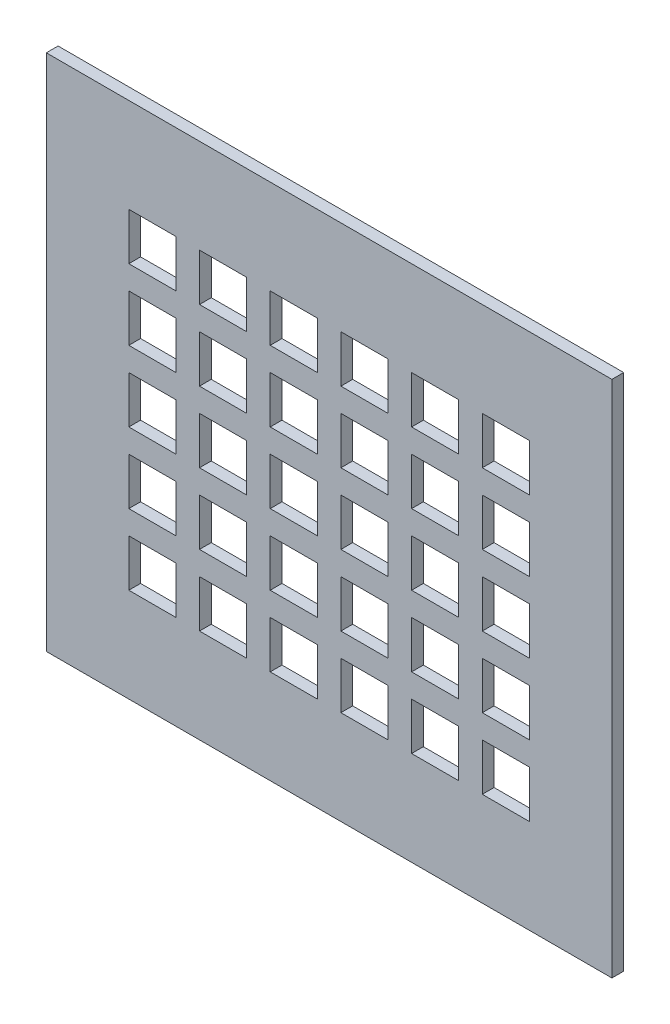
ISO-10303-21;
HEADER;
FILE_DESCRIPTION(('STEP AP214'),'2;1');
FILE_NAME('part.step','',(''),(''),'','','');
FILE_SCHEMA(('AUTOMOTIVE_DESIGN { 1 0 10303 214 1 1 1 1 }'));
ENDSEC;
DATA;
#1=APPLICATION_CONTEXT('core data for automotive mechanical design processes');
#2=APPLICATION_PROTOCOL_DEFINITION('international standard','automotive_design',2000,#1);
#3=PRODUCT_CONTEXT('',#1,'mechanical');
#4=PRODUCT('Part','Part','',(#3));
#5=PRODUCT_RELATED_PRODUCT_CATEGORY('part','',(#4));
#6=PRODUCT_DEFINITION_FORMATION('','',#4);
#7=PRODUCT_DEFINITION_CONTEXT('part definition',#1,'design');
#8=PRODUCT_DEFINITION('design','',#6,#7);
#9=PRODUCT_DEFINITION_SHAPE('','',#8);
#10=(LENGTH_UNIT() NAMED_UNIT(*) SI_UNIT(.MILLI.,.METRE.));
#11=(NAMED_UNIT(*) PLANE_ANGLE_UNIT() SI_UNIT($,.RADIAN.));
#12=(NAMED_UNIT(*) SI_UNIT($,.STERADIAN.) SOLID_ANGLE_UNIT());
#13=UNCERTAINTY_MEASURE_WITH_UNIT(LENGTH_MEASURE(1.E-05),#10,'distance_accuracy_value','');
#14=(GEOMETRIC_REPRESENTATION_CONTEXT(3) GLOBAL_UNCERTAINTY_ASSIGNED_CONTEXT((#13)) GLOBAL_UNIT_ASSIGNED_CONTEXT((#10,
#11,#12)) REPRESENTATION_CONTEXT('',''));
#15=CARTESIAN_POINT('',(0.,0.,0.));
#16=DIRECTION('',(0.,0.,1.));
#17=DIRECTION('',(1.,0.,0.));
#18=AXIS2_PLACEMENT_3D('',#15,#16,#17);
#19=CARTESIAN_POINT('',(76.2,69.85,3.175));
#20=DIRECTION('',(-1.,0.,0.));
#21=DIRECTION('',(0.,-1.,0.));
#22=AXIS2_PLACEMENT_3D('',#19,#20,#21);
#23=PLANE('',#22);
#24=DIRECTION('',(0.,1.,0.));
#25=VECTOR('',#24,1.);
#26=CARTESIAN_POINT('',(76.2,69.85,0.));
#27=LINE('',#26,#25);
#28=CARTESIAN_POINT('',(76.2,-69.85,0.));
#29=VERTEX_POINT('',#28);
#30=CARTESIAN_POINT('',(76.2,69.85,0.));
#31=VERTEX_POINT('',#30);
#32=EDGE_CURVE('E1753',#29,#31,#27,.T.);
#33=ORIENTED_EDGE('',*,*,#32,.T.);
#34=DIRECTION('',(0.,0.,-1.));
#35=VECTOR('',#34,1.);
#36=CARTESIAN_POINT('',(76.2,69.85,3.175));
#37=LINE('',#36,#35);
#38=CARTESIAN_POINT('',(76.2,69.85,3.175));
#39=VERTEX_POINT('',#38);
#40=EDGE_CURVE('E11',#39,#31,#37,.T.);
#41=ORIENTED_EDGE('',*,*,#40,.F.);
#42=DIRECTION('',(0.,1.,0.));
#43=VECTOR('',#42,1.);
#44=CARTESIAN_POINT('',(76.2,69.85,3.175));
#45=LINE('',#44,#43);
#46=CARTESIAN_POINT('',(76.2,-69.85,3.175));
#47=VERTEX_POINT('',#46);
#48=EDGE_CURVE('E1760',#47,#39,#45,.T.);
#49=ORIENTED_EDGE('',*,*,#48,.F.);
#50=DIRECTION('',(0.,0.,-1.));
#51=VECTOR('',#50,1.);
#52=CARTESIAN_POINT('',(76.2,-69.85,3.175));
#53=LINE('',#52,#51);
#54=EDGE_CURVE('E1770',#47,#29,#53,.T.);
#55=ORIENTED_EDGE('',*,*,#54,.T.);
#56=EDGE_LOOP('',(#33,#41,#49,#55));
#57=FACE_BOUND('',#56,.T.);
#58=ADVANCED_FACE('F32',(#57),#23,.F.);
#59=CARTESIAN_POINT('',(-76.2,69.85,3.175));
#60=DIRECTION('',(0.,-1.,0.));
#61=DIRECTION('',(0.,0.,-1.));
#62=AXIS2_PLACEMENT_3D('',#59,#60,#61);
#63=PLANE('',#62);
#64=DIRECTION('',(-1.,0.,0.));
#65=VECTOR('',#64,1.);
#66=CARTESIAN_POINT('',(-76.2,69.85,0.));
#67=LINE('',#66,#65);
#68=CARTESIAN_POINT('',(-76.2,69.85,0.));
#69=VERTEX_POINT('',#68);
#70=EDGE_CURVE('E1773',#31,#69,#67,.T.);
#71=ORIENTED_EDGE('',*,*,#70,.T.);
#72=DIRECTION('',(0.,0.,-1.));
#73=VECTOR('',#72,1.);
#74=CARTESIAN_POINT('',(-76.2,69.85,3.175));
#75=LINE('',#74,#73);
#76=CARTESIAN_POINT('',(-76.2,69.85,3.175));
#77=VERTEX_POINT('',#76);
#78=EDGE_CURVE('E39',#77,#69,#75,.T.);
#79=ORIENTED_EDGE('',*,*,#78,.F.);
#80=DIRECTION('',(-1.,0.,0.));
#81=VECTOR('',#80,1.);
#82=CARTESIAN_POINT('',(-76.2,69.85,3.175));
#83=LINE('',#82,#81);
#84=EDGE_CURVE('E1763',#39,#77,#83,.T.);
#85=ORIENTED_EDGE('',*,*,#84,.F.);
#86=ORIENTED_EDGE('',*,*,#40,.T.);
#87=EDGE_LOOP('',(#71,#79,#85,#86));
#88=FACE_BOUND('',#87,.T.);
#89=ADVANCED_FACE('F1802',(#88),#63,.F.);
#90=CARTESIAN_POINT('',(-76.2,69.85,3.175));
#91=DIRECTION('',(1.,0.,0.));
#92=DIRECTION('',(0.,1.,0.));
#93=AXIS2_PLACEMENT_3D('',#90,#91,#92);
#94=PLANE('',#93);
#95=DIRECTION('',(0.,-1.,0.));
#96=VECTOR('',#95,1.);
#97=CARTESIAN_POINT('',(-76.2,69.85,0.));
#98=LINE('',#97,#96);
#99=CARTESIAN_POINT('',(-76.2,-69.85,0.));
#100=VERTEX_POINT('',#99);
#101=EDGE_CURVE('E1775',#69,#100,#98,.T.);
#102=ORIENTED_EDGE('',*,*,#101,.T.);
#103=DIRECTION('',(0.,0.,-1.));
#104=VECTOR('',#103,1.);
#105=CARTESIAN_POINT('',(-76.2,-69.85,3.175));
#106=LINE('',#105,#104);
#107=CARTESIAN_POINT('',(-76.2,-69.85,3.175));
#108=VERTEX_POINT('',#107);
#109=EDGE_CURVE('E1780',#108,#100,#106,.T.);
#110=ORIENTED_EDGE('',*,*,#109,.F.);
#111=DIRECTION('',(0.,-1.,0.));
#112=VECTOR('',#111,1.);
#113=CARTESIAN_POINT('',(-76.2,69.85,3.175));
#114=LINE('',#113,#112);
#115=EDGE_CURVE('E1766',#77,#108,#114,.T.);
#116=ORIENTED_EDGE('',*,*,#115,.F.);
#117=ORIENTED_EDGE('',*,*,#78,.T.);
#118=EDGE_LOOP('',(#102,#110,#116,#117));
#119=FACE_BOUND('',#118,.T.);
#120=ADVANCED_FACE('F1787',(#119),#94,.F.);
#121=CARTESIAN_POINT('',(-76.2,-69.85,3.175));
#122=DIRECTION('',(0.,1.,0.));
#123=DIRECTION('',(0.,0.,1.));
#124=AXIS2_PLACEMENT_3D('',#121,#122,#123);
#125=PLANE('',#124);
#126=DIRECTION('',(1.,0.,0.));
#127=VECTOR('',#126,1.);
#128=CARTESIAN_POINT('',(-76.2,-69.85,0.));
#129=LINE('',#128,#127);
#130=EDGE_CURVE('E1764',#100,#29,#129,.T.);
#131=ORIENTED_EDGE('',*,*,#130,.T.);
#132=ORIENTED_EDGE('',*,*,#54,.F.);
#133=DIRECTION('',(1.,0.,0.));
#134=VECTOR('',#133,1.);
#135=CARTESIAN_POINT('',(-76.2,-69.85,3.175));
#136=LINE('',#135,#134);
#137=EDGE_CURVE('E1768',#108,#47,#136,.T.);
#138=ORIENTED_EDGE('',*,*,#137,.F.);
#139=ORIENTED_EDGE('',*,*,#109,.T.);
#140=EDGE_LOOP('',(#131,#132,#138,#139));
#141=FACE_BOUND('',#140,.T.);
#142=ADVANCED_FACE('F1795',(#141),#125,.F.);
#143=CARTESIAN_POINT('',(0.,0.,3.175));
#144=DIRECTION('',(0.,0.,1.));
#145=DIRECTION('',(1.,0.,0.));
#146=AXIS2_PLACEMENT_3D('',#143,#144,#145);
#147=PLANE('',#146);
#148=DIRECTION('',(0.,1.,0.));
#149=VECTOR('',#148,1.);
#150=CARTESIAN_POINT('',(15.8749999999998,25.4000000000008,3.175));
#151=LINE('',#150,#149);
#152=CARTESIAN_POINT('',(15.8749999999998,12.7000000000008,3.175));
#153=VERTEX_POINT('',#152);
#154=CARTESIAN_POINT('',(15.8749999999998,25.4000000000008,3.175));
#155=VERTEX_POINT('',#154);
#156=EDGE_CURVE('E46',#153,#155,#151,.T.);
#157=ORIENTED_EDGE('',*,*,#156,.F.);
#158=DIRECTION('',(1.,0.,0.));
#159=VECTOR('',#158,1.);
#160=CARTESIAN_POINT('',(3.17499999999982,12.7000000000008,3.175));
#161=LINE('',#160,#159);
#162=CARTESIAN_POINT('',(3.17499999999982,12.7000000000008,3.175));
#163=VERTEX_POINT('',#162);
#164=EDGE_CURVE('E1127',#163,#153,#161,.T.);
#165=ORIENTED_EDGE('',*,*,#164,.F.);
#166=DIRECTION('',(0.,-1.,0.));
#167=VECTOR('',#166,1.);
#168=CARTESIAN_POINT('',(3.17499999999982,25.4000000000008,3.175));
#169=LINE('',#168,#167);
#170=CARTESIAN_POINT('',(3.17499999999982,25.4000000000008,3.175));
#171=VERTEX_POINT('',#170);
#172=EDGE_CURVE('E1142',#171,#163,#169,.T.);
#173=ORIENTED_EDGE('',*,*,#172,.F.);
#174=DIRECTION('',(-1.,0.,0.));
#175=VECTOR('',#174,1.);
#176=CARTESIAN_POINT('',(3.17499999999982,25.4000000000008,3.175));
#177=LINE('',#176,#175);
#178=EDGE_CURVE('E1138',#155,#171,#177,.T.);
#179=ORIENTED_EDGE('',*,*,#178,.F.);
#180=EDGE_LOOP('',(#157,#165,#173,#179));
#181=FACE_BOUND('',#180,.T.);
#182=DIRECTION('',(0.,1.,0.));
#183=VECTOR('',#182,1.);
#184=CARTESIAN_POINT('',(34.9249999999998,25.400000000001,3.175));
#185=LINE('',#184,#183);
#186=CARTESIAN_POINT('',(34.9249999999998,12.7000000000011,3.175));
#187=VERTEX_POINT('',#186);
#188=CARTESIAN_POINT('',(34.9249999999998,25.400000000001,3.175));
#189=VERTEX_POINT('',#188);
#190=EDGE_CURVE('E54',#187,#189,#185,.T.);
#191=ORIENTED_EDGE('',*,*,#190,.F.);
#192=DIRECTION('',(1.,0.,0.));
#193=VECTOR('',#192,1.);
#194=CARTESIAN_POINT('',(22.2249999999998,12.700000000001,3.175));
#195=LINE('',#194,#193);
#196=CARTESIAN_POINT('',(22.2249999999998,12.700000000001,3.175));
#197=VERTEX_POINT('',#196);
#198=EDGE_CURVE('E1159',#197,#187,#195,.T.);
#199=ORIENTED_EDGE('',*,*,#198,.F.);
#200=DIRECTION('',(0.,-1.,0.));
#201=VECTOR('',#200,1.);
#202=CARTESIAN_POINT('',(22.2249999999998,25.400000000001,3.175));
#203=LINE('',#202,#201);
#204=CARTESIAN_POINT('',(22.2249999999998,25.400000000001,3.175));
#205=VERTEX_POINT('',#204);
#206=EDGE_CURVE('E1173',#205,#197,#203,.T.);
#207=ORIENTED_EDGE('',*,*,#206,.F.);
#208=DIRECTION('',(-1.,0.,0.));
#209=VECTOR('',#208,1.);
#210=CARTESIAN_POINT('',(22.2249999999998,25.400000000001,3.175));
#211=LINE('',#210,#209);
#212=EDGE_CURVE('E1170',#189,#205,#211,.T.);
#213=ORIENTED_EDGE('',*,*,#212,.F.);
#214=EDGE_LOOP('',(#191,#199,#207,#213));
#215=FACE_BOUND('',#214,.T.);
#216=DIRECTION('',(0.,1.,0.));
#217=VECTOR('',#216,1.);
#218=CARTESIAN_POINT('',(53.9749999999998,25.4000000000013,3.175));
#219=LINE('',#218,#217);
#220=CARTESIAN_POINT('',(53.9749999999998,12.7000000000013,3.175));
#221=VERTEX_POINT('',#220);
#222=CARTESIAN_POINT('',(53.9749999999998,25.4000000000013,3.175));
#223=VERTEX_POINT('',#222);
#224=EDGE_CURVE('E1074',#221,#223,#219,.T.);
#225=ORIENTED_EDGE('',*,*,#224,.F.);
#226=DIRECTION('',(1.,0.,0.));
#227=VECTOR('',#226,1.);
#228=CARTESIAN_POINT('',(41.2749999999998,12.7000000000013,3.175));
#229=LINE('',#228,#227);
#230=CARTESIAN_POINT('',(41.2749999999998,12.7000000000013,3.175));
#231=VERTEX_POINT('',#230);
#232=EDGE_CURVE('E1064',#231,#221,#229,.T.);
#233=ORIENTED_EDGE('',*,*,#232,.F.);
#234=DIRECTION('',(0.,-1.,0.));
#235=VECTOR('',#234,1.);
#236=CARTESIAN_POINT('',(41.2749999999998,25.4000000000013,3.175));
#237=LINE('',#236,#235);
#238=CARTESIAN_POINT('',(41.2749999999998,25.4000000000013,3.175));
#239=VERTEX_POINT('',#238);
#240=EDGE_CURVE('E1080',#239,#231,#237,.T.);
#241=ORIENTED_EDGE('',*,*,#240,.F.);
#242=DIRECTION('',(-1.,0.,0.));
#243=VECTOR('',#242,1.);
#244=CARTESIAN_POINT('',(41.2749999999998,25.4000000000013,3.175));
#245=LINE('',#244,#243);
#246=EDGE_CURVE('E1076',#223,#239,#245,.T.);
#247=ORIENTED_EDGE('',*,*,#246,.F.);
#248=EDGE_LOOP('',(#225,#233,#241,#247));
#249=FACE_BOUND('',#248,.T.);
#250=DIRECTION('',(0.,1.,0.));
#251=VECTOR('',#250,1.);
#252=CARTESIAN_POINT('',(-22.2250000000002,44.4500000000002,3.175));
#253=LINE('',#252,#251);
#254=CARTESIAN_POINT('',(-22.2250000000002,31.7500000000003,3.175));
#255=VERTEX_POINT('',#254);
#256=CARTESIAN_POINT('',(-22.2250000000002,44.4500000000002,3.175));
#257=VERTEX_POINT('',#256);
#258=EDGE_CURVE('E833',#255,#257,#253,.T.);
#259=ORIENTED_EDGE('',*,*,#258,.F.);
#260=DIRECTION('',(1.,0.,0.));
#261=VECTOR('',#260,1.);
#262=CARTESIAN_POINT('',(-34.9250000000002,31.7500000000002,3.175));
#263=LINE('',#262,#261);
#264=CARTESIAN_POINT('',(-34.9250000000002,31.7500000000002,3.175));
#265=VERTEX_POINT('',#264);
#266=EDGE_CURVE('E1097',#265,#255,#263,.T.);
#267=ORIENTED_EDGE('',*,*,#266,.F.);
#268=DIRECTION('',(0.,-1.,0.));
#269=VECTOR('',#268,1.);
#270=CARTESIAN_POINT('',(-34.9250000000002,44.4500000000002,3.175));
#271=LINE('',#270,#269);
#272=CARTESIAN_POINT('',(-34.9250000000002,44.4500000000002,3.175));
#273=VERTEX_POINT('',#272);
#274=EDGE_CURVE('E1111',#273,#265,#271,.T.);
#275=ORIENTED_EDGE('',*,*,#274,.F.);
#276=DIRECTION('',(-1.,0.,0.));
#277=VECTOR('',#276,1.);
#278=CARTESIAN_POINT('',(-34.9250000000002,44.4500000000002,3.175));
#279=LINE('',#278,#277);
#280=EDGE_CURVE('E1108',#257,#273,#279,.T.);
#281=ORIENTED_EDGE('',*,*,#280,.F.);
#282=EDGE_LOOP('',(#259,#267,#275,#281));
#283=FACE_BOUND('',#282,.T.);
#284=DIRECTION('',(0.,1.,0.));
#285=VECTOR('',#284,1.);
#286=CARTESIAN_POINT('',(-3.17500000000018,25.4000000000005,3.175));
#287=LINE('',#286,#285);
#288=CARTESIAN_POINT('',(-3.17500000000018,12.7000000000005,3.175));
#289=VERTEX_POINT('',#288);
#290=CARTESIAN_POINT('',(-3.17500000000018,25.4000000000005,3.175));
#291=VERTEX_POINT('',#290);
#292=EDGE_CURVE('E1149',#289,#291,#287,.T.);
#293=ORIENTED_EDGE('',*,*,#292,.F.);
#294=DIRECTION('',(1.,0.,0.));
#295=VECTOR('',#294,1.);
#296=CARTESIAN_POINT('',(-15.8750000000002,12.7000000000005,3.175));
#297=LINE('',#296,#295);
#298=CARTESIAN_POINT('',(-15.8750000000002,12.7000000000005,3.175));
#299=VERTEX_POINT('',#298);
#300=EDGE_CURVE('E1254',#299,#289,#297,.T.);
#301=ORIENTED_EDGE('',*,*,#300,.F.);
#302=DIRECTION('',(0.,-1.,0.));
#303=VECTOR('',#302,1.);
#304=CARTESIAN_POINT('',(-15.8750000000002,25.4000000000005,3.175));
#305=LINE('',#304,#303);
#306=CARTESIAN_POINT('',(-15.8750000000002,25.4000000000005,3.175));
#307=VERTEX_POINT('',#306);
#308=EDGE_CURVE('E1268',#307,#299,#305,.T.);
#309=ORIENTED_EDGE('',*,*,#308,.F.);
#310=DIRECTION('',(-1.,0.,0.));
#311=VECTOR('',#310,1.);
#312=CARTESIAN_POINT('',(-15.8750000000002,25.4000000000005,3.175));
#313=LINE('',#312,#311);
#314=EDGE_CURVE('E1265',#291,#307,#313,.T.);
#315=ORIENTED_EDGE('',*,*,#314,.F.);
#316=EDGE_LOOP('',(#293,#301,#309,#315));
#317=FACE_BOUND('',#316,.T.);
#318=DIRECTION('',(0.,1.,0.));
#319=VECTOR('',#318,1.);
#320=CARTESIAN_POINT('',(-22.2250000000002,25.4000000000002,3.175));
#321=LINE('',#320,#319);
#322=CARTESIAN_POINT('',(-22.2250000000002,12.7000000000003,3.175));
#323=VERTEX_POINT('',#322);
#324=CARTESIAN_POINT('',(-22.2250000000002,25.4000000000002,3.175));
#325=VERTEX_POINT('',#324);
#326=EDGE_CURVE('E1232',#323,#325,#321,.T.);
#327=ORIENTED_EDGE('',*,*,#326,.F.);
#328=DIRECTION('',(1.,0.,0.));
#329=VECTOR('',#328,1.);
#330=CARTESIAN_POINT('',(-34.9250000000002,12.7000000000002,3.175));
#331=LINE('',#330,#329);
#332=CARTESIAN_POINT('',(-34.9250000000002,12.7000000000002,3.175));
#333=VERTEX_POINT('',#332);
#334=EDGE_CURVE('E1222',#333,#323,#331,.T.);
#335=ORIENTED_EDGE('',*,*,#334,.F.);
#336=DIRECTION('',(0.,-1.,0.));
#337=VECTOR('',#336,1.);
#338=CARTESIAN_POINT('',(-34.9250000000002,25.4000000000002,3.175));
#339=LINE('',#338,#337);
#340=CARTESIAN_POINT('',(-34.9250000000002,25.4000000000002,3.175));
#341=VERTEX_POINT('',#340);
#342=EDGE_CURVE('E1238',#341,#333,#339,.T.);
#343=ORIENTED_EDGE('',*,*,#342,.F.);
#344=DIRECTION('',(-1.,0.,0.));
#345=VECTOR('',#344,1.);
#346=CARTESIAN_POINT('',(-34.9250000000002,25.4000000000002,3.175));
#347=LINE('',#346,#345);
#348=EDGE_CURVE('E1234',#325,#341,#347,.T.);
#349=ORIENTED_EDGE('',*,*,#348,.F.);
#350=EDGE_LOOP('',(#327,#335,#343,#349));
#351=FACE_BOUND('',#350,.T.);
#352=DIRECTION('',(0.,1.,0.));
#353=VECTOR('',#352,1.);
#354=CARTESIAN_POINT('',(53.9749999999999,6.35000000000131,3.175));
#355=LINE('',#354,#353);
#356=CARTESIAN_POINT('',(53.9749999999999,-6.34999999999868,3.175));
#357=VERTEX_POINT('',#356);
#358=CARTESIAN_POINT('',(53.9749999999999,6.35000000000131,3.175));
#359=VERTEX_POINT('',#358);
#360=EDGE_CURVE('E1198',#357,#359,#355,.T.);
#361=ORIENTED_EDGE('',*,*,#360,.F.);
#362=DIRECTION('',(1.,0.,0.));
#363=VECTOR('',#362,1.);
#364=CARTESIAN_POINT('',(41.2749999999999,-6.34999999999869,3.175));
#365=LINE('',#364,#363);
#366=CARTESIAN_POINT('',(41.2749999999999,-6.34999999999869,3.175));
#367=VERTEX_POINT('',#366);
#368=EDGE_CURVE('E1188',#367,#357,#365,.T.);
#369=ORIENTED_EDGE('',*,*,#368,.F.);
#370=DIRECTION('',(0.,-1.,0.));
#371=VECTOR('',#370,1.);
#372=CARTESIAN_POINT('',(41.2749999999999,6.35000000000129,3.175));
#373=LINE('',#372,#371);
#374=CARTESIAN_POINT('',(41.2749999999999,6.35000000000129,3.175));
#375=VERTEX_POINT('',#374);
#376=EDGE_CURVE('E1204',#375,#367,#373,.T.);
#377=ORIENTED_EDGE('',*,*,#376,.F.);
#378=DIRECTION('',(-1.,0.,0.));
#379=VECTOR('',#378,1.);
#380=CARTESIAN_POINT('',(41.2749999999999,6.35000000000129,3.175));
#381=LINE('',#380,#379);
#382=EDGE_CURVE('E1200',#359,#375,#381,.T.);
#383=ORIENTED_EDGE('',*,*,#382,.F.);
#384=EDGE_LOOP('',(#361,#369,#377,#383));
#385=FACE_BOUND('',#384,.T.);
#386=DIRECTION('',(0.,1.,0.));
#387=VECTOR('',#386,1.);
#388=CARTESIAN_POINT('',(-3.17500000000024,44.4500000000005,3.175));
#389=LINE('',#388,#387);
#390=CARTESIAN_POINT('',(-3.17500000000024,31.7500000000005,3.175));
#391=VERTEX_POINT('',#390);
#392=CARTESIAN_POINT('',(-3.17500000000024,44.4500000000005,3.175));
#393=VERTEX_POINT('',#392);
#394=EDGE_CURVE('E799',#391,#393,#389,.T.);
#395=ORIENTED_EDGE('',*,*,#394,.F.);
#396=DIRECTION('',(1.,0.,0.));
#397=VECTOR('',#396,1.);
#398=CARTESIAN_POINT('',(-15.8750000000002,31.7500000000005,3.175));
#399=LINE('',#398,#397);
#400=CARTESIAN_POINT('',(-15.8750000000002,31.7500000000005,3.175));
#401=VERTEX_POINT('',#400);
#402=EDGE_CURVE('E817',#401,#391,#399,.T.);
#403=ORIENTED_EDGE('',*,*,#402,.F.);
#404=DIRECTION('',(0.,-1.,0.));
#405=VECTOR('',#404,1.);
#406=CARTESIAN_POINT('',(-15.8750000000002,44.4500000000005,3.175));
#407=LINE('',#406,#405);
#408=CARTESIAN_POINT('',(-15.8750000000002,44.4500000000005,3.175));
#409=VERTEX_POINT('',#408);
#410=EDGE_CURVE('E820',#409,#401,#407,.T.);
#411=ORIENTED_EDGE('',*,*,#410,.F.);
#412=DIRECTION('',(-1.,0.,0.));
#413=VECTOR('',#412,1.);
#414=CARTESIAN_POINT('',(-15.8750000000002,44.4500000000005,3.175));
#415=LINE('',#414,#413);
#416=EDGE_CURVE('E826',#393,#409,#415,.T.);
#417=ORIENTED_EDGE('',*,*,#416,.F.);
#418=EDGE_LOOP('',(#395,#403,#411,#417));
#419=FACE_BOUND('',#418,.T.);
#420=DIRECTION('',(0.,1.,0.));
#421=VECTOR('',#420,1.);
#422=CARTESIAN_POINT('',(15.8749999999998,44.4500000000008,3.175));
#423=LINE('',#422,#421);
#424=CARTESIAN_POINT('',(15.8749999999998,31.7500000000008,3.175));
#425=VERTEX_POINT('',#424);
#426=CARTESIAN_POINT('',(15.8749999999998,44.4500000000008,3.175));
#427=VERTEX_POINT('',#426);
#428=EDGE_CURVE('E851',#425,#427,#423,.T.);
#429=ORIENTED_EDGE('',*,*,#428,.F.);
#430=DIRECTION('',(1.,0.,0.));
#431=VECTOR('',#430,1.);
#432=CARTESIAN_POINT('',(3.17499999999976,31.7500000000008,3.175));
#433=LINE('',#432,#431);
#434=CARTESIAN_POINT('',(3.17499999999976,31.7500000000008,3.175));
#435=VERTEX_POINT('',#434);
#436=EDGE_CURVE('E841',#435,#425,#433,.T.);
#437=ORIENTED_EDGE('',*,*,#436,.F.);
#438=DIRECTION('',(0.,-1.,0.));
#439=VECTOR('',#438,1.);
#440=CARTESIAN_POINT('',(3.17499999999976,44.4500000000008,3.175));
#441=LINE('',#440,#439);
#442=CARTESIAN_POINT('',(3.17499999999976,44.4500000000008,3.175));
#443=VERTEX_POINT('',#442);
#444=EDGE_CURVE('E857',#443,#435,#441,.T.);
#445=ORIENTED_EDGE('',*,*,#444,.F.);
#446=DIRECTION('',(-1.,0.,0.));
#447=VECTOR('',#446,1.);
#448=CARTESIAN_POINT('',(3.17499999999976,44.4500000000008,3.175));
#449=LINE('',#448,#447);
#450=EDGE_CURVE('E853',#427,#443,#449,.T.);
#451=ORIENTED_EDGE('',*,*,#450,.F.);
#452=EDGE_LOOP('',(#429,#437,#445,#451));
#453=FACE_BOUND('',#452,.T.);
#454=DIRECTION('',(0.,1.,0.));
#455=VECTOR('',#454,1.);
#456=CARTESIAN_POINT('',(34.9249999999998,44.450000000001,3.175));
#457=LINE('',#456,#455);
#458=CARTESIAN_POINT('',(34.9249999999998,31.7500000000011,3.175));
#459=VERTEX_POINT('',#458);
#460=CARTESIAN_POINT('',(34.9249999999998,44.450000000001,3.175));
#461=VERTEX_POINT('',#460);
#462=EDGE_CURVE('E883',#459,#461,#457,.T.);
#463=ORIENTED_EDGE('',*,*,#462,.F.);
#464=DIRECTION('',(1.,0.,0.));
#465=VECTOR('',#464,1.);
#466=CARTESIAN_POINT('',(22.2249999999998,31.750000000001,3.175));
#467=LINE('',#466,#465);
#468=CARTESIAN_POINT('',(22.2249999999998,31.750000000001,3.175));
#469=VERTEX_POINT('',#468);
#470=EDGE_CURVE('E873',#469,#459,#467,.T.);
#471=ORIENTED_EDGE('',*,*,#470,.F.);
#472=DIRECTION('',(0.,-1.,0.));
#473=VECTOR('',#472,1.);
#474=CARTESIAN_POINT('',(22.2249999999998,44.450000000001,3.175));
#475=LINE('',#474,#473);
#476=CARTESIAN_POINT('',(22.2249999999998,44.450000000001,3.175));
#477=VERTEX_POINT('',#476);
#478=EDGE_CURVE('E889',#477,#469,#475,.T.);
#479=ORIENTED_EDGE('',*,*,#478,.F.);
#480=DIRECTION('',(-1.,0.,0.));
#481=VECTOR('',#480,1.);
#482=CARTESIAN_POINT('',(22.2249999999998,44.450000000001,3.175));
#483=LINE('',#482,#481);
#484=EDGE_CURVE('E885',#461,#477,#483,.T.);
#485=ORIENTED_EDGE('',*,*,#484,.F.);
#486=EDGE_LOOP('',(#463,#471,#479,#485));
#487=FACE_BOUND('',#486,.T.);
#488=DIRECTION('',(0.,1.,0.));
#489=VECTOR('',#488,1.);
#490=CARTESIAN_POINT('',(53.9749999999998,44.4500000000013,3.175));
#491=LINE('',#490,#489);
#492=CARTESIAN_POINT('',(53.9749999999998,31.7500000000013,3.175));
#493=VERTEX_POINT('',#492);
#494=CARTESIAN_POINT('',(53.9749999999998,44.4500000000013,3.175));
#495=VERTEX_POINT('',#494);
#496=EDGE_CURVE('E915',#493,#495,#491,.T.);
#497=ORIENTED_EDGE('',*,*,#496,.F.);
#498=DIRECTION('',(1.,0.,0.));
#499=VECTOR('',#498,1.);
#500=CARTESIAN_POINT('',(41.2749999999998,31.7500000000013,3.175));
#501=LINE('',#500,#499);
#502=CARTESIAN_POINT('',(41.2749999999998,31.7500000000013,3.175));
#503=VERTEX_POINT('',#502);
#504=EDGE_CURVE('E905',#503,#493,#501,.T.);
#505=ORIENTED_EDGE('',*,*,#504,.F.);
#506=DIRECTION('',(0.,-1.,0.));
#507=VECTOR('',#506,1.);
#508=CARTESIAN_POINT('',(41.2749999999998,44.4500000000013,3.175));
#509=LINE('',#508,#507);
#510=CARTESIAN_POINT('',(41.2749999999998,44.4500000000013,3.175));
#511=VERTEX_POINT('',#510);
#512=EDGE_CURVE('E921',#511,#503,#509,.T.);
#513=ORIENTED_EDGE('',*,*,#512,.F.);
#514=DIRECTION('',(-1.,0.,0.));
#515=VECTOR('',#514,1.);
#516=CARTESIAN_POINT('',(41.2749999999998,44.4500000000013,3.175));
#517=LINE('',#516,#515);
#518=EDGE_CURVE('E917',#495,#511,#517,.T.);
#519=ORIENTED_EDGE('',*,*,#518,.F.);
#520=EDGE_LOOP('',(#497,#505,#513,#519));
#521=FACE_BOUND('',#520,.T.);
#522=DIRECTION('',(0.,1.,0.));
#523=VECTOR('',#522,1.);
#524=CARTESIAN_POINT('',(-41.275,-12.7,3.175));
#525=LINE('',#524,#523);
#526=CARTESIAN_POINT('',(-41.275,-25.4,3.175));
#527=VERTEX_POINT('',#526);
#528=CARTESIAN_POINT('',(-41.275,-12.7,3.175));
#529=VERTEX_POINT('',#528);
#530=EDGE_CURVE('E947',#527,#529,#525,.T.);
#531=ORIENTED_EDGE('',*,*,#530,.F.);
#532=DIRECTION('',(1.,0.,0.));
#533=VECTOR('',#532,1.);
#534=CARTESIAN_POINT('',(-53.9750000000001,-25.4,3.175));
#535=LINE('',#534,#533);
#536=CARTESIAN_POINT('',(-53.9750000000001,-25.4,3.175));
#537=VERTEX_POINT('',#536);
#538=EDGE_CURVE('E937',#537,#527,#535,.T.);
#539=ORIENTED_EDGE('',*,*,#538,.F.);
#540=DIRECTION('',(0.,-1.,0.));
#541=VECTOR('',#540,1.);
#542=CARTESIAN_POINT('',(-53.9750000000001,-12.7,3.175));
#543=LINE('',#542,#541);
#544=CARTESIAN_POINT('',(-53.9750000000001,-12.7,3.175));
#545=VERTEX_POINT('',#544);
#546=EDGE_CURVE('E953',#545,#537,#543,.T.);
#547=ORIENTED_EDGE('',*,*,#546,.F.);
#548=DIRECTION('',(-1.,0.,0.));
#549=VECTOR('',#548,1.);
#550=CARTESIAN_POINT('',(-53.9750000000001,-12.7,3.175));
#551=LINE('',#550,#549);
#552=EDGE_CURVE('E949',#529,#545,#551,.T.);
#553=ORIENTED_EDGE('',*,*,#552,.F.);
#554=EDGE_LOOP('',(#531,#539,#547,#553));
#555=FACE_BOUND('',#554,.T.);
#556=DIRECTION('',(0.,1.,0.));
#557=VECTOR('',#556,1.);
#558=CARTESIAN_POINT('',(-41.2750000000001,6.34999999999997,3.175));
#559=LINE('',#558,#557);
#560=CARTESIAN_POINT('',(-41.2750000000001,-6.35000000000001,3.175));
#561=VERTEX_POINT('',#560);
#562=CARTESIAN_POINT('',(-41.2750000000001,6.34999999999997,3.175));
#563=VERTEX_POINT('',#562);
#564=EDGE_CURVE('E979',#561,#563,#559,.T.);
#565=ORIENTED_EDGE('',*,*,#564,.F.);
#566=DIRECTION('',(1.,0.,0.));
#567=VECTOR('',#566,1.);
#568=CARTESIAN_POINT('',(-53.9750000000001,-6.35000000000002,3.175));
#569=LINE('',#568,#567);
#570=CARTESIAN_POINT('',(-53.9750000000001,-6.35000000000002,3.175));
#571=VERTEX_POINT('',#570);
#572=EDGE_CURVE('E969',#571,#561,#569,.T.);
#573=ORIENTED_EDGE('',*,*,#572,.F.);
#574=DIRECTION('',(0.,-1.,0.));
#575=VECTOR('',#574,1.);
#576=CARTESIAN_POINT('',(-53.9750000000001,6.34999999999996,3.175));
#577=LINE('',#576,#575);
#578=CARTESIAN_POINT('',(-53.9750000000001,6.34999999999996,3.175));
#579=VERTEX_POINT('',#578);
#580=EDGE_CURVE('E985',#579,#571,#577,.T.);
#581=ORIENTED_EDGE('',*,*,#580,.F.);
#582=DIRECTION('',(-1.,0.,0.));
#583=VECTOR('',#582,1.);
#584=CARTESIAN_POINT('',(-53.9750000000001,6.34999999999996,3.175));
#585=LINE('',#584,#583);
#586=EDGE_CURVE('E981',#563,#579,#585,.T.);
#587=ORIENTED_EDGE('',*,*,#586,.F.);
#588=EDGE_LOOP('',(#565,#573,#581,#587));
#589=FACE_BOUND('',#588,.T.);
#590=DIRECTION('',(0.,1.,0.));
#591=VECTOR('',#590,1.);
#592=CARTESIAN_POINT('',(-41.2750000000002,25.4,3.175));
#593=LINE('',#592,#591);
#594=CARTESIAN_POINT('',(-41.2750000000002,12.7,3.175));
#595=VERTEX_POINT('',#594);
#596=CARTESIAN_POINT('',(-41.2750000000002,25.4,3.175));
#597=VERTEX_POINT('',#596);
#598=EDGE_CURVE('E1011',#595,#597,#593,.T.);
#599=ORIENTED_EDGE('',*,*,#598,.F.);
#600=DIRECTION('',(1.,0.,0.));
#601=VECTOR('',#600,1.);
#602=CARTESIAN_POINT('',(-53.9750000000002,12.7,3.175));
#603=LINE('',#602,#601);
#604=CARTESIAN_POINT('',(-53.9750000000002,12.7,3.175));
#605=VERTEX_POINT('',#604);
#606=EDGE_CURVE('E1001',#605,#595,#603,.T.);
#607=ORIENTED_EDGE('',*,*,#606,.F.);
#608=DIRECTION('',(0.,-1.,0.));
#609=VECTOR('',#608,1.);
#610=CARTESIAN_POINT('',(-53.9750000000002,25.4,3.175));
#611=LINE('',#610,#609);
#612=CARTESIAN_POINT('',(-53.9750000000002,25.4,3.175));
#613=VERTEX_POINT('',#612);
#614=EDGE_CURVE('E1017',#613,#605,#611,.T.);
#615=ORIENTED_EDGE('',*,*,#614,.F.);
#616=DIRECTION('',(-1.,0.,0.));
#617=VECTOR('',#616,1.);
#618=CARTESIAN_POINT('',(-53.9750000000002,25.4,3.175));
#619=LINE('',#618,#617);
#620=EDGE_CURVE('E1013',#597,#613,#619,.T.);
#621=ORIENTED_EDGE('',*,*,#620,.F.);
#622=EDGE_LOOP('',(#599,#607,#615,#621));
#623=FACE_BOUND('',#622,.T.);
#624=DIRECTION('',(0.,1.,0.));
#625=VECTOR('',#624,1.);
#626=CARTESIAN_POINT('',(-41.2750000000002,44.45,3.175));
#627=LINE('',#626,#625);
#628=CARTESIAN_POINT('',(-41.2750000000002,31.75,3.175));
#629=VERTEX_POINT('',#628);
#630=CARTESIAN_POINT('',(-41.2750000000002,44.45,3.175));
#631=VERTEX_POINT('',#630);
#632=EDGE_CURVE('E1043',#629,#631,#627,.T.);
#633=ORIENTED_EDGE('',*,*,#632,.F.);
#634=DIRECTION('',(1.,0.,0.));
#635=VECTOR('',#634,1.);
#636=CARTESIAN_POINT('',(-53.9750000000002,31.75,3.175));
#637=LINE('',#636,#635);
#638=CARTESIAN_POINT('',(-53.9750000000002,31.75,3.175));
#639=VERTEX_POINT('',#638);
#640=EDGE_CURVE('E1033',#639,#629,#637,.T.);
#641=ORIENTED_EDGE('',*,*,#640,.F.);
#642=DIRECTION('',(0.,-1.,0.));
#643=VECTOR('',#642,1.);
#644=CARTESIAN_POINT('',(-53.9750000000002,44.45,3.175));
#645=LINE('',#644,#643);
#646=CARTESIAN_POINT('',(-53.9750000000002,44.45,3.175));
#647=VERTEX_POINT('',#646);
#648=EDGE_CURVE('E1048',#647,#639,#645,.T.);
#649=ORIENTED_EDGE('',*,*,#648,.F.);
#650=DIRECTION('',(-1.,0.,0.));
#651=VECTOR('',#650,1.);
#652=CARTESIAN_POINT('',(-53.9750000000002,44.45,3.175));
#653=LINE('',#652,#651);
#654=EDGE_CURVE('E1045',#631,#647,#653,.T.);
#655=ORIENTED_EDGE('',*,*,#654,.F.);
#656=EDGE_LOOP('',(#633,#641,#649,#655));
#657=FACE_BOUND('',#656,.T.);
#658=DIRECTION('',(0.,1.,0.));
#659=VECTOR('',#658,1.);
#660=CARTESIAN_POINT('',(-3.17500000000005,-12.6999999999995,3.175));
#661=LINE('',#660,#659);
#662=CARTESIAN_POINT('',(-3.17500000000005,-25.3999999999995,3.175));
#663=VERTEX_POINT('',#662);
#664=CARTESIAN_POINT('',(-3.17500000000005,-12.6999999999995,3.175));
#665=VERTEX_POINT('',#664);
#666=EDGE_CURVE('E1307',#663,#665,#661,.T.);
#667=ORIENTED_EDGE('',*,*,#666,.F.);
#668=DIRECTION('',(1.,0.,0.));
#669=VECTOR('',#668,1.);
#670=CARTESIAN_POINT('',(-15.875,-25.3999999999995,3.175));
#671=LINE('',#670,#669);
#672=CARTESIAN_POINT('',(-15.875,-25.3999999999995,3.175));
#673=VERTEX_POINT('',#672);
#674=EDGE_CURVE('E1606',#673,#663,#671,.T.);
#675=ORIENTED_EDGE('',*,*,#674,.F.);
#676=DIRECTION('',(0.,-1.,0.));
#677=VECTOR('',#676,1.);
#678=CARTESIAN_POINT('',(-15.875,-12.6999999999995,3.175));
#679=LINE('',#678,#677);
#680=CARTESIAN_POINT('',(-15.875,-12.6999999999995,3.175));
#681=VERTEX_POINT('',#680);
#682=EDGE_CURVE('E1620',#681,#673,#679,.T.);
#683=ORIENTED_EDGE('',*,*,#682,.F.);
#684=DIRECTION('',(-1.,0.,0.));
#685=VECTOR('',#684,1.);
#686=CARTESIAN_POINT('',(-15.875,-12.6999999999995,3.175));
#687=LINE('',#686,#685);
#688=EDGE_CURVE('E1617',#665,#681,#687,.T.);
#689=ORIENTED_EDGE('',*,*,#688,.F.);
#690=EDGE_LOOP('',(#667,#675,#683,#689));
#691=FACE_BOUND('',#690,.T.);
#692=DIRECTION('',(0.,1.,0.));
#693=VECTOR('',#692,1.);
#694=CARTESIAN_POINT('',(-22.225,-12.6999999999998,3.175));
#695=LINE('',#694,#693);
#696=CARTESIAN_POINT('',(-22.225,-25.3999999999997,3.175));
#697=VERTEX_POINT('',#696);
#698=CARTESIAN_POINT('',(-22.225,-12.6999999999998,3.175));
#699=VERTEX_POINT('',#698);
#700=EDGE_CURVE('E1584',#697,#699,#695,.T.);
#701=ORIENTED_EDGE('',*,*,#700,.F.);
#702=DIRECTION('',(1.,0.,0.));
#703=VECTOR('',#702,1.);
#704=CARTESIAN_POINT('',(-34.925,-25.3999999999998,3.175));
#705=LINE('',#704,#703);
#706=CARTESIAN_POINT('',(-34.925,-25.3999999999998,3.175));
#707=VERTEX_POINT('',#706);
#708=EDGE_CURVE('E1574',#707,#697,#705,.T.);
#709=ORIENTED_EDGE('',*,*,#708,.F.);
#710=DIRECTION('',(0.,-1.,0.));
#711=VECTOR('',#710,1.);
#712=CARTESIAN_POINT('',(-34.925,-12.6999999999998,3.175));
#713=LINE('',#712,#711);
#714=CARTESIAN_POINT('',(-34.925,-12.6999999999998,3.175));
#715=VERTEX_POINT('',#714);
#716=EDGE_CURVE('E1590',#715,#707,#713,.T.);
#717=ORIENTED_EDGE('',*,*,#716,.F.);
#718=DIRECTION('',(-1.,0.,0.));
#719=VECTOR('',#718,1.);
#720=CARTESIAN_POINT('',(-34.925,-12.6999999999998,3.175));
#721=LINE('',#720,#719);
#722=EDGE_CURVE('E1586',#699,#715,#721,.T.);
#723=ORIENTED_EDGE('',*,*,#722,.F.);
#724=EDGE_LOOP('',(#701,#709,#717,#723));
#725=FACE_BOUND('',#724,.T.);
#726=DIRECTION('',(0.,1.,0.));
#727=VECTOR('',#726,1.);
#728=CARTESIAN_POINT('',(53.975,-31.7499999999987,3.175));
#729=LINE('',#728,#727);
#730=CARTESIAN_POINT('',(53.975,-44.4499999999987,3.175));
#731=VERTEX_POINT('',#730);
#732=CARTESIAN_POINT('',(53.975,-31.7499999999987,3.175));
#733=VERTEX_POINT('',#732);
#734=EDGE_CURVE('E1552',#731,#733,#729,.T.);
#735=ORIENTED_EDGE('',*,*,#734,.F.);
#736=DIRECTION('',(1.,0.,0.));
#737=VECTOR('',#736,1.);
#738=CARTESIAN_POINT('',(41.275,-44.4499999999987,3.175));
#739=LINE('',#738,#737);
#740=CARTESIAN_POINT('',(41.275,-44.4499999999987,3.175));
#741=VERTEX_POINT('',#740);
#742=EDGE_CURVE('E1542',#741,#731,#739,.T.);
#743=ORIENTED_EDGE('',*,*,#742,.F.);
#744=DIRECTION('',(0.,-1.,0.));
#745=VECTOR('',#744,1.);
#746=CARTESIAN_POINT('',(41.275,-31.7499999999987,3.175));
#747=LINE('',#746,#745);
#748=CARTESIAN_POINT('',(41.275,-31.7499999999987,3.175));
#749=VERTEX_POINT('',#748);
#750=EDGE_CURVE('E1558',#749,#741,#747,.T.);
#751=ORIENTED_EDGE('',*,*,#750,.F.);
#752=DIRECTION('',(-1.,0.,0.));
#753=VECTOR('',#752,1.);
#754=CARTESIAN_POINT('',(41.275,-31.7499999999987,3.175));
#755=LINE('',#754,#753);
#756=EDGE_CURVE('E1554',#733,#749,#755,.T.);
#757=ORIENTED_EDGE('',*,*,#756,.F.);
#758=EDGE_LOOP('',(#735,#743,#751,#757));
#759=FACE_BOUND('',#758,.T.);
#760=DIRECTION('',(0.,1.,0.));
#761=VECTOR('',#760,1.);
#762=CARTESIAN_POINT('',(34.925,-31.749999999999,3.175));
#763=LINE('',#762,#761);
#764=CARTESIAN_POINT('',(34.925,-44.449999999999,3.175));
#765=VERTEX_POINT('',#764);
#766=CARTESIAN_POINT('',(34.925,-31.749999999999,3.175));
#767=VERTEX_POINT('',#766);
#768=EDGE_CURVE('E1518',#765,#767,#763,.T.);
#769=ORIENTED_EDGE('',*,*,#768,.F.);
#770=DIRECTION('',(1.,0.,0.));
#771=VECTOR('',#770,1.);
#772=CARTESIAN_POINT('',(22.225,-44.449999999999,3.175));
#773=LINE('',#772,#771);
#774=CARTESIAN_POINT('',(22.225,-44.449999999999,3.175));
#775=VERTEX_POINT('',#774);
#776=EDGE_CURVE('E1508',#775,#765,#773,.T.);
#777=ORIENTED_EDGE('',*,*,#776,.F.);
#778=DIRECTION('',(0.,-1.,0.));
#779=VECTOR('',#778,1.);
#780=CARTESIAN_POINT('',(22.225,-31.749999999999,3.175));
#781=LINE('',#780,#779);
#782=CARTESIAN_POINT('',(22.225,-31.749999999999,3.175));
#783=VERTEX_POINT('',#782);
#784=EDGE_CURVE('E1524',#783,#775,#781,.T.);
#785=ORIENTED_EDGE('',*,*,#784,.F.);
#786=DIRECTION('',(-1.,0.,0.));
#787=VECTOR('',#786,1.);
#788=CARTESIAN_POINT('',(22.225,-31.749999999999,3.175));
#789=LINE('',#788,#787);
#790=EDGE_CURVE('E1520',#767,#783,#789,.T.);
#791=ORIENTED_EDGE('',*,*,#790,.F.);
#792=EDGE_LOOP('',(#769,#777,#785,#791));
#793=FACE_BOUND('',#792,.T.);
#794=DIRECTION('',(0.,1.,0.));
#795=VECTOR('',#794,1.);
#796=CARTESIAN_POINT('',(15.875,-31.7499999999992,3.175));
#797=LINE('',#796,#795);
#798=CARTESIAN_POINT('',(15.875,-44.4499999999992,3.175));
#799=VERTEX_POINT('',#798);
#800=CARTESIAN_POINT('',(15.875,-31.7499999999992,3.175));
#801=VERTEX_POINT('',#800);
#802=EDGE_CURVE('E1531',#799,#801,#797,.T.);
#803=ORIENTED_EDGE('',*,*,#802,.F.);
#804=DIRECTION('',(1.,0.,0.));
#805=VECTOR('',#804,1.);
#806=CARTESIAN_POINT('',(3.17500000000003,-44.4499999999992,3.175));
#807=LINE('',#806,#805);
#808=CARTESIAN_POINT('',(3.17500000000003,-44.4499999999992,3.175));
#809=VERTEX_POINT('',#808);
#810=EDGE_CURVE('E1702',#809,#799,#807,.T.);
#811=ORIENTED_EDGE('',*,*,#810,.F.);
#812=DIRECTION('',(0.,-1.,0.));
#813=VECTOR('',#812,1.);
#814=CARTESIAN_POINT('',(3.17500000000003,-31.7499999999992,3.175));
#815=LINE('',#814,#813);
#816=CARTESIAN_POINT('',(3.17500000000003,-31.7499999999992,3.175));
#817=VERTEX_POINT('',#816);
#818=EDGE_CURVE('E1716',#817,#809,#815,.T.);
#819=ORIENTED_EDGE('',*,*,#818,.F.);
#820=DIRECTION('',(-1.,0.,0.));
#821=VECTOR('',#820,1.);
#822=CARTESIAN_POINT('',(3.17500000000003,-31.7499999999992,3.175));
#823=LINE('',#822,#821);
#824=EDGE_CURVE('E1713',#801,#817,#823,.T.);
#825=ORIENTED_EDGE('',*,*,#824,.F.);
#826=EDGE_LOOP('',(#803,#811,#819,#825));
#827=FACE_BOUND('',#826,.T.);
#828=DIRECTION('',(0.,1.,0.));
#829=VECTOR('',#828,1.);
#830=CARTESIAN_POINT('',(-3.17499999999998,-31.7499999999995,3.175));
#831=LINE('',#830,#829);
#832=CARTESIAN_POINT('',(-3.17499999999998,-44.4499999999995,3.175));
#833=VERTEX_POINT('',#832);
#834=CARTESIAN_POINT('',(-3.17499999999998,-31.7499999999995,3.175));
#835=VERTEX_POINT('',#834);
#836=EDGE_CURVE('E1680',#833,#835,#831,.T.);
#837=ORIENTED_EDGE('',*,*,#836,.F.);
#838=DIRECTION('',(1.,0.,0.));
#839=VECTOR('',#838,1.);
#840=CARTESIAN_POINT('',(-15.875,-44.4499999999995,3.175));
#841=LINE('',#840,#839);
#842=CARTESIAN_POINT('',(-15.875,-44.4499999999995,3.175));
#843=VERTEX_POINT('',#842);
#844=EDGE_CURVE('E1670',#843,#833,#841,.T.);
#845=ORIENTED_EDGE('',*,*,#844,.F.);
#846=DIRECTION('',(0.,-1.,0.));
#847=VECTOR('',#846,1.);
#848=CARTESIAN_POINT('',(-15.875,-31.7499999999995,3.175));
#849=LINE('',#848,#847);
#850=CARTESIAN_POINT('',(-15.875,-31.7499999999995,3.175));
#851=VERTEX_POINT('',#850);
#852=EDGE_CURVE('E1686',#851,#843,#849,.T.);
#853=ORIENTED_EDGE('',*,*,#852,.F.);
#854=DIRECTION('',(-1.,0.,0.));
#855=VECTOR('',#854,1.);
#856=CARTESIAN_POINT('',(-15.875,-31.7499999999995,3.175));
#857=LINE('',#856,#855);
#858=EDGE_CURVE('E1682',#835,#851,#857,.T.);
#859=ORIENTED_EDGE('',*,*,#858,.F.);
#860=EDGE_LOOP('',(#837,#845,#853,#859));
#861=FACE_BOUND('',#860,.T.);
#862=DIRECTION('',(0.,1.,0.));
#863=VECTOR('',#862,1.);
#864=CARTESIAN_POINT('',(-22.225,-31.7499999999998,3.175));
#865=LINE('',#864,#863);
#866=CARTESIAN_POINT('',(-22.225,-44.4499999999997,3.175));
#867=VERTEX_POINT('',#866);
#868=CARTESIAN_POINT('',(-22.225,-31.7499999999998,3.175));
#869=VERTEX_POINT('',#868);
#870=EDGE_CURVE('E1646',#867,#869,#865,.T.);
#871=ORIENTED_EDGE('',*,*,#870,.F.);
#872=DIRECTION('',(1.,0.,0.));
#873=VECTOR('',#872,1.);
#874=CARTESIAN_POINT('',(-34.925,-44.4499999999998,3.175));
#875=LINE('',#874,#873);
#876=CARTESIAN_POINT('',(-34.925,-44.4499999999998,3.175));
#877=VERTEX_POINT('',#876);
#878=EDGE_CURVE('E1636',#877,#867,#875,.T.);
#879=ORIENTED_EDGE('',*,*,#878,.F.);
#880=DIRECTION('',(0.,-1.,0.));
#881=VECTOR('',#880,1.);
#882=CARTESIAN_POINT('',(-34.925,-31.7499999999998,3.175));
#883=LINE('',#882,#881);
#884=CARTESIAN_POINT('',(-34.925,-31.7499999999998,3.175));
#885=VERTEX_POINT('',#884);
#886=EDGE_CURVE('E1652',#885,#877,#883,.T.);
#887=ORIENTED_EDGE('',*,*,#886,.F.);
#888=DIRECTION('',(-1.,0.,0.));
#889=VECTOR('',#888,1.);
#890=CARTESIAN_POINT('',(-34.925,-31.7499999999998,3.175));
#891=LINE('',#890,#889);
#892=EDGE_CURVE('E1648',#869,#885,#891,.T.);
#893=ORIENTED_EDGE('',*,*,#892,.F.);
#894=EDGE_LOOP('',(#871,#879,#887,#893));
#895=FACE_BOUND('',#894,.T.);
#896=DIRECTION('',(0.,1.,0.));
#897=VECTOR('',#896,1.);
#898=CARTESIAN_POINT('',(15.875,-12.6999999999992,3.175));
#899=LINE('',#898,#897);
#900=CARTESIAN_POINT('',(15.875,-25.3999999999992,3.175));
#901=VERTEX_POINT('',#900);
#902=CARTESIAN_POINT('',(15.875,-12.6999999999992,3.175));
#903=VERTEX_POINT('',#902);
#904=EDGE_CURVE('E1294',#901,#903,#899,.T.);
#905=ORIENTED_EDGE('',*,*,#904,.F.);
#906=DIRECTION('',(1.,0.,0.));
#907=VECTOR('',#906,1.);
#908=CARTESIAN_POINT('',(3.17499999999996,-25.3999999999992,3.175));
#909=LINE('',#908,#907);
#910=CARTESIAN_POINT('',(3.17499999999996,-25.3999999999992,3.175));
#911=VERTEX_POINT('',#910);
#912=EDGE_CURVE('E1284',#911,#901,#909,.T.);
#913=ORIENTED_EDGE('',*,*,#912,.F.);
#914=DIRECTION('',(0.,-1.,0.));
#915=VECTOR('',#914,1.);
#916=CARTESIAN_POINT('',(3.17499999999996,-12.6999999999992,3.175));
#917=LINE('',#916,#915);
#918=CARTESIAN_POINT('',(3.17499999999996,-12.6999999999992,3.175));
#919=VERTEX_POINT('',#918);
#920=EDGE_CURVE('E1300',#919,#911,#917,.T.);
#921=ORIENTED_EDGE('',*,*,#920,.F.);
#922=DIRECTION('',(-1.,0.,0.));
#923=VECTOR('',#922,1.);
#924=CARTESIAN_POINT('',(3.17499999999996,-12.6999999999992,3.175));
#925=LINE('',#924,#923);
#926=EDGE_CURVE('E1296',#903,#919,#925,.T.);
#927=ORIENTED_EDGE('',*,*,#926,.F.);
#928=EDGE_LOOP('',(#905,#913,#921,#927));
#929=FACE_BOUND('',#928,.T.);
#930=DIRECTION('',(0.,1.,0.));
#931=VECTOR('',#930,1.);
#932=CARTESIAN_POINT('',(34.925,-12.699999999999,3.175));
#933=LINE('',#932,#931);
#934=CARTESIAN_POINT('',(34.925,-25.3999999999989,3.175));
#935=VERTEX_POINT('',#934);
#936=CARTESIAN_POINT('',(34.925,-12.699999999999,3.175));
#937=VERTEX_POINT('',#936);
#938=EDGE_CURVE('E1328',#935,#937,#933,.T.);
#939=ORIENTED_EDGE('',*,*,#938,.F.);
#940=DIRECTION('',(1.,0.,0.));
#941=VECTOR('',#940,1.);
#942=CARTESIAN_POINT('',(22.225,-25.399999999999,3.175));
#943=LINE('',#942,#941);
#944=CARTESIAN_POINT('',(22.225,-25.399999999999,3.175));
#945=VERTEX_POINT('',#944);
#946=EDGE_CURVE('E1318',#945,#935,#943,.T.);
#947=ORIENTED_EDGE('',*,*,#946,.F.);
#948=DIRECTION('',(0.,-1.,0.));
#949=VECTOR('',#948,1.);
#950=CARTESIAN_POINT('',(22.225,-12.699999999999,3.175));
#951=LINE('',#950,#949);
#952=CARTESIAN_POINT('',(22.225,-12.699999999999,3.175));
#953=VERTEX_POINT('',#952);
#954=EDGE_CURVE('E1334',#953,#945,#951,.T.);
#955=ORIENTED_EDGE('',*,*,#954,.F.);
#956=DIRECTION('',(-1.,0.,0.));
#957=VECTOR('',#956,1.);
#958=CARTESIAN_POINT('',(22.225,-12.699999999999,3.175));
#959=LINE('',#958,#957);
#960=EDGE_CURVE('E1330',#937,#953,#959,.T.);
#961=ORIENTED_EDGE('',*,*,#960,.F.);
#962=EDGE_LOOP('',(#939,#947,#955,#961));
#963=FACE_BOUND('',#962,.T.);
#964=DIRECTION('',(0.,1.,0.));
#965=VECTOR('',#964,1.);
#966=CARTESIAN_POINT('',(53.975,-12.6999999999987,3.175));
#967=LINE('',#966,#965);
#968=CARTESIAN_POINT('',(53.975,-25.3999999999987,3.175));
#969=VERTEX_POINT('',#968);
#970=CARTESIAN_POINT('',(53.975,-12.6999999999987,3.175));
#971=VERTEX_POINT('',#970);
#972=EDGE_CURVE('E1360',#969,#971,#967,.T.);
#973=ORIENTED_EDGE('',*,*,#972,.F.);
#974=DIRECTION('',(1.,0.,0.));
#975=VECTOR('',#974,1.);
#976=CARTESIAN_POINT('',(41.2749999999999,-25.3999999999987,3.175));
#977=LINE('',#976,#975);
#978=CARTESIAN_POINT('',(41.2749999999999,-25.3999999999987,3.175));
#979=VERTEX_POINT('',#978);
#980=EDGE_CURVE('E1350',#979,#969,#977,.T.);
#981=ORIENTED_EDGE('',*,*,#980,.F.);
#982=DIRECTION('',(0.,-1.,0.));
#983=VECTOR('',#982,1.);
#984=CARTESIAN_POINT('',(41.2749999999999,-12.6999999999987,3.175));
#985=LINE('',#984,#983);
#986=CARTESIAN_POINT('',(41.2749999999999,-12.6999999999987,3.175));
#987=VERTEX_POINT('',#986);
#988=EDGE_CURVE('E1366',#987,#979,#985,.T.);
#989=ORIENTED_EDGE('',*,*,#988,.F.);
#990=DIRECTION('',(-1.,0.,0.));
#991=VECTOR('',#990,1.);
#992=CARTESIAN_POINT('',(41.2749999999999,-12.6999999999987,3.175));
#993=LINE('',#992,#991);
#994=EDGE_CURVE('E1362',#971,#987,#993,.T.);
#995=ORIENTED_EDGE('',*,*,#994,.F.);
#996=EDGE_LOOP('',(#973,#981,#989,#995));
#997=FACE_BOUND('',#996,.T.);
#998=DIRECTION('',(0.,1.,0.));
#999=VECTOR('',#998,1.);
#1000=CARTESIAN_POINT('',(-22.2250000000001,6.35000000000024,3.175));
#1001=LINE('',#1000,#999);
#1002=CARTESIAN_POINT('',(-22.2250000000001,-6.34999999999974,3.175));
#1003=VERTEX_POINT('',#1002);
#1004=CARTESIAN_POINT('',(-22.2250000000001,6.35000000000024,3.175));
#1005=VERTEX_POINT('',#1004);
#1006=EDGE_CURVE('E1392',#1003,#1005,#1001,.T.);
#1007=ORIENTED_EDGE('',*,*,#1006,.F.);
#1008=DIRECTION('',(1.,0.,0.));
#1009=VECTOR('',#1008,1.);
#1010=CARTESIAN_POINT('',(-34.9250000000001,-6.34999999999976,3.175));
#1011=LINE('',#1010,#1009);
#1012=CARTESIAN_POINT('',(-34.9250000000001,-6.34999999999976,3.175));
#1013=VERTEX_POINT('',#1012);
#1014=EDGE_CURVE('E1382',#1013,#1003,#1011,.T.);
#1015=ORIENTED_EDGE('',*,*,#1014,.F.);
#1016=DIRECTION('',(0.,-1.,0.));
#1017=VECTOR('',#1016,1.);
#1018=CARTESIAN_POINT('',(-34.9250000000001,6.35000000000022,3.175));
#1019=LINE('',#1018,#1017);
#1020=CARTESIAN_POINT('',(-34.9250000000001,6.35000000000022,3.175));
#1021=VERTEX_POINT('',#1020);
#1022=EDGE_CURVE('E1398',#1021,#1013,#1019,.T.);
#1023=ORIENTED_EDGE('',*,*,#1022,.F.);
#1024=DIRECTION('',(-1.,0.,0.));
#1025=VECTOR('',#1024,1.);
#1026=CARTESIAN_POINT('',(-34.9250000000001,6.35000000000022,3.175));
#1027=LINE('',#1026,#1025);
#1028=EDGE_CURVE('E1394',#1005,#1021,#1027,.T.);
#1029=ORIENTED_EDGE('',*,*,#1028,.F.);
#1030=EDGE_LOOP('',(#1007,#1015,#1023,#1029));
#1031=FACE_BOUND('',#1030,.T.);
#1032=DIRECTION('',(0.,1.,0.));
#1033=VECTOR('',#1032,1.);
#1034=CARTESIAN_POINT('',(-3.17500000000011,6.35000000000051,3.175));
#1035=LINE('',#1034,#1033);
#1036=CARTESIAN_POINT('',(-3.17500000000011,-6.34999999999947,3.175));
#1037=VERTEX_POINT('',#1036);
#1038=CARTESIAN_POINT('',(-3.17500000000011,6.35000000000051,3.175));
#1039=VERTEX_POINT('',#1038);
#1040=EDGE_CURVE('E1424',#1037,#1039,#1035,.T.);
#1041=ORIENTED_EDGE('',*,*,#1040,.F.);
#1042=DIRECTION('',(1.,0.,0.));
#1043=VECTOR('',#1042,1.);
#1044=CARTESIAN_POINT('',(-15.8750000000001,-6.34999999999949,3.175));
#1045=LINE('',#1044,#1043);
#1046=CARTESIAN_POINT('',(-15.8750000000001,-6.34999999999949,3.175));
#1047=VERTEX_POINT('',#1046);
#1048=EDGE_CURVE('E1414',#1047,#1037,#1045,.T.);
#1049=ORIENTED_EDGE('',*,*,#1048,.F.);
#1050=DIRECTION('',(0.,-1.,0.));
#1051=VECTOR('',#1050,1.);
#1052=CARTESIAN_POINT('',(-15.8750000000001,6.35000000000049,3.175));
#1053=LINE('',#1052,#1051);
#1054=CARTESIAN_POINT('',(-15.8750000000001,6.35000000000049,3.175));
#1055=VERTEX_POINT('',#1054);
#1056=EDGE_CURVE('E1430',#1055,#1047,#1053,.T.);
#1057=ORIENTED_EDGE('',*,*,#1056,.F.);
#1058=DIRECTION('',(-1.,0.,0.));
#1059=VECTOR('',#1058,1.);
#1060=CARTESIAN_POINT('',(-15.8750000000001,6.35000000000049,3.175));
#1061=LINE('',#1060,#1059);
#1062=EDGE_CURVE('E1426',#1039,#1055,#1061,.T.);
#1063=ORIENTED_EDGE('',*,*,#1062,.F.);
#1064=EDGE_LOOP('',(#1041,#1049,#1057,#1063));
#1065=FACE_BOUND('',#1064,.T.);
#1066=DIRECTION('',(0.,1.,0.));
#1067=VECTOR('',#1066,1.);
#1068=CARTESIAN_POINT('',(15.8749999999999,6.35000000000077,3.175));
#1069=LINE('',#1068,#1067);
#1070=CARTESIAN_POINT('',(15.8749999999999,-6.34999999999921,3.175));
#1071=VERTEX_POINT('',#1070);
#1072=CARTESIAN_POINT('',(15.8749999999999,6.35000000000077,3.175));
#1073=VERTEX_POINT('',#1072);
#1074=EDGE_CURVE('E1456',#1071,#1073,#1069,.T.);
#1075=ORIENTED_EDGE('',*,*,#1074,.F.);
#1076=DIRECTION('',(1.,0.,0.));
#1077=VECTOR('',#1076,1.);
#1078=CARTESIAN_POINT('',(3.17499999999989,-6.34999999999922,3.175));
#1079=LINE('',#1078,#1077);
#1080=CARTESIAN_POINT('',(3.17499999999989,-6.34999999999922,3.175));
#1081=VERTEX_POINT('',#1080);
#1082=EDGE_CURVE('E1446',#1081,#1071,#1079,.T.);
#1083=ORIENTED_EDGE('',*,*,#1082,.F.);
#1084=DIRECTION('',(0.,-1.,0.));
#1085=VECTOR('',#1084,1.);
#1086=CARTESIAN_POINT('',(3.17499999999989,6.35000000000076,3.175));
#1087=LINE('',#1086,#1085);
#1088=CARTESIAN_POINT('',(3.17499999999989,6.35000000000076,3.175));
#1089=VERTEX_POINT('',#1088);
#1090=EDGE_CURVE('E1462',#1089,#1081,#1087,.T.);
#1091=ORIENTED_EDGE('',*,*,#1090,.F.);
#1092=DIRECTION('',(-1.,0.,0.));
#1093=VECTOR('',#1092,1.);
#1094=CARTESIAN_POINT('',(3.17499999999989,6.35000000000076,3.175));
#1095=LINE('',#1094,#1093);
#1096=EDGE_CURVE('E1458',#1073,#1089,#1095,.T.);
#1097=ORIENTED_EDGE('',*,*,#1096,.F.);
#1098=EDGE_LOOP('',(#1075,#1083,#1091,#1097));
#1099=FACE_BOUND('',#1098,.T.);
#1100=DIRECTION('',(0.,1.,0.));
#1101=VECTOR('',#1100,1.);
#1102=CARTESIAN_POINT('',(34.9249999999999,6.35000000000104,3.175));
#1103=LINE('',#1102,#1101);
#1104=CARTESIAN_POINT('',(34.9249999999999,-6.34999999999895,3.175));
#1105=VERTEX_POINT('',#1104);
#1106=CARTESIAN_POINT('',(34.9249999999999,6.35000000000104,3.175));
#1107=VERTEX_POINT('',#1106);
#1108=EDGE_CURVE('E1211',#1105,#1107,#1103,.T.);
#1109=ORIENTED_EDGE('',*,*,#1108,.F.);
#1110=DIRECTION('',(1.,0.,0.));
#1111=VECTOR('',#1110,1.);
#1112=CARTESIAN_POINT('',(22.2249999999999,-6.34999999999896,3.175));
#1113=LINE('',#1112,#1111);
#1114=CARTESIAN_POINT('',(22.2249999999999,-6.34999999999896,3.175));
#1115=VERTEX_POINT('',#1114);
#1116=EDGE_CURVE('E1478',#1115,#1105,#1113,.T.);
#1117=ORIENTED_EDGE('',*,*,#1116,.F.);
#1118=DIRECTION('',(0.,-1.,0.));
#1119=VECTOR('',#1118,1.);
#1120=CARTESIAN_POINT('',(22.2249999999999,6.35000000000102,3.175));
#1121=LINE('',#1120,#1119);
#1122=CARTESIAN_POINT('',(22.2249999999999,6.35000000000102,3.175));
#1123=VERTEX_POINT('',#1122);
#1124=EDGE_CURVE('E1492',#1123,#1115,#1121,.T.);
#1125=ORIENTED_EDGE('',*,*,#1124,.F.);
#1126=DIRECTION('',(-1.,0.,0.));
#1127=VECTOR('',#1126,1.);
#1128=CARTESIAN_POINT('',(22.2249999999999,6.35000000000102,3.175));
#1129=LINE('',#1128,#1127);
#1130=EDGE_CURVE('E1489',#1107,#1123,#1129,.T.);
#1131=ORIENTED_EDGE('',*,*,#1130,.F.);
#1132=EDGE_LOOP('',(#1109,#1117,#1125,#1131));
#1133=FACE_BOUND('',#1132,.T.);
#1134=DIRECTION('',(0.,1.,0.));
#1135=VECTOR('',#1134,1.);
#1136=CARTESIAN_POINT('',(-41.275,-31.75,3.175));
#1137=LINE('',#1136,#1135);
#1138=CARTESIAN_POINT('',(-41.275,-44.45,3.175));
#1139=VERTEX_POINT('',#1138);
#1140=CARTESIAN_POINT('',(-41.275,-31.75,3.175));
#1141=VERTEX_POINT('',#1140);
#1142=EDGE_CURVE('E1659',#1139,#1141,#1137,.T.);
#1143=ORIENTED_EDGE('',*,*,#1142,.F.);
#1144=DIRECTION('',(1.,0.,0.));
#1145=VECTOR('',#1144,1.);
#1146=CARTESIAN_POINT('',(-53.975,-44.45,3.175));
#1147=LINE('',#1146,#1145);
#1148=CARTESIAN_POINT('',(-53.975,-44.45,3.175));
#1149=VERTEX_POINT('',#1148);
#1150=EDGE_CURVE('E1732',#1149,#1139,#1147,.T.);
#1151=ORIENTED_EDGE('',*,*,#1150,.F.);
#1152=DIRECTION('',(0.,-1.,0.));
#1153=VECTOR('',#1152,1.);
#1154=CARTESIAN_POINT('',(-53.975,-31.75,3.175));
#1155=LINE('',#1154,#1153);
#1156=CARTESIAN_POINT('',(-53.975,-31.75,3.175));
#1157=VERTEX_POINT('',#1156);
#1158=EDGE_CURVE('E1746',#1157,#1149,#1155,.T.);
#1159=ORIENTED_EDGE('',*,*,#1158,.F.);
#1160=DIRECTION('',(-1.,0.,0.));
#1161=VECTOR('',#1160,1.);
#1162=CARTESIAN_POINT('',(-53.975,-31.75,3.175));
#1163=LINE('',#1162,#1161);
#1164=EDGE_CURVE('E1743',#1141,#1157,#1163,.T.);
#1165=ORIENTED_EDGE('',*,*,#1164,.F.);
#1166=EDGE_LOOP('',(#1143,#1151,#1159,#1165));
#1167=FACE_BOUND('',#1166,.T.);
#1168=ORIENTED_EDGE('',*,*,#48,.T.);
#1169=ORIENTED_EDGE('',*,*,#84,.T.);
#1170=ORIENTED_EDGE('',*,*,#115,.T.);
#1171=ORIENTED_EDGE('',*,*,#137,.T.);
#1172=EDGE_LOOP('',(#1168,#1169,#1170,#1171));
#1173=FACE_BOUND('',#1172,.T.);
#1174=ADVANCED_FACE('F1801',(#181,#215,#249,#283,#317,#351,#385,#419,#453,#487,#521,#555,#589,
#623,#657,#691,#725,#759,#793,#827,#861,#895,#929,#963,#997,#1031,#1065,#1099,#1133,#1167,
#1173),#147,.T.);
#1175=CARTESIAN_POINT('',(0.,0.,0.));
#1176=DIRECTION('',(0.,0.,1.));
#1177=DIRECTION('',(1.,0.,0.));
#1178=AXIS2_PLACEMENT_3D('',#1175,#1176,#1177);
#1179=PLANE('',#1178);
#1180=DIRECTION('',(1.,0.,0.));
#1181=VECTOR('',#1180,1.);
#1182=CARTESIAN_POINT('',(3.17499999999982,12.7000000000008,0.));
#1183=LINE('',#1182,#1181);
#1184=CARTESIAN_POINT('',(3.17499999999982,12.7000000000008,0.));
#1185=VERTEX_POINT('',#1184);
#1186=CARTESIAN_POINT('',(15.8749999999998,12.7000000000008,0.));
#1187=VERTEX_POINT('',#1186);
#1188=EDGE_CURVE('E1133',#1185,#1187,#1183,.T.);
#1189=ORIENTED_EDGE('',*,*,#1188,.T.);
#1190=DIRECTION('',(0.,1.,0.));
#1191=VECTOR('',#1190,1.);
#1192=CARTESIAN_POINT('',(15.8749999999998,25.4000000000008,0.));
#1193=LINE('',#1192,#1191);
#1194=CARTESIAN_POINT('',(15.8749999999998,25.4000000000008,0.));
#1195=VERTEX_POINT('',#1194);
#1196=EDGE_CURVE('E1123',#1187,#1195,#1193,.T.);
#1197=ORIENTED_EDGE('',*,*,#1196,.T.);
#1198=DIRECTION('',(-1.,0.,0.));
#1199=VECTOR('',#1198,1.);
#1200=CARTESIAN_POINT('',(3.17499999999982,25.4000000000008,0.));
#1201=LINE('',#1200,#1199);
#1202=CARTESIAN_POINT('',(3.17499999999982,25.4000000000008,0.));
#1203=VERTEX_POINT('',#1202);
#1204=EDGE_CURVE('E1126',#1195,#1203,#1201,.T.);
#1205=ORIENTED_EDGE('',*,*,#1204,.T.);
#1206=DIRECTION('',(0.,-1.,0.));
#1207=VECTOR('',#1206,1.);
#1208=CARTESIAN_POINT('',(3.17499999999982,25.4000000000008,0.));
#1209=LINE('',#1208,#1207);
#1210=EDGE_CURVE('E1130',#1203,#1185,#1209,.T.);
#1211=ORIENTED_EDGE('',*,*,#1210,.T.);
#1212=EDGE_LOOP('',(#1189,#1197,#1205,#1211));
#1213=FACE_BOUND('',#1212,.T.);
#1214=DIRECTION('',(1.,0.,0.));
#1215=VECTOR('',#1214,1.);
#1216=CARTESIAN_POINT('',(22.2249999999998,12.700000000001,0.));
#1217=LINE('',#1216,#1215);
#1218=CARTESIAN_POINT('',(22.2249999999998,12.700000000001,0.));
#1219=VERTEX_POINT('',#1218);
#1220=CARTESIAN_POINT('',(34.9249999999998,12.7000000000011,0.));
#1221=VERTEX_POINT('',#1220);
#1222=EDGE_CURVE('E1165',#1219,#1221,#1217,.T.);
#1223=ORIENTED_EDGE('',*,*,#1222,.T.);
#1224=DIRECTION('',(0.,1.,0.));
#1225=VECTOR('',#1224,1.);
#1226=CARTESIAN_POINT('',(34.9249999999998,25.400000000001,0.));
#1227=LINE('',#1226,#1225);
#1228=CARTESIAN_POINT('',(34.9249999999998,25.400000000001,0.));
#1229=VERTEX_POINT('',#1228);
#1230=EDGE_CURVE('E1155',#1221,#1229,#1227,.T.);
#1231=ORIENTED_EDGE('',*,*,#1230,.T.);
#1232=DIRECTION('',(-1.,0.,0.));
#1233=VECTOR('',#1232,1.);
#1234=CARTESIAN_POINT('',(22.2249999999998,25.400000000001,0.));
#1235=LINE('',#1234,#1233);
#1236=CARTESIAN_POINT('',(22.2249999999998,25.400000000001,0.));
#1237=VERTEX_POINT('',#1236);
#1238=EDGE_CURVE('E1158',#1229,#1237,#1235,.T.);
#1239=ORIENTED_EDGE('',*,*,#1238,.T.);
#1240=DIRECTION('',(0.,-1.,0.));
#1241=VECTOR('',#1240,1.);
#1242=CARTESIAN_POINT('',(22.2249999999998,25.400000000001,0.));
#1243=LINE('',#1242,#1241);
#1244=EDGE_CURVE('E1162',#1237,#1219,#1243,.T.);
#1245=ORIENTED_EDGE('',*,*,#1244,.T.);
#1246=EDGE_LOOP('',(#1223,#1231,#1239,#1245));
#1247=FACE_BOUND('',#1246,.T.);
#1248=DIRECTION('',(1.,0.,0.));
#1249=VECTOR('',#1248,1.);
#1250=CARTESIAN_POINT('',(41.2749999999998,12.7000000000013,0.));
#1251=LINE('',#1250,#1249);
#1252=CARTESIAN_POINT('',(41.2749999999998,12.7000000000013,0.));
#1253=VERTEX_POINT('',#1252);
#1254=CARTESIAN_POINT('',(53.9749999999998,12.7000000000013,0.));
#1255=VERTEX_POINT('',#1254);
#1256=EDGE_CURVE('E1070',#1253,#1255,#1251,.T.);
#1257=ORIENTED_EDGE('',*,*,#1256,.T.);
#1258=DIRECTION('',(0.,1.,0.));
#1259=VECTOR('',#1258,1.);
#1260=CARTESIAN_POINT('',(53.9749999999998,25.4000000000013,0.));
#1261=LINE('',#1260,#1259);
#1262=CARTESIAN_POINT('',(53.9749999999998,25.4000000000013,0.));
#1263=VERTEX_POINT('',#1262);
#1264=EDGE_CURVE('E1060',#1255,#1263,#1261,.T.);
#1265=ORIENTED_EDGE('',*,*,#1264,.T.);
#1266=DIRECTION('',(-1.,0.,0.));
#1267=VECTOR('',#1266,1.);
#1268=CARTESIAN_POINT('',(41.2749999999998,25.4000000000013,0.));
#1269=LINE('',#1268,#1267);
#1270=CARTESIAN_POINT('',(41.2749999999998,25.4000000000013,0.));
#1271=VERTEX_POINT('',#1270);
#1272=EDGE_CURVE('E1063',#1263,#1271,#1269,.T.);
#1273=ORIENTED_EDGE('',*,*,#1272,.T.);
#1274=DIRECTION('',(0.,-1.,0.));
#1275=VECTOR('',#1274,1.);
#1276=CARTESIAN_POINT('',(41.2749999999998,25.4000000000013,0.));
#1277=LINE('',#1276,#1275);
#1278=EDGE_CURVE('E1067',#1271,#1253,#1277,.T.);
#1279=ORIENTED_EDGE('',*,*,#1278,.T.);
#1280=EDGE_LOOP('',(#1257,#1265,#1273,#1279));
#1281=FACE_BOUND('',#1280,.T.);
#1282=DIRECTION('',(1.,0.,0.));
#1283=VECTOR('',#1282,1.);
#1284=CARTESIAN_POINT('',(-34.9250000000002,31.7500000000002,0.));
#1285=LINE('',#1284,#1283);
#1286=CARTESIAN_POINT('',(-34.9250000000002,31.7500000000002,0.));
#1287=VERTEX_POINT('',#1286);
#1288=CARTESIAN_POINT('',(-22.2250000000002,31.7500000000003,0.));
#1289=VERTEX_POINT('',#1288);
#1290=EDGE_CURVE('E1103',#1287,#1289,#1285,.T.);
#1291=ORIENTED_EDGE('',*,*,#1290,.T.);
#1292=DIRECTION('',(0.,1.,0.));
#1293=VECTOR('',#1292,1.);
#1294=CARTESIAN_POINT('',(-22.2250000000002,44.4500000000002,0.));
#1295=LINE('',#1294,#1293);
#1296=CARTESIAN_POINT('',(-22.2250000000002,44.4500000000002,0.));
#1297=VERTEX_POINT('',#1296);
#1298=EDGE_CURVE('E1093',#1289,#1297,#1295,.T.);
#1299=ORIENTED_EDGE('',*,*,#1298,.T.);
#1300=DIRECTION('',(-1.,0.,0.));
#1301=VECTOR('',#1300,1.);
#1302=CARTESIAN_POINT('',(-34.9250000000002,44.4500000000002,0.));
#1303=LINE('',#1302,#1301);
#1304=CARTESIAN_POINT('',(-34.9250000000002,44.4500000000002,0.));
#1305=VERTEX_POINT('',#1304);
#1306=EDGE_CURVE('E1096',#1297,#1305,#1303,.T.);
#1307=ORIENTED_EDGE('',*,*,#1306,.T.);
#1308=DIRECTION('',(0.,-1.,0.));
#1309=VECTOR('',#1308,1.);
#1310=CARTESIAN_POINT('',(-34.9250000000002,44.4500000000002,0.));
#1311=LINE('',#1310,#1309);
#1312=EDGE_CURVE('E1100',#1305,#1287,#1311,.T.);
#1313=ORIENTED_EDGE('',*,*,#1312,.T.);
#1314=EDGE_LOOP('',(#1291,#1299,#1307,#1313));
#1315=FACE_BOUND('',#1314,.T.);
#1316=DIRECTION('',(1.,0.,0.));
#1317=VECTOR('',#1316,1.);
#1318=CARTESIAN_POINT('',(-15.8750000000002,12.7000000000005,0.));
#1319=LINE('',#1318,#1317);
#1320=CARTESIAN_POINT('',(-15.8750000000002,12.7000000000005,0.));
#1321=VERTEX_POINT('',#1320);
#1322=CARTESIAN_POINT('',(-3.17500000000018,12.7000000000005,0.));
#1323=VERTEX_POINT('',#1322);
#1324=EDGE_CURVE('E1260',#1321,#1323,#1319,.T.);
#1325=ORIENTED_EDGE('',*,*,#1324,.T.);
#1326=DIRECTION('',(0.,1.,0.));
#1327=VECTOR('',#1326,1.);
#1328=CARTESIAN_POINT('',(-3.17500000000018,25.4000000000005,0.));
#1329=LINE('',#1328,#1327);
#1330=CARTESIAN_POINT('',(-3.17500000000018,25.4000000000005,0.));
#1331=VERTEX_POINT('',#1330);
#1332=EDGE_CURVE('E1250',#1323,#1331,#1329,.T.);
#1333=ORIENTED_EDGE('',*,*,#1332,.T.);
#1334=DIRECTION('',(-1.,0.,0.));
#1335=VECTOR('',#1334,1.);
#1336=CARTESIAN_POINT('',(-15.8750000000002,25.4000000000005,0.));
#1337=LINE('',#1336,#1335);
#1338=CARTESIAN_POINT('',(-15.8750000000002,25.4000000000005,0.));
#1339=VERTEX_POINT('',#1338);
#1340=EDGE_CURVE('E1253',#1331,#1339,#1337,.T.);
#1341=ORIENTED_EDGE('',*,*,#1340,.T.);
#1342=DIRECTION('',(0.,-1.,0.));
#1343=VECTOR('',#1342,1.);
#1344=CARTESIAN_POINT('',(-15.8750000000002,25.4000000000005,0.));
#1345=LINE('',#1344,#1343);
#1346=EDGE_CURVE('E1257',#1339,#1321,#1345,.T.);
#1347=ORIENTED_EDGE('',*,*,#1346,.T.);
#1348=EDGE_LOOP('',(#1325,#1333,#1341,#1347));
#1349=FACE_BOUND('',#1348,.T.);
#1350=DIRECTION('',(1.,0.,0.));
#1351=VECTOR('',#1350,1.);
#1352=CARTESIAN_POINT('',(-34.9250000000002,12.7000000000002,0.));
#1353=LINE('',#1352,#1351);
#1354=CARTESIAN_POINT('',(-34.9250000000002,12.7000000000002,0.));
#1355=VERTEX_POINT('',#1354);
#1356=CARTESIAN_POINT('',(-22.2250000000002,12.7000000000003,0.));
#1357=VERTEX_POINT('',#1356);
#1358=EDGE_CURVE('E1228',#1355,#1357,#1353,.T.);
#1359=ORIENTED_EDGE('',*,*,#1358,.T.);
#1360=DIRECTION('',(0.,1.,0.));
#1361=VECTOR('',#1360,1.);
#1362=CARTESIAN_POINT('',(-22.2250000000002,25.4000000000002,0.));
#1363=LINE('',#1362,#1361);
#1364=CARTESIAN_POINT('',(-22.2250000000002,25.4000000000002,0.));
#1365=VERTEX_POINT('',#1364);
#1366=EDGE_CURVE('E1218',#1357,#1365,#1363,.T.);
#1367=ORIENTED_EDGE('',*,*,#1366,.T.);
#1368=DIRECTION('',(-1.,0.,0.));
#1369=VECTOR('',#1368,1.);
#1370=CARTESIAN_POINT('',(-34.9250000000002,25.4000000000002,0.));
#1371=LINE('',#1370,#1369);
#1372=CARTESIAN_POINT('',(-34.9250000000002,25.4000000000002,0.));
#1373=VERTEX_POINT('',#1372);
#1374=EDGE_CURVE('E1221',#1365,#1373,#1371,.T.);
#1375=ORIENTED_EDGE('',*,*,#1374,.T.);
#1376=DIRECTION('',(0.,-1.,0.));
#1377=VECTOR('',#1376,1.);
#1378=CARTESIAN_POINT('',(-34.9250000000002,25.4000000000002,0.));
#1379=LINE('',#1378,#1377);
#1380=EDGE_CURVE('E1225',#1373,#1355,#1379,.T.);
#1381=ORIENTED_EDGE('',*,*,#1380,.T.);
#1382=EDGE_LOOP('',(#1359,#1367,#1375,#1381));
#1383=FACE_BOUND('',#1382,.T.);
#1384=DIRECTION('',(1.,0.,0.));
#1385=VECTOR('',#1384,1.);
#1386=CARTESIAN_POINT('',(41.2749999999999,-6.34999999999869,0.));
#1387=LINE('',#1386,#1385);
#1388=CARTESIAN_POINT('',(41.2749999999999,-6.34999999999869,0.));
#1389=VERTEX_POINT('',#1388);
#1390=CARTESIAN_POINT('',(53.9749999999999,-6.34999999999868,0.));
#1391=VERTEX_POINT('',#1390);
#1392=EDGE_CURVE('E1194',#1389,#1391,#1387,.T.);
#1393=ORIENTED_EDGE('',*,*,#1392,.T.);
#1394=DIRECTION('',(0.,1.,0.));
#1395=VECTOR('',#1394,1.);
#1396=CARTESIAN_POINT('',(53.9749999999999,6.35000000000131,0.));
#1397=LINE('',#1396,#1395);
#1398=CARTESIAN_POINT('',(53.9749999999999,6.35000000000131,0.));
#1399=VERTEX_POINT('',#1398);
#1400=EDGE_CURVE('E1184',#1391,#1399,#1397,.T.);
#1401=ORIENTED_EDGE('',*,*,#1400,.T.);
#1402=DIRECTION('',(-1.,0.,0.));
#1403=VECTOR('',#1402,1.);
#1404=CARTESIAN_POINT('',(41.2749999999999,6.35000000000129,0.));
#1405=LINE('',#1404,#1403);
#1406=CARTESIAN_POINT('',(41.2749999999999,6.35000000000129,0.));
#1407=VERTEX_POINT('',#1406);
#1408=EDGE_CURVE('E1187',#1399,#1407,#1405,.T.);
#1409=ORIENTED_EDGE('',*,*,#1408,.T.);
#1410=DIRECTION('',(0.,-1.,0.));
#1411=VECTOR('',#1410,1.);
#1412=CARTESIAN_POINT('',(41.2749999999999,6.35000000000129,0.));
#1413=LINE('',#1412,#1411);
#1414=EDGE_CURVE('E1191',#1407,#1389,#1413,.T.);
#1415=ORIENTED_EDGE('',*,*,#1414,.T.);
#1416=EDGE_LOOP('',(#1393,#1401,#1409,#1415));
#1417=FACE_BOUND('',#1416,.T.);
#1418=DIRECTION('',(1.,0.,0.));
#1419=VECTOR('',#1418,1.);
#1420=CARTESIAN_POINT('',(-15.8750000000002,31.7500000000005,0.));
#1421=LINE('',#1420,#1419);
#1422=CARTESIAN_POINT('',(-15.8750000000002,31.7500000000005,0.));
#1423=VERTEX_POINT('',#1422);
#1424=CARTESIAN_POINT('',(-3.17500000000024,31.7500000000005,0.));
#1425=VERTEX_POINT('',#1424);
#1426=EDGE_CURVE('E804',#1423,#1425,#1421,.T.);
#1427=ORIENTED_EDGE('',*,*,#1426,.T.);
#1428=DIRECTION('',(0.,1.,0.));
#1429=VECTOR('',#1428,1.);
#1430=CARTESIAN_POINT('',(-3.17500000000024,44.4500000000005,0.));
#1431=LINE('',#1430,#1429);
#1432=CARTESIAN_POINT('',(-3.17500000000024,44.4500000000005,0.));
#1433=VERTEX_POINT('',#1432);
#1434=EDGE_CURVE('E796',#1425,#1433,#1431,.T.);
#1435=ORIENTED_EDGE('',*,*,#1434,.T.);
#1436=DIRECTION('',(-1.,0.,0.));
#1437=VECTOR('',#1436,1.);
#1438=CARTESIAN_POINT('',(-15.8750000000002,44.4500000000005,0.));
#1439=LINE('',#1438,#1437);
#1440=CARTESIAN_POINT('',(-15.8750000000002,44.4500000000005,0.));
#1441=VERTEX_POINT('',#1440);
#1442=EDGE_CURVE('E808',#1433,#1441,#1439,.T.);
#1443=ORIENTED_EDGE('',*,*,#1442,.T.);
#1444=DIRECTION('',(0.,-1.,0.));
#1445=VECTOR('',#1444,1.);
#1446=CARTESIAN_POINT('',(-15.8750000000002,44.4500000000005,0.));
#1447=LINE('',#1446,#1445);
#1448=EDGE_CURVE('E812',#1441,#1423,#1447,.T.);
#1449=ORIENTED_EDGE('',*,*,#1448,.T.);
#1450=EDGE_LOOP('',(#1427,#1435,#1443,#1449));
#1451=FACE_BOUND('',#1450,.T.);
#1452=DIRECTION('',(1.,0.,0.));
#1453=VECTOR('',#1452,1.);
#1454=CARTESIAN_POINT('',(3.17499999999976,31.7500000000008,0.));
#1455=LINE('',#1454,#1453);
#1456=CARTESIAN_POINT('',(3.17499999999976,31.7500000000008,0.));
#1457=VERTEX_POINT('',#1456);
#1458=CARTESIAN_POINT('',(15.8749999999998,31.7500000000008,0.));
#1459=VERTEX_POINT('',#1458);
#1460=EDGE_CURVE('E847',#1457,#1459,#1455,.T.);
#1461=ORIENTED_EDGE('',*,*,#1460,.T.);
#1462=DIRECTION('',(0.,1.,0.));
#1463=VECTOR('',#1462,1.);
#1464=CARTESIAN_POINT('',(15.8749999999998,44.4500000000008,0.));
#1465=LINE('',#1464,#1463);
#1466=CARTESIAN_POINT('',(15.8749999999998,44.4500000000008,0.));
#1467=VERTEX_POINT('',#1466);
#1468=EDGE_CURVE('E837',#1459,#1467,#1465,.T.);
#1469=ORIENTED_EDGE('',*,*,#1468,.T.);
#1470=DIRECTION('',(-1.,0.,0.));
#1471=VECTOR('',#1470,1.);
#1472=CARTESIAN_POINT('',(3.17499999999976,44.4500000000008,0.));
#1473=LINE('',#1472,#1471);
#1474=CARTESIAN_POINT('',(3.17499999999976,44.4500000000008,0.));
#1475=VERTEX_POINT('',#1474);
#1476=EDGE_CURVE('E840',#1467,#1475,#1473,.T.);
#1477=ORIENTED_EDGE('',*,*,#1476,.T.);
#1478=DIRECTION('',(0.,-1.,0.));
#1479=VECTOR('',#1478,1.);
#1480=CARTESIAN_POINT('',(3.17499999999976,44.4500000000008,0.));
#1481=LINE('',#1480,#1479);
#1482=EDGE_CURVE('E844',#1475,#1457,#1481,.T.);
#1483=ORIENTED_EDGE('',*,*,#1482,.T.);
#1484=EDGE_LOOP('',(#1461,#1469,#1477,#1483));
#1485=FACE_BOUND('',#1484,.T.);
#1486=DIRECTION('',(1.,0.,0.));
#1487=VECTOR('',#1486,1.);
#1488=CARTESIAN_POINT('',(22.2249999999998,31.750000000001,0.));
#1489=LINE('',#1488,#1487);
#1490=CARTESIAN_POINT('',(22.2249999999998,31.750000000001,0.));
#1491=VERTEX_POINT('',#1490);
#1492=CARTESIAN_POINT('',(34.9249999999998,31.7500000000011,0.));
#1493=VERTEX_POINT('',#1492);
#1494=EDGE_CURVE('E879',#1491,#1493,#1489,.T.);
#1495=ORIENTED_EDGE('',*,*,#1494,.T.);
#1496=DIRECTION('',(0.,1.,0.));
#1497=VECTOR('',#1496,1.);
#1498=CARTESIAN_POINT('',(34.9249999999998,44.450000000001,0.));
#1499=LINE('',#1498,#1497);
#1500=CARTESIAN_POINT('',(34.9249999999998,44.450000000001,0.));
#1501=VERTEX_POINT('',#1500);
#1502=EDGE_CURVE('E869',#1493,#1501,#1499,.T.);
#1503=ORIENTED_EDGE('',*,*,#1502,.T.);
#1504=DIRECTION('',(-1.,0.,0.));
#1505=VECTOR('',#1504,1.);
#1506=CARTESIAN_POINT('',(22.2249999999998,44.450000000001,0.));
#1507=LINE('',#1506,#1505);
#1508=CARTESIAN_POINT('',(22.2249999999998,44.450000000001,0.));
#1509=VERTEX_POINT('',#1508);
#1510=EDGE_CURVE('E872',#1501,#1509,#1507,.T.);
#1511=ORIENTED_EDGE('',*,*,#1510,.T.);
#1512=DIRECTION('',(0.,-1.,0.));
#1513=VECTOR('',#1512,1.);
#1514=CARTESIAN_POINT('',(22.2249999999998,44.450000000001,0.));
#1515=LINE('',#1514,#1513);
#1516=EDGE_CURVE('E876',#1509,#1491,#1515,.T.);
#1517=ORIENTED_EDGE('',*,*,#1516,.T.);
#1518=EDGE_LOOP('',(#1495,#1503,#1511,#1517));
#1519=FACE_BOUND('',#1518,.T.);
#1520=DIRECTION('',(1.,0.,0.));
#1521=VECTOR('',#1520,1.);
#1522=CARTESIAN_POINT('',(41.2749999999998,31.7500000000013,0.));
#1523=LINE('',#1522,#1521);
#1524=CARTESIAN_POINT('',(41.2749999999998,31.7500000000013,0.));
#1525=VERTEX_POINT('',#1524);
#1526=CARTESIAN_POINT('',(53.9749999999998,31.7500000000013,0.));
#1527=VERTEX_POINT('',#1526);
#1528=EDGE_CURVE('E911',#1525,#1527,#1523,.T.);
#1529=ORIENTED_EDGE('',*,*,#1528,.T.);
#1530=DIRECTION('',(0.,1.,0.));
#1531=VECTOR('',#1530,1.);
#1532=CARTESIAN_POINT('',(53.9749999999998,44.4500000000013,0.));
#1533=LINE('',#1532,#1531);
#1534=CARTESIAN_POINT('',(53.9749999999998,44.4500000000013,0.));
#1535=VERTEX_POINT('',#1534);
#1536=EDGE_CURVE('E901',#1527,#1535,#1533,.T.);
#1537=ORIENTED_EDGE('',*,*,#1536,.T.);
#1538=DIRECTION('',(-1.,0.,0.));
#1539=VECTOR('',#1538,1.);
#1540=CARTESIAN_POINT('',(41.2749999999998,44.4500000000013,0.));
#1541=LINE('',#1540,#1539);
#1542=CARTESIAN_POINT('',(41.2749999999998,44.4500000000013,0.));
#1543=VERTEX_POINT('',#1542);
#1544=EDGE_CURVE('E904',#1535,#1543,#1541,.T.);
#1545=ORIENTED_EDGE('',*,*,#1544,.T.);
#1546=DIRECTION('',(0.,-1.,0.));
#1547=VECTOR('',#1546,1.);
#1548=CARTESIAN_POINT('',(41.2749999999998,44.4500000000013,0.));
#1549=LINE('',#1548,#1547);
#1550=EDGE_CURVE('E908',#1543,#1525,#1549,.T.);
#1551=ORIENTED_EDGE('',*,*,#1550,.T.);
#1552=EDGE_LOOP('',(#1529,#1537,#1545,#1551));
#1553=FACE_BOUND('',#1552,.T.);
#1554=DIRECTION('',(1.,0.,0.));
#1555=VECTOR('',#1554,1.);
#1556=CARTESIAN_POINT('',(-53.9750000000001,-25.4,0.));
#1557=LINE('',#1556,#1555);
#1558=CARTESIAN_POINT('',(-53.9750000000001,-25.4,0.));
#1559=VERTEX_POINT('',#1558);
#1560=CARTESIAN_POINT('',(-41.275,-25.4,0.));
#1561=VERTEX_POINT('',#1560);
#1562=EDGE_CURVE('E943',#1559,#1561,#1557,.T.);
#1563=ORIENTED_EDGE('',*,*,#1562,.T.);
#1564=DIRECTION('',(0.,1.,0.));
#1565=VECTOR('',#1564,1.);
#1566=CARTESIAN_POINT('',(-41.275,-12.7,0.));
#1567=LINE('',#1566,#1565);
#1568=CARTESIAN_POINT('',(-41.275,-12.7,0.));
#1569=VERTEX_POINT('',#1568);
#1570=EDGE_CURVE('E933',#1561,#1569,#1567,.T.);
#1571=ORIENTED_EDGE('',*,*,#1570,.T.);
#1572=DIRECTION('',(-1.,0.,0.));
#1573=VECTOR('',#1572,1.);
#1574=CARTESIAN_POINT('',(-53.9750000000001,-12.7,0.));
#1575=LINE('',#1574,#1573);
#1576=CARTESIAN_POINT('',(-53.9750000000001,-12.7,0.));
#1577=VERTEX_POINT('',#1576);
#1578=EDGE_CURVE('E936',#1569,#1577,#1575,.T.);
#1579=ORIENTED_EDGE('',*,*,#1578,.T.);
#1580=DIRECTION('',(0.,-1.,0.));
#1581=VECTOR('',#1580,1.);
#1582=CARTESIAN_POINT('',(-53.9750000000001,-12.7,0.));
#1583=LINE('',#1582,#1581);
#1584=EDGE_CURVE('E940',#1577,#1559,#1583,.T.);
#1585=ORIENTED_EDGE('',*,*,#1584,.T.);
#1586=EDGE_LOOP('',(#1563,#1571,#1579,#1585));
#1587=FACE_BOUND('',#1586,.T.);
#1588=DIRECTION('',(1.,0.,0.));
#1589=VECTOR('',#1588,1.);
#1590=CARTESIAN_POINT('',(-53.9750000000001,-6.35000000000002,0.));
#1591=LINE('',#1590,#1589);
#1592=CARTESIAN_POINT('',(-53.9750000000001,-6.35000000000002,0.));
#1593=VERTEX_POINT('',#1592);
#1594=CARTESIAN_POINT('',(-41.2750000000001,-6.35000000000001,0.));
#1595=VERTEX_POINT('',#1594);
#1596=EDGE_CURVE('E975',#1593,#1595,#1591,.T.);
#1597=ORIENTED_EDGE('',*,*,#1596,.T.);
#1598=DIRECTION('',(0.,1.,0.));
#1599=VECTOR('',#1598,1.);
#1600=CARTESIAN_POINT('',(-41.2750000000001,6.34999999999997,0.));
#1601=LINE('',#1600,#1599);
#1602=CARTESIAN_POINT('',(-41.2750000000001,6.34999999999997,0.));
#1603=VERTEX_POINT('',#1602);
#1604=EDGE_CURVE('E965',#1595,#1603,#1601,.T.);
#1605=ORIENTED_EDGE('',*,*,#1604,.T.);
#1606=DIRECTION('',(-1.,0.,0.));
#1607=VECTOR('',#1606,1.);
#1608=CARTESIAN_POINT('',(-53.9750000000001,6.34999999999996,0.));
#1609=LINE('',#1608,#1607);
#1610=CARTESIAN_POINT('',(-53.9750000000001,6.34999999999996,0.));
#1611=VERTEX_POINT('',#1610);
#1612=EDGE_CURVE('E968',#1603,#1611,#1609,.T.);
#1613=ORIENTED_EDGE('',*,*,#1612,.T.);
#1614=DIRECTION('',(0.,-1.,0.));
#1615=VECTOR('',#1614,1.);
#1616=CARTESIAN_POINT('',(-53.9750000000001,6.34999999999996,0.));
#1617=LINE('',#1616,#1615);
#1618=EDGE_CURVE('E972',#1611,#1593,#1617,.T.);
#1619=ORIENTED_EDGE('',*,*,#1618,.T.);
#1620=EDGE_LOOP('',(#1597,#1605,#1613,#1619));
#1621=FACE_BOUND('',#1620,.T.);
#1622=DIRECTION('',(1.,0.,0.));
#1623=VECTOR('',#1622,1.);
#1624=CARTESIAN_POINT('',(-53.9750000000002,12.7,0.));
#1625=LINE('',#1624,#1623);
#1626=CARTESIAN_POINT('',(-53.9750000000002,12.7,0.));
#1627=VERTEX_POINT('',#1626);
#1628=CARTESIAN_POINT('',(-41.2750000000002,12.7,0.));
#1629=VERTEX_POINT('',#1628);
#1630=EDGE_CURVE('E1007',#1627,#1629,#1625,.T.);
#1631=ORIENTED_EDGE('',*,*,#1630,.T.);
#1632=DIRECTION('',(0.,1.,0.));
#1633=VECTOR('',#1632,1.);
#1634=CARTESIAN_POINT('',(-41.2750000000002,25.4,0.));
#1635=LINE('',#1634,#1633);
#1636=CARTESIAN_POINT('',(-41.2750000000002,25.4,0.));
#1637=VERTEX_POINT('',#1636);
#1638=EDGE_CURVE('E997',#1629,#1637,#1635,.T.);
#1639=ORIENTED_EDGE('',*,*,#1638,.T.);
#1640=DIRECTION('',(-1.,0.,0.));
#1641=VECTOR('',#1640,1.);
#1642=CARTESIAN_POINT('',(-53.9750000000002,25.4,0.));
#1643=LINE('',#1642,#1641);
#1644=CARTESIAN_POINT('',(-53.9750000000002,25.4,0.));
#1645=VERTEX_POINT('',#1644);
#1646=EDGE_CURVE('E1000',#1637,#1645,#1643,.T.);
#1647=ORIENTED_EDGE('',*,*,#1646,.T.);
#1648=DIRECTION('',(0.,-1.,0.));
#1649=VECTOR('',#1648,1.);
#1650=CARTESIAN_POINT('',(-53.9750000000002,25.4,0.));
#1651=LINE('',#1650,#1649);
#1652=EDGE_CURVE('E1004',#1645,#1627,#1651,.T.);
#1653=ORIENTED_EDGE('',*,*,#1652,.T.);
#1654=EDGE_LOOP('',(#1631,#1639,#1647,#1653));
#1655=FACE_BOUND('',#1654,.T.);
#1656=DIRECTION('',(1.,0.,0.));
#1657=VECTOR('',#1656,1.);
#1658=CARTESIAN_POINT('',(-53.9750000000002,31.75,0.));
#1659=LINE('',#1658,#1657);
#1660=CARTESIAN_POINT('',(-53.9750000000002,31.75,0.));
#1661=VERTEX_POINT('',#1660);
#1662=CARTESIAN_POINT('',(-41.2750000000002,31.75,0.));
#1663=VERTEX_POINT('',#1662);
#1664=EDGE_CURVE('E1039',#1661,#1663,#1659,.T.);
#1665=ORIENTED_EDGE('',*,*,#1664,.T.);
#1666=DIRECTION('',(0.,1.,0.));
#1667=VECTOR('',#1666,1.);
#1668=CARTESIAN_POINT('',(-41.2750000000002,44.45,0.));
#1669=LINE('',#1668,#1667);
#1670=CARTESIAN_POINT('',(-41.2750000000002,44.45,0.));
#1671=VERTEX_POINT('',#1670);
#1672=EDGE_CURVE('E1029',#1663,#1671,#1669,.T.);
#1673=ORIENTED_EDGE('',*,*,#1672,.T.);
#1674=DIRECTION('',(-1.,0.,0.));
#1675=VECTOR('',#1674,1.);
#1676=CARTESIAN_POINT('',(-53.9750000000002,44.45,0.));
#1677=LINE('',#1676,#1675);
#1678=CARTESIAN_POINT('',(-53.9750000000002,44.45,0.));
#1679=VERTEX_POINT('',#1678);
#1680=EDGE_CURVE('E1032',#1671,#1679,#1677,.T.);
#1681=ORIENTED_EDGE('',*,*,#1680,.T.);
#1682=DIRECTION('',(0.,-1.,0.));
#1683=VECTOR('',#1682,1.);
#1684=CARTESIAN_POINT('',(-53.9750000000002,44.45,0.));
#1685=LINE('',#1684,#1683);
#1686=EDGE_CURVE('E1036',#1679,#1661,#1685,.T.);
#1687=ORIENTED_EDGE('',*,*,#1686,.T.);
#1688=EDGE_LOOP('',(#1665,#1673,#1681,#1687));
#1689=FACE_BOUND('',#1688,.T.);
#1690=DIRECTION('',(1.,0.,0.));
#1691=VECTOR('',#1690,1.);
#1692=CARTESIAN_POINT('',(-15.875,-25.3999999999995,0.));
#1693=LINE('',#1692,#1691);
#1694=CARTESIAN_POINT('',(-15.875,-25.3999999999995,0.));
#1695=VERTEX_POINT('',#1694);
#1696=CARTESIAN_POINT('',(-3.17500000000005,-25.3999999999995,0.));
#1697=VERTEX_POINT('',#1696);
#1698=EDGE_CURVE('E1612',#1695,#1697,#1693,.T.);
#1699=ORIENTED_EDGE('',*,*,#1698,.T.);
#1700=DIRECTION('',(0.,1.,0.));
#1701=VECTOR('',#1700,1.);
#1702=CARTESIAN_POINT('',(-3.17500000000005,-12.6999999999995,0.));
#1703=LINE('',#1702,#1701);
#1704=CARTESIAN_POINT('',(-3.17500000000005,-12.6999999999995,0.));
#1705=VERTEX_POINT('',#1704);
#1706=EDGE_CURVE('E1602',#1697,#1705,#1703,.T.);
#1707=ORIENTED_EDGE('',*,*,#1706,.T.);
#1708=DIRECTION('',(-1.,0.,0.));
#1709=VECTOR('',#1708,1.);
#1710=CARTESIAN_POINT('',(-15.875,-12.6999999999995,0.));
#1711=LINE('',#1710,#1709);
#1712=CARTESIAN_POINT('',(-15.875,-12.6999999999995,0.));
#1713=VERTEX_POINT('',#1712);
#1714=EDGE_CURVE('E1605',#1705,#1713,#1711,.T.);
#1715=ORIENTED_EDGE('',*,*,#1714,.T.);
#1716=DIRECTION('',(0.,-1.,0.));
#1717=VECTOR('',#1716,1.);
#1718=CARTESIAN_POINT('',(-15.875,-12.6999999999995,0.));
#1719=LINE('',#1718,#1717);
#1720=EDGE_CURVE('E1609',#1713,#1695,#1719,.T.);
#1721=ORIENTED_EDGE('',*,*,#1720,.T.);
#1722=EDGE_LOOP('',(#1699,#1707,#1715,#1721));
#1723=FACE_BOUND('',#1722,.T.);
#1724=DIRECTION('',(1.,0.,0.));
#1725=VECTOR('',#1724,1.);
#1726=CARTESIAN_POINT('',(-34.925,-25.3999999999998,0.));
#1727=LINE('',#1726,#1725);
#1728=CARTESIAN_POINT('',(-34.925,-25.3999999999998,0.));
#1729=VERTEX_POINT('',#1728);
#1730=CARTESIAN_POINT('',(-22.225,-25.3999999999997,0.));
#1731=VERTEX_POINT('',#1730);
#1732=EDGE_CURVE('E1580',#1729,#1731,#1727,.T.);
#1733=ORIENTED_EDGE('',*,*,#1732,.T.);
#1734=DIRECTION('',(0.,1.,0.));
#1735=VECTOR('',#1734,1.);
#1736=CARTESIAN_POINT('',(-22.225,-12.6999999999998,0.));
#1737=LINE('',#1736,#1735);
#1738=CARTESIAN_POINT('',(-22.225,-12.6999999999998,0.));
#1739=VERTEX_POINT('',#1738);
#1740=EDGE_CURVE('E1570',#1731,#1739,#1737,.T.);
#1741=ORIENTED_EDGE('',*,*,#1740,.T.);
#1742=DIRECTION('',(-1.,0.,0.));
#1743=VECTOR('',#1742,1.);
#1744=CARTESIAN_POINT('',(-34.925,-12.6999999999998,0.));
#1745=LINE('',#1744,#1743);
#1746=CARTESIAN_POINT('',(-34.925,-12.6999999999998,0.));
#1747=VERTEX_POINT('',#1746);
#1748=EDGE_CURVE('E1573',#1739,#1747,#1745,.T.);
#1749=ORIENTED_EDGE('',*,*,#1748,.T.);
#1750=DIRECTION('',(0.,-1.,0.));
#1751=VECTOR('',#1750,1.);
#1752=CARTESIAN_POINT('',(-34.925,-12.6999999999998,0.));
#1753=LINE('',#1752,#1751);
#1754=EDGE_CURVE('E1577',#1747,#1729,#1753,.T.);
#1755=ORIENTED_EDGE('',*,*,#1754,.T.);
#1756=EDGE_LOOP('',(#1733,#1741,#1749,#1755));
#1757=FACE_BOUND('',#1756,.T.);
#1758=DIRECTION('',(1.,0.,0.));
#1759=VECTOR('',#1758,1.);
#1760=CARTESIAN_POINT('',(41.275,-44.4499999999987,0.));
#1761=LINE('',#1760,#1759);
#1762=CARTESIAN_POINT('',(41.275,-44.4499999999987,0.));
#1763=VERTEX_POINT('',#1762);
#1764=CARTESIAN_POINT('',(53.975,-44.4499999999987,0.));
#1765=VERTEX_POINT('',#1764);
#1766=EDGE_CURVE('E1548',#1763,#1765,#1761,.T.);
#1767=ORIENTED_EDGE('',*,*,#1766,.T.);
#1768=DIRECTION('',(0.,1.,0.));
#1769=VECTOR('',#1768,1.);
#1770=CARTESIAN_POINT('',(53.975,-31.7499999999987,0.));
#1771=LINE('',#1770,#1769);
#1772=CARTESIAN_POINT('',(53.975,-31.7499999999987,0.));
#1773=VERTEX_POINT('',#1772);
#1774=EDGE_CURVE('E1538',#1765,#1773,#1771,.T.);
#1775=ORIENTED_EDGE('',*,*,#1774,.T.);
#1776=DIRECTION('',(-1.,0.,0.));
#1777=VECTOR('',#1776,1.);
#1778=CARTESIAN_POINT('',(41.275,-31.7499999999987,0.));
#1779=LINE('',#1778,#1777);
#1780=CARTESIAN_POINT('',(41.275,-31.7499999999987,0.));
#1781=VERTEX_POINT('',#1780);
#1782=EDGE_CURVE('E1541',#1773,#1781,#1779,.T.);
#1783=ORIENTED_EDGE('',*,*,#1782,.T.);
#1784=DIRECTION('',(0.,-1.,0.));
#1785=VECTOR('',#1784,1.);
#1786=CARTESIAN_POINT('',(41.275,-31.7499999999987,0.));
#1787=LINE('',#1786,#1785);
#1788=EDGE_CURVE('E1545',#1781,#1763,#1787,.T.);
#1789=ORIENTED_EDGE('',*,*,#1788,.T.);
#1790=EDGE_LOOP('',(#1767,#1775,#1783,#1789));
#1791=FACE_BOUND('',#1790,.T.);
#1792=DIRECTION('',(1.,0.,0.));
#1793=VECTOR('',#1792,1.);
#1794=CARTESIAN_POINT('',(22.225,-44.449999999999,0.));
#1795=LINE('',#1794,#1793);
#1796=CARTESIAN_POINT('',(22.225,-44.449999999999,0.));
#1797=VERTEX_POINT('',#1796);
#1798=CARTESIAN_POINT('',(34.925,-44.449999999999,0.));
#1799=VERTEX_POINT('',#1798);
#1800=EDGE_CURVE('E1514',#1797,#1799,#1795,.T.);
#1801=ORIENTED_EDGE('',*,*,#1800,.T.);
#1802=DIRECTION('',(0.,1.,0.));
#1803=VECTOR('',#1802,1.);
#1804=CARTESIAN_POINT('',(34.925,-31.749999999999,0.));
#1805=LINE('',#1804,#1803);
#1806=CARTESIAN_POINT('',(34.925,-31.749999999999,0.));
#1807=VERTEX_POINT('',#1806);
#1808=EDGE_CURVE('E1504',#1799,#1807,#1805,.T.);
#1809=ORIENTED_EDGE('',*,*,#1808,.T.);
#1810=DIRECTION('',(-1.,0.,0.));
#1811=VECTOR('',#1810,1.);
#1812=CARTESIAN_POINT('',(22.225,-31.749999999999,0.));
#1813=LINE('',#1812,#1811);
#1814=CARTESIAN_POINT('',(22.225,-31.749999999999,0.));
#1815=VERTEX_POINT('',#1814);
#1816=EDGE_CURVE('E1507',#1807,#1815,#1813,.T.);
#1817=ORIENTED_EDGE('',*,*,#1816,.T.);
#1818=DIRECTION('',(0.,-1.,0.));
#1819=VECTOR('',#1818,1.);
#1820=CARTESIAN_POINT('',(22.225,-31.749999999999,0.));
#1821=LINE('',#1820,#1819);
#1822=EDGE_CURVE('E1511',#1815,#1797,#1821,.T.);
#1823=ORIENTED_EDGE('',*,*,#1822,.T.);
#1824=EDGE_LOOP('',(#1801,#1809,#1817,#1823));
#1825=FACE_BOUND('',#1824,.T.);
#1826=DIRECTION('',(1.,0.,0.));
#1827=VECTOR('',#1826,1.);
#1828=CARTESIAN_POINT('',(3.17500000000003,-44.4499999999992,0.));
#1829=LINE('',#1828,#1827);
#1830=CARTESIAN_POINT('',(3.17500000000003,-44.4499999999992,0.));
#1831=VERTEX_POINT('',#1830);
#1832=CARTESIAN_POINT('',(15.875,-44.4499999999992,0.));
#1833=VERTEX_POINT('',#1832);
#1834=EDGE_CURVE('E1708',#1831,#1833,#1829,.T.);
#1835=ORIENTED_EDGE('',*,*,#1834,.T.);
#1836=DIRECTION('',(0.,1.,0.));
#1837=VECTOR('',#1836,1.);
#1838=CARTESIAN_POINT('',(15.875,-31.7499999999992,0.));
#1839=LINE('',#1838,#1837);
#1840=CARTESIAN_POINT('',(15.875,-31.7499999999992,0.));
#1841=VERTEX_POINT('',#1840);
#1842=EDGE_CURVE('E1698',#1833,#1841,#1839,.T.);
#1843=ORIENTED_EDGE('',*,*,#1842,.T.);
#1844=DIRECTION('',(-1.,0.,0.));
#1845=VECTOR('',#1844,1.);
#1846=CARTESIAN_POINT('',(3.17500000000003,-31.7499999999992,0.));
#1847=LINE('',#1846,#1845);
#1848=CARTESIAN_POINT('',(3.17500000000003,-31.7499999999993,0.));
#1849=VERTEX_POINT('',#1848);
#1850=EDGE_CURVE('E1701',#1841,#1849,#1847,.T.);
#1851=ORIENTED_EDGE('',*,*,#1850,.T.);
#1852=DIRECTION('',(0.,-1.,0.));
#1853=VECTOR('',#1852,1.);
#1854=CARTESIAN_POINT('',(3.17500000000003,-31.7499999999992,0.));
#1855=LINE('',#1854,#1853);
#1856=EDGE_CURVE('E1705',#1849,#1831,#1855,.T.);
#1857=ORIENTED_EDGE('',*,*,#1856,.T.);
#1858=EDGE_LOOP('',(#1835,#1843,#1851,#1857));
#1859=FACE_BOUND('',#1858,.T.);
#1860=DIRECTION('',(1.,0.,0.));
#1861=VECTOR('',#1860,1.);
#1862=CARTESIAN_POINT('',(-15.875,-44.4499999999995,0.));
#1863=LINE('',#1862,#1861);
#1864=CARTESIAN_POINT('',(-15.875,-44.4499999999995,0.));
#1865=VERTEX_POINT('',#1864);
#1866=CARTESIAN_POINT('',(-3.17499999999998,-44.4499999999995,0.));
#1867=VERTEX_POINT('',#1866);
#1868=EDGE_CURVE('E1676',#1865,#1867,#1863,.T.);
#1869=ORIENTED_EDGE('',*,*,#1868,.T.);
#1870=DIRECTION('',(0.,1.,0.));
#1871=VECTOR('',#1870,1.);
#1872=CARTESIAN_POINT('',(-3.17499999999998,-31.7499999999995,0.));
#1873=LINE('',#1872,#1871);
#1874=CARTESIAN_POINT('',(-3.17499999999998,-31.7499999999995,0.));
#1875=VERTEX_POINT('',#1874);
#1876=EDGE_CURVE('E1666',#1867,#1875,#1873,.T.);
#1877=ORIENTED_EDGE('',*,*,#1876,.T.);
#1878=DIRECTION('',(-1.,0.,0.));
#1879=VECTOR('',#1878,1.);
#1880=CARTESIAN_POINT('',(-15.875,-31.7499999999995,0.));
#1881=LINE('',#1880,#1879);
#1882=CARTESIAN_POINT('',(-15.875,-31.7499999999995,0.));
#1883=VERTEX_POINT('',#1882);
#1884=EDGE_CURVE('E1669',#1875,#1883,#1881,.T.);
#1885=ORIENTED_EDGE('',*,*,#1884,.T.);
#1886=DIRECTION('',(0.,-1.,0.));
#1887=VECTOR('',#1886,1.);
#1888=CARTESIAN_POINT('',(-15.875,-31.7499999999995,0.));
#1889=LINE('',#1888,#1887);
#1890=EDGE_CURVE('E1673',#1883,#1865,#1889,.T.);
#1891=ORIENTED_EDGE('',*,*,#1890,.T.);
#1892=EDGE_LOOP('',(#1869,#1877,#1885,#1891));
#1893=FACE_BOUND('',#1892,.T.);
#1894=DIRECTION('',(1.,0.,0.));
#1895=VECTOR('',#1894,1.);
#1896=CARTESIAN_POINT('',(-34.925,-44.4499999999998,0.));
#1897=LINE('',#1896,#1895);
#1898=CARTESIAN_POINT('',(-34.925,-44.4499999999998,0.));
#1899=VERTEX_POINT('',#1898);
#1900=CARTESIAN_POINT('',(-22.225,-44.4499999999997,0.));
#1901=VERTEX_POINT('',#1900);
#1902=EDGE_CURVE('E1642',#1899,#1901,#1897,.T.);
#1903=ORIENTED_EDGE('',*,*,#1902,.T.);
#1904=DIRECTION('',(0.,1.,0.));
#1905=VECTOR('',#1904,1.);
#1906=CARTESIAN_POINT('',(-22.225,-31.7499999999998,0.));
#1907=LINE('',#1906,#1905);
#1908=CARTESIAN_POINT('',(-22.225,-31.7499999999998,0.));
#1909=VERTEX_POINT('',#1908);
#1910=EDGE_CURVE('E1632',#1901,#1909,#1907,.T.);
#1911=ORIENTED_EDGE('',*,*,#1910,.T.);
#1912=DIRECTION('',(-1.,0.,0.));
#1913=VECTOR('',#1912,1.);
#1914=CARTESIAN_POINT('',(-34.925,-31.7499999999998,0.));
#1915=LINE('',#1914,#1913);
#1916=CARTESIAN_POINT('',(-34.925,-31.7499999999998,0.));
#1917=VERTEX_POINT('',#1916);
#1918=EDGE_CURVE('E1635',#1909,#1917,#1915,.T.);
#1919=ORIENTED_EDGE('',*,*,#1918,.T.);
#1920=DIRECTION('',(0.,-1.,0.));
#1921=VECTOR('',#1920,1.);
#1922=CARTESIAN_POINT('',(-34.925,-31.7499999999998,0.));
#1923=LINE('',#1922,#1921);
#1924=EDGE_CURVE('E1639',#1917,#1899,#1923,.T.);
#1925=ORIENTED_EDGE('',*,*,#1924,.T.);
#1926=EDGE_LOOP('',(#1903,#1911,#1919,#1925));
#1927=FACE_BOUND('',#1926,.T.);
#1928=DIRECTION('',(1.,0.,0.));
#1929=VECTOR('',#1928,1.);
#1930=CARTESIAN_POINT('',(3.17499999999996,-25.3999999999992,0.));
#1931=LINE('',#1930,#1929);
#1932=CARTESIAN_POINT('',(3.17499999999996,-25.3999999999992,0.));
#1933=VERTEX_POINT('',#1932);
#1934=CARTESIAN_POINT('',(15.875,-25.3999999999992,0.));
#1935=VERTEX_POINT('',#1934);
#1936=EDGE_CURVE('E1290',#1933,#1935,#1931,.T.);
#1937=ORIENTED_EDGE('',*,*,#1936,.T.);
#1938=DIRECTION('',(0.,1.,0.));
#1939=VECTOR('',#1938,1.);
#1940=CARTESIAN_POINT('',(15.875,-12.6999999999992,0.));
#1941=LINE('',#1940,#1939);
#1942=CARTESIAN_POINT('',(15.875,-12.6999999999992,0.));
#1943=VERTEX_POINT('',#1942);
#1944=EDGE_CURVE('E1280',#1935,#1943,#1941,.T.);
#1945=ORIENTED_EDGE('',*,*,#1944,.T.);
#1946=DIRECTION('',(-1.,0.,0.));
#1947=VECTOR('',#1946,1.);
#1948=CARTESIAN_POINT('',(3.17499999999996,-12.6999999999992,0.));
#1949=LINE('',#1948,#1947);
#1950=CARTESIAN_POINT('',(3.17499999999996,-12.6999999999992,0.));
#1951=VERTEX_POINT('',#1950);
#1952=EDGE_CURVE('E1283',#1943,#1951,#1949,.T.);
#1953=ORIENTED_EDGE('',*,*,#1952,.T.);
#1954=DIRECTION('',(0.,-1.,0.));
#1955=VECTOR('',#1954,1.);
#1956=CARTESIAN_POINT('',(3.17499999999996,-12.6999999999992,0.));
#1957=LINE('',#1956,#1955);
#1958=EDGE_CURVE('E1287',#1951,#1933,#1957,.T.);
#1959=ORIENTED_EDGE('',*,*,#1958,.T.);
#1960=EDGE_LOOP('',(#1937,#1945,#1953,#1959));
#1961=FACE_BOUND('',#1960,.T.);
#1962=DIRECTION('',(1.,0.,0.));
#1963=VECTOR('',#1962,1.);
#1964=CARTESIAN_POINT('',(22.225,-25.399999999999,0.));
#1965=LINE('',#1964,#1963);
#1966=CARTESIAN_POINT('',(22.225,-25.399999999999,0.));
#1967=VERTEX_POINT('',#1966);
#1968=CARTESIAN_POINT('',(34.925,-25.3999999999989,0.));
#1969=VERTEX_POINT('',#1968);
#1970=EDGE_CURVE('E1324',#1967,#1969,#1965,.T.);
#1971=ORIENTED_EDGE('',*,*,#1970,.T.);
#1972=DIRECTION('',(0.,1.,0.));
#1973=VECTOR('',#1972,1.);
#1974=CARTESIAN_POINT('',(34.925,-12.699999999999,0.));
#1975=LINE('',#1974,#1973);
#1976=CARTESIAN_POINT('',(34.925,-12.699999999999,0.));
#1977=VERTEX_POINT('',#1976);
#1978=EDGE_CURVE('E1314',#1969,#1977,#1975,.T.);
#1979=ORIENTED_EDGE('',*,*,#1978,.T.);
#1980=DIRECTION('',(-1.,0.,0.));
#1981=VECTOR('',#1980,1.);
#1982=CARTESIAN_POINT('',(22.225,-12.699999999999,0.));
#1983=LINE('',#1982,#1981);
#1984=CARTESIAN_POINT('',(22.225,-12.699999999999,0.));
#1985=VERTEX_POINT('',#1984);
#1986=EDGE_CURVE('E1317',#1977,#1985,#1983,.T.);
#1987=ORIENTED_EDGE('',*,*,#1986,.T.);
#1988=DIRECTION('',(0.,-1.,0.));
#1989=VECTOR('',#1988,1.);
#1990=CARTESIAN_POINT('',(22.225,-12.699999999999,0.));
#1991=LINE('',#1990,#1989);
#1992=EDGE_CURVE('E1321',#1985,#1967,#1991,.T.);
#1993=ORIENTED_EDGE('',*,*,#1992,.T.);
#1994=EDGE_LOOP('',(#1971,#1979,#1987,#1993));
#1995=FACE_BOUND('',#1994,.T.);
#1996=DIRECTION('',(1.,0.,0.));
#1997=VECTOR('',#1996,1.);
#1998=CARTESIAN_POINT('',(41.2749999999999,-25.3999999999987,0.));
#1999=LINE('',#1998,#1997);
#2000=CARTESIAN_POINT('',(41.2749999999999,-25.3999999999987,0.));
#2001=VERTEX_POINT('',#2000);
#2002=CARTESIAN_POINT('',(53.975,-25.3999999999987,0.));
#2003=VERTEX_POINT('',#2002);
#2004=EDGE_CURVE('E1356',#2001,#2003,#1999,.T.);
#2005=ORIENTED_EDGE('',*,*,#2004,.T.);
#2006=DIRECTION('',(0.,1.,0.));
#2007=VECTOR('',#2006,1.);
#2008=CARTESIAN_POINT('',(53.975,-12.6999999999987,0.));
#2009=LINE('',#2008,#2007);
#2010=CARTESIAN_POINT('',(53.975,-12.6999999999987,0.));
#2011=VERTEX_POINT('',#2010);
#2012=EDGE_CURVE('E1346',#2003,#2011,#2009,.T.);
#2013=ORIENTED_EDGE('',*,*,#2012,.T.);
#2014=DIRECTION('',(-1.,0.,0.));
#2015=VECTOR('',#2014,1.);
#2016=CARTESIAN_POINT('',(41.2749999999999,-12.6999999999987,0.));
#2017=LINE('',#2016,#2015);
#2018=CARTESIAN_POINT('',(41.2749999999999,-12.6999999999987,0.));
#2019=VERTEX_POINT('',#2018);
#2020=EDGE_CURVE('E1349',#2011,#2019,#2017,.T.);
#2021=ORIENTED_EDGE('',*,*,#2020,.T.);
#2022=DIRECTION('',(0.,-1.,0.));
#2023=VECTOR('',#2022,1.);
#2024=CARTESIAN_POINT('',(41.2749999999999,-12.6999999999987,0.));
#2025=LINE('',#2024,#2023);
#2026=EDGE_CURVE('E1353',#2019,#2001,#2025,.T.);
#2027=ORIENTED_EDGE('',*,*,#2026,.T.);
#2028=EDGE_LOOP('',(#2005,#2013,#2021,#2027));
#2029=FACE_BOUND('',#2028,.T.);
#2030=DIRECTION('',(1.,0.,0.));
#2031=VECTOR('',#2030,1.);
#2032=CARTESIAN_POINT('',(-34.9250000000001,-6.34999999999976,0.));
#2033=LINE('',#2032,#2031);
#2034=CARTESIAN_POINT('',(-34.9250000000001,-6.34999999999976,0.));
#2035=VERTEX_POINT('',#2034);
#2036=CARTESIAN_POINT('',(-22.2250000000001,-6.34999999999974,0.));
#2037=VERTEX_POINT('',#2036);
#2038=EDGE_CURVE('E1388',#2035,#2037,#2033,.T.);
#2039=ORIENTED_EDGE('',*,*,#2038,.T.);
#2040=DIRECTION('',(0.,1.,0.));
#2041=VECTOR('',#2040,1.);
#2042=CARTESIAN_POINT('',(-22.2250000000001,6.35000000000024,0.));
#2043=LINE('',#2042,#2041);
#2044=CARTESIAN_POINT('',(-22.2250000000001,6.35000000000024,0.));
#2045=VERTEX_POINT('',#2044);
#2046=EDGE_CURVE('E1378',#2037,#2045,#2043,.T.);
#2047=ORIENTED_EDGE('',*,*,#2046,.T.);
#2048=DIRECTION('',(-1.,0.,0.));
#2049=VECTOR('',#2048,1.);
#2050=CARTESIAN_POINT('',(-34.9250000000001,6.35000000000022,0.));
#2051=LINE('',#2050,#2049);
#2052=CARTESIAN_POINT('',(-34.9250000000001,6.35000000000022,0.));
#2053=VERTEX_POINT('',#2052);
#2054=EDGE_CURVE('E1381',#2045,#2053,#2051,.T.);
#2055=ORIENTED_EDGE('',*,*,#2054,.T.);
#2056=DIRECTION('',(0.,-1.,0.));
#2057=VECTOR('',#2056,1.);
#2058=CARTESIAN_POINT('',(-34.9250000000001,6.35000000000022,0.));
#2059=LINE('',#2058,#2057);
#2060=EDGE_CURVE('E1385',#2053,#2035,#2059,.T.);
#2061=ORIENTED_EDGE('',*,*,#2060,.T.);
#2062=EDGE_LOOP('',(#2039,#2047,#2055,#2061));
#2063=FACE_BOUND('',#2062,.T.);
#2064=DIRECTION('',(1.,0.,0.));
#2065=VECTOR('',#2064,1.);
#2066=CARTESIAN_POINT('',(-15.8750000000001,-6.34999999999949,0.));
#2067=LINE('',#2066,#2065);
#2068=CARTESIAN_POINT('',(-15.8750000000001,-6.34999999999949,0.));
#2069=VERTEX_POINT('',#2068);
#2070=CARTESIAN_POINT('',(-3.17500000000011,-6.34999999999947,0.));
#2071=VERTEX_POINT('',#2070);
#2072=EDGE_CURVE('E1420',#2069,#2071,#2067,.T.);
#2073=ORIENTED_EDGE('',*,*,#2072,.T.);
#2074=DIRECTION('',(0.,1.,0.));
#2075=VECTOR('',#2074,1.);
#2076=CARTESIAN_POINT('',(-3.17500000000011,6.35000000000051,0.));
#2077=LINE('',#2076,#2075);
#2078=CARTESIAN_POINT('',(-3.17500000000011,6.35000000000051,0.));
#2079=VERTEX_POINT('',#2078);
#2080=EDGE_CURVE('E1410',#2071,#2079,#2077,.T.);
#2081=ORIENTED_EDGE('',*,*,#2080,.T.);
#2082=DIRECTION('',(-1.,0.,0.));
#2083=VECTOR('',#2082,1.);
#2084=CARTESIAN_POINT('',(-15.8750000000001,6.35000000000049,0.));
#2085=LINE('',#2084,#2083);
#2086=CARTESIAN_POINT('',(-15.8750000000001,6.35000000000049,0.));
#2087=VERTEX_POINT('',#2086);
#2088=EDGE_CURVE('E1413',#2079,#2087,#2085,.T.);
#2089=ORIENTED_EDGE('',*,*,#2088,.T.);
#2090=DIRECTION('',(0.,-1.,0.));
#2091=VECTOR('',#2090,1.);
#2092=CARTESIAN_POINT('',(-15.8750000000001,6.35000000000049,0.));
#2093=LINE('',#2092,#2091);
#2094=EDGE_CURVE('E1417',#2087,#2069,#2093,.T.);
#2095=ORIENTED_EDGE('',*,*,#2094,.T.);
#2096=EDGE_LOOP('',(#2073,#2081,#2089,#2095));
#2097=FACE_BOUND('',#2096,.T.);
#2098=DIRECTION('',(1.,0.,0.));
#2099=VECTOR('',#2098,1.);
#2100=CARTESIAN_POINT('',(3.17499999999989,-6.34999999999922,0.));
#2101=LINE('',#2100,#2099);
#2102=CARTESIAN_POINT('',(3.17499999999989,-6.34999999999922,0.));
#2103=VERTEX_POINT('',#2102);
#2104=CARTESIAN_POINT('',(15.8749999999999,-6.34999999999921,0.));
#2105=VERTEX_POINT('',#2104);
#2106=EDGE_CURVE('E1452',#2103,#2105,#2101,.T.);
#2107=ORIENTED_EDGE('',*,*,#2106,.T.);
#2108=DIRECTION('',(0.,1.,0.));
#2109=VECTOR('',#2108,1.);
#2110=CARTESIAN_POINT('',(15.8749999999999,6.35000000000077,0.));
#2111=LINE('',#2110,#2109);
#2112=CARTESIAN_POINT('',(15.8749999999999,6.35000000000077,0.));
#2113=VERTEX_POINT('',#2112);
#2114=EDGE_CURVE('E1442',#2105,#2113,#2111,.T.);
#2115=ORIENTED_EDGE('',*,*,#2114,.T.);
#2116=DIRECTION('',(-1.,0.,0.));
#2117=VECTOR('',#2116,1.);
#2118=CARTESIAN_POINT('',(3.17499999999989,6.35000000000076,0.));
#2119=LINE('',#2118,#2117);
#2120=CARTESIAN_POINT('',(3.17499999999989,6.35000000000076,0.));
#2121=VERTEX_POINT('',#2120);
#2122=EDGE_CURVE('E1445',#2113,#2121,#2119,.T.);
#2123=ORIENTED_EDGE('',*,*,#2122,.T.);
#2124=DIRECTION('',(0.,-1.,0.));
#2125=VECTOR('',#2124,1.);
#2126=CARTESIAN_POINT('',(3.17499999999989,6.35000000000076,0.));
#2127=LINE('',#2126,#2125);
#2128=EDGE_CURVE('E1449',#2121,#2103,#2127,.T.);
#2129=ORIENTED_EDGE('',*,*,#2128,.T.);
#2130=EDGE_LOOP('',(#2107,#2115,#2123,#2129));
#2131=FACE_BOUND('',#2130,.T.);
#2132=DIRECTION('',(1.,0.,0.));
#2133=VECTOR('',#2132,1.);
#2134=CARTESIAN_POINT('',(22.2249999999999,-6.34999999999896,0.));
#2135=LINE('',#2134,#2133);
#2136=CARTESIAN_POINT('',(22.2249999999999,-6.34999999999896,0.));
#2137=VERTEX_POINT('',#2136);
#2138=CARTESIAN_POINT('',(34.9249999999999,-6.34999999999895,0.));
#2139=VERTEX_POINT('',#2138);
#2140=EDGE_CURVE('E1484',#2137,#2139,#2135,.T.);
#2141=ORIENTED_EDGE('',*,*,#2140,.T.);
#2142=DIRECTION('',(0.,1.,0.));
#2143=VECTOR('',#2142,1.);
#2144=CARTESIAN_POINT('',(34.9249999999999,6.35000000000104,0.));
#2145=LINE('',#2144,#2143);
#2146=CARTESIAN_POINT('',(34.9249999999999,6.35000000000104,0.));
#2147=VERTEX_POINT('',#2146);
#2148=EDGE_CURVE('E1474',#2139,#2147,#2145,.T.);
#2149=ORIENTED_EDGE('',*,*,#2148,.T.);
#2150=DIRECTION('',(-1.,0.,0.));
#2151=VECTOR('',#2150,1.);
#2152=CARTESIAN_POINT('',(22.2249999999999,6.35000000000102,0.));
#2153=LINE('',#2152,#2151);
#2154=CARTESIAN_POINT('',(22.2249999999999,6.35000000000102,0.));
#2155=VERTEX_POINT('',#2154);
#2156=EDGE_CURVE('E1477',#2147,#2155,#2153,.T.);
#2157=ORIENTED_EDGE('',*,*,#2156,.T.);
#2158=DIRECTION('',(0.,-1.,0.));
#2159=VECTOR('',#2158,1.);
#2160=CARTESIAN_POINT('',(22.2249999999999,6.35000000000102,0.));
#2161=LINE('',#2160,#2159);
#2162=EDGE_CURVE('E1481',#2155,#2137,#2161,.T.);
#2163=ORIENTED_EDGE('',*,*,#2162,.T.);
#2164=EDGE_LOOP('',(#2141,#2149,#2157,#2163));
#2165=FACE_BOUND('',#2164,.T.);
#2166=DIRECTION('',(1.,0.,0.));
#2167=VECTOR('',#2166,1.);
#2168=CARTESIAN_POINT('',(-53.975,-44.45,0.));
#2169=LINE('',#2168,#2167);
#2170=CARTESIAN_POINT('',(-53.975,-44.45,0.));
#2171=VERTEX_POINT('',#2170);
#2172=CARTESIAN_POINT('',(-41.275,-44.45,0.));
#2173=VERTEX_POINT('',#2172);
#2174=EDGE_CURVE('E1738',#2171,#2173,#2169,.T.);
#2175=ORIENTED_EDGE('',*,*,#2174,.T.);
#2176=DIRECTION('',(0.,1.,0.));
#2177=VECTOR('',#2176,1.);
#2178=CARTESIAN_POINT('',(-41.275,-31.75,0.));
#2179=LINE('',#2178,#2177);
#2180=CARTESIAN_POINT('',(-41.275,-31.75,0.));
#2181=VERTEX_POINT('',#2180);
#2182=EDGE_CURVE('E1728',#2173,#2181,#2179,.T.);
#2183=ORIENTED_EDGE('',*,*,#2182,.T.);
#2184=DIRECTION('',(-1.,0.,0.));
#2185=VECTOR('',#2184,1.);
#2186=CARTESIAN_POINT('',(-53.975,-31.75,0.));
#2187=LINE('',#2186,#2185);
#2188=CARTESIAN_POINT('',(-53.975,-31.75,0.));
#2189=VERTEX_POINT('',#2188);
#2190=EDGE_CURVE('E1731',#2181,#2189,#2187,.T.);
#2191=ORIENTED_EDGE('',*,*,#2190,.T.);
#2192=DIRECTION('',(0.,-1.,0.));
#2193=VECTOR('',#2192,1.);
#2194=CARTESIAN_POINT('',(-53.975,-31.75,0.));
#2195=LINE('',#2194,#2193);
#2196=EDGE_CURVE('E1735',#2189,#2171,#2195,.T.);
#2197=ORIENTED_EDGE('',*,*,#2196,.T.);
#2198=EDGE_LOOP('',(#2175,#2183,#2191,#2197));
#2199=FACE_BOUND('',#2198,.T.);
#2200=ORIENTED_EDGE('',*,*,#32,.F.);
#2201=ORIENTED_EDGE('',*,*,#130,.F.);
#2202=ORIENTED_EDGE('',*,*,#101,.F.);
#2203=ORIENTED_EDGE('',*,*,#70,.F.);
#2204=EDGE_LOOP('',(#2200,#2201,#2202,#2203));
#2205=FACE_BOUND('',#2204,.T.);
#2206=ADVANCED_FACE('F814',(#1213,#1247,#1281,#1315,#1349,#1383,#1417,#1451,#1485,#1519,#1553,
#1587,#1621,#1655,#1689,#1723,#1757,#1791,#1825,#1859,#1893,#1927,#1961,#1995,#2029,#2063,#2097,
#2131,#2165,#2199,#2205),#1179,.F.);
#2207=CARTESIAN_POINT('',(-41.275,-31.75,0.));
#2208=DIRECTION('',(1.,0.,0.));
#2209=DIRECTION('',(0.,0.,-1.));
#2210=AXIS2_PLACEMENT_3D('',#2207,#2208,#2209);
#2211=PLANE('',#2210);
#2212=ORIENTED_EDGE('',*,*,#1142,.T.);
#2213=DIRECTION('',(0.,0.,1.));
#2214=VECTOR('',#2213,1.);
#2215=CARTESIAN_POINT('',(-41.275,-31.75,0.));
#2216=LINE('',#2215,#2214);
#2217=EDGE_CURVE('E1741',#2181,#1141,#2216,.T.);
#2218=ORIENTED_EDGE('',*,*,#2217,.F.);
#2219=ORIENTED_EDGE('',*,*,#2182,.F.);
#2220=DIRECTION('',(0.,0.,1.));
#2221=VECTOR('',#2220,1.);
#2222=CARTESIAN_POINT('',(-41.275,-44.45,0.));
#2223=LINE('',#2222,#2221);
#2224=EDGE_CURVE('E1751',#2173,#1139,#2223,.T.);
#2225=ORIENTED_EDGE('',*,*,#2224,.T.);
#2226=EDGE_LOOP('',(#2212,#2218,#2219,#2225));
#2227=FACE_BOUND('',#2226,.T.);
#2228=ADVANCED_FACE('F1814',(#2227),#2211,.F.);
#2229=CARTESIAN_POINT('',(-53.975,-44.45,0.));
#2230=DIRECTION('',(0.,-1.,0.));
#2231=DIRECTION('',(1.,0.,0.));
#2232=AXIS2_PLACEMENT_3D('',#2229,#2230,#2231);
#2233=PLANE('',#2232);
#2234=ORIENTED_EDGE('',*,*,#1150,.T.);
#2235=ORIENTED_EDGE('',*,*,#2224,.F.);
#2236=ORIENTED_EDGE('',*,*,#2174,.F.);
#2237=DIRECTION('',(0.,0.,1.));
#2238=VECTOR('',#2237,1.);
#2239=CARTESIAN_POINT('',(-53.975,-44.45,0.));
#2240=LINE('',#2239,#2238);
#2241=EDGE_CURVE('E1754',#2171,#1149,#2240,.T.);
#2242=ORIENTED_EDGE('',*,*,#2241,.T.);
#2243=EDGE_LOOP('',(#2234,#2235,#2236,#2242));
#2244=FACE_BOUND('',#2243,.T.);
#2245=ADVANCED_FACE('F1821',(#2244),#2233,.F.);
#2246=CARTESIAN_POINT('',(-53.975,-31.75,0.));
#2247=DIRECTION('',(-1.,0.,0.));
#2248=DIRECTION('',(0.,0.,1.));
#2249=AXIS2_PLACEMENT_3D('',#2246,#2247,#2248);
#2250=PLANE('',#2249);
#2251=ORIENTED_EDGE('',*,*,#1158,.T.);
#2252=ORIENTED_EDGE('',*,*,#2241,.F.);
#2253=ORIENTED_EDGE('',*,*,#2196,.F.);
#2254=DIRECTION('',(0.,0.,1.));
#2255=VECTOR('',#2254,1.);
#2256=CARTESIAN_POINT('',(-53.975,-31.75,0.));
#2257=LINE('',#2256,#2255);
#2258=EDGE_CURVE('E1756',#2189,#1157,#2257,.T.);
#2259=ORIENTED_EDGE('',*,*,#2258,.T.);
#2260=EDGE_LOOP('',(#2251,#2252,#2253,#2259));
#2261=FACE_BOUND('',#2260,.T.);
#2262=ADVANCED_FACE('F1827',(#2261),#2250,.F.);
#2263=CARTESIAN_POINT('',(-53.975,-31.75,0.));
#2264=DIRECTION('',(0.,1.,0.));
#2265=DIRECTION('',(-1.,0.,0.));
#2266=AXIS2_PLACEMENT_3D('',#2263,#2264,#2265);
#2267=PLANE('',#2266);
#2268=ORIENTED_EDGE('',*,*,#1164,.T.);
#2269=ORIENTED_EDGE('',*,*,#2258,.F.);
#2270=ORIENTED_EDGE('',*,*,#2190,.F.);
#2271=ORIENTED_EDGE('',*,*,#2217,.T.);
#2272=EDGE_LOOP('',(#2268,#2269,#2270,#2271));
#2273=FACE_BOUND('',#2272,.T.);
#2274=ADVANCED_FACE('F1823',(#2273),#2267,.F.);
#2275=CARTESIAN_POINT('',(34.9249999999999,6.35000000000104,0.));
#2276=DIRECTION('',(1.,0.,0.));
#2277=DIRECTION('',(0.,0.,-1.));
#2278=AXIS2_PLACEMENT_3D('',#2275,#2276,#2277);
#2279=PLANE('',#2278);
#2280=ORIENTED_EDGE('',*,*,#1108,.T.);
#2281=DIRECTION('',(0.,0.,1.));
#2282=VECTOR('',#2281,1.);
#2283=CARTESIAN_POINT('',(34.9249999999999,6.35000000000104,0.));
#2284=LINE('',#2283,#2282);
#2285=EDGE_CURVE('E1487',#2147,#1107,#2284,.T.);
#2286=ORIENTED_EDGE('',*,*,#2285,.F.);
#2287=ORIENTED_EDGE('',*,*,#2148,.F.);
#2288=DIRECTION('',(0.,0.,1.));
#2289=VECTOR('',#2288,1.);
#2290=CARTESIAN_POINT('',(34.9249999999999,-6.34999999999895,0.));
#2291=LINE('',#2290,#2289);
#2292=EDGE_CURVE('E1459',#2139,#1105,#2291,.T.);
#2293=ORIENTED_EDGE('',*,*,#2292,.T.);
#2294=EDGE_LOOP('',(#2280,#2286,#2287,#2293));
#2295=FACE_BOUND('',#2294,.T.);
#2296=ADVANCED_FACE('F1826',(#2295),#2279,.F.);
#2297=CARTESIAN_POINT('',(22.2249999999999,-6.34999999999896,0.));
#2298=DIRECTION('',(0.,-1.,0.));
#2299=DIRECTION('',(1.,0.,0.));
#2300=AXIS2_PLACEMENT_3D('',#2297,#2298,#2299);
#2301=PLANE('',#2300);
#2302=ORIENTED_EDGE('',*,*,#1116,.T.);
#2303=ORIENTED_EDGE('',*,*,#2292,.F.);
#2304=ORIENTED_EDGE('',*,*,#2140,.F.);
#2305=DIRECTION('',(0.,0.,1.));
#2306=VECTOR('',#2305,1.);
#2307=CARTESIAN_POINT('',(22.2249999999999,-6.34999999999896,0.));
#2308=LINE('',#2307,#2306);
#2309=EDGE_CURVE('E1498',#2137,#1115,#2308,.T.);
#2310=ORIENTED_EDGE('',*,*,#2309,.T.);
#2311=EDGE_LOOP('',(#2302,#2303,#2304,#2310));
#2312=FACE_BOUND('',#2311,.T.);
#2313=ADVANCED_FACE('F1951',(#2312),#2301,.F.);
#2314=CARTESIAN_POINT('',(22.2249999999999,6.35000000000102,0.));
#2315=DIRECTION('',(-1.,0.,0.));
#2316=DIRECTION('',(0.,0.,1.));
#2317=AXIS2_PLACEMENT_3D('',#2314,#2315,#2316);
#2318=PLANE('',#2317);
#2319=ORIENTED_EDGE('',*,*,#1124,.T.);
#2320=ORIENTED_EDGE('',*,*,#2309,.F.);
#2321=ORIENTED_EDGE('',*,*,#2162,.F.);
#2322=DIRECTION('',(0.,0.,1.));
#2323=VECTOR('',#2322,1.);
#2324=CARTESIAN_POINT('',(22.2249999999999,6.35000000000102,0.));
#2325=LINE('',#2324,#2323);
#2326=EDGE_CURVE('E1500',#2155,#1123,#2325,.T.);
#2327=ORIENTED_EDGE('',*,*,#2326,.T.);
#2328=EDGE_LOOP('',(#2319,#2320,#2321,#2327));
#2329=FACE_BOUND('',#2328,.T.);
#2330=ADVANCED_FACE('F1957',(#2329),#2318,.F.);
#2331=CARTESIAN_POINT('',(22.2249999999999,6.35000000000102,0.));
#2332=DIRECTION('',(0.,1.,0.));
#2333=DIRECTION('',(-1.,0.,0.));
#2334=AXIS2_PLACEMENT_3D('',#2331,#2332,#2333);
#2335=PLANE('',#2334);
#2336=ORIENTED_EDGE('',*,*,#1130,.T.);
#2337=ORIENTED_EDGE('',*,*,#2326,.F.);
#2338=ORIENTED_EDGE('',*,*,#2156,.F.);
#2339=ORIENTED_EDGE('',*,*,#2285,.T.);
#2340=EDGE_LOOP('',(#2336,#2337,#2338,#2339));
#2341=FACE_BOUND('',#2340,.T.);
#2342=ADVANCED_FACE('F1953',(#2341),#2335,.F.);
#2343=CARTESIAN_POINT('',(15.8749999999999,6.35000000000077,0.));
#2344=DIRECTION('',(1.,0.,0.));
#2345=DIRECTION('',(0.,0.,-1.));
#2346=AXIS2_PLACEMENT_3D('',#2343,#2344,#2345);
#2347=PLANE('',#2346);
#2348=ORIENTED_EDGE('',*,*,#1074,.T.);
#2349=DIRECTION('',(0.,0.,1.));
#2350=VECTOR('',#2349,1.);
#2351=CARTESIAN_POINT('',(15.8749999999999,6.35000000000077,0.));
#2352=LINE('',#2351,#2350);
#2353=EDGE_CURVE('E1455',#2113,#1073,#2352,.T.);
#2354=ORIENTED_EDGE('',*,*,#2353,.F.);
#2355=ORIENTED_EDGE('',*,*,#2114,.F.);
#2356=DIRECTION('',(0.,0.,1.));
#2357=VECTOR('',#2356,1.);
#2358=CARTESIAN_POINT('',(15.8749999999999,-6.34999999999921,0.));
#2359=LINE('',#2358,#2357);
#2360=EDGE_CURVE('E1427',#2105,#1071,#2359,.T.);
#2361=ORIENTED_EDGE('',*,*,#2360,.T.);
#2362=EDGE_LOOP('',(#2348,#2354,#2355,#2361));
#2363=FACE_BOUND('',#2362,.T.);
#2364=ADVANCED_FACE('F1956',(#2363),#2347,.F.);
#2365=CARTESIAN_POINT('',(3.17499999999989,-6.34999999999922,0.));
#2366=DIRECTION('',(0.,-1.,0.));
#2367=DIRECTION('',(1.,0.,0.));
#2368=AXIS2_PLACEMENT_3D('',#2365,#2366,#2367);
#2369=PLANE('',#2368);
#2370=ORIENTED_EDGE('',*,*,#1082,.T.);
#2371=ORIENTED_EDGE('',*,*,#2360,.F.);
#2372=ORIENTED_EDGE('',*,*,#2106,.F.);
#2373=DIRECTION('',(0.,0.,1.));
#2374=VECTOR('',#2373,1.);
#2375=CARTESIAN_POINT('',(3.17499999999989,-6.34999999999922,0.));
#2376=LINE('',#2375,#2374);
#2377=EDGE_CURVE('E1468',#2103,#1081,#2376,.T.);
#2378=ORIENTED_EDGE('',*,*,#2377,.T.);
#2379=EDGE_LOOP('',(#2370,#2371,#2372,#2378));
#2380=FACE_BOUND('',#2379,.T.);
#2381=ADVANCED_FACE('F1967',(#2380),#2369,.F.);
#2382=CARTESIAN_POINT('',(3.17499999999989,6.35000000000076,0.));
#2383=DIRECTION('',(-1.,0.,0.));
#2384=DIRECTION('',(0.,0.,1.));
#2385=AXIS2_PLACEMENT_3D('',#2382,#2383,#2384);
#2386=PLANE('',#2385);
#2387=ORIENTED_EDGE('',*,*,#1090,.T.);
#2388=ORIENTED_EDGE('',*,*,#2377,.F.);
#2389=ORIENTED_EDGE('',*,*,#2128,.F.);
#2390=DIRECTION('',(0.,0.,1.));
#2391=VECTOR('',#2390,1.);
#2392=CARTESIAN_POINT('',(3.17499999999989,6.35000000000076,0.));
#2393=LINE('',#2392,#2391);
#2394=EDGE_CURVE('E1470',#2121,#1089,#2393,.T.);
#2395=ORIENTED_EDGE('',*,*,#2394,.T.);
#2396=EDGE_LOOP('',(#2387,#2388,#2389,#2395));
#2397=FACE_BOUND('',#2396,.T.);
#2398=ADVANCED_FACE('F1973',(#2397),#2386,.F.);
#2399=CARTESIAN_POINT('',(3.17499999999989,6.35000000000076,0.));
#2400=DIRECTION('',(0.,1.,0.));
#2401=DIRECTION('',(-1.,0.,0.));
#2402=AXIS2_PLACEMENT_3D('',#2399,#2400,#2401);
#2403=PLANE('',#2402);
#2404=ORIENTED_EDGE('',*,*,#1096,.T.);
#2405=ORIENTED_EDGE('',*,*,#2394,.F.);
#2406=ORIENTED_EDGE('',*,*,#2122,.F.);
#2407=ORIENTED_EDGE('',*,*,#2353,.T.);
#2408=EDGE_LOOP('',(#2404,#2405,#2406,#2407));
#2409=FACE_BOUND('',#2408,.T.);
#2410=ADVANCED_FACE('F1969',(#2409),#2403,.F.);
#2411=CARTESIAN_POINT('',(-3.17500000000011,6.35000000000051,0.));
#2412=DIRECTION('',(1.,0.,0.));
#2413=DIRECTION('',(0.,0.,-1.));
#2414=AXIS2_PLACEMENT_3D('',#2411,#2412,#2413);
#2415=PLANE('',#2414);
#2416=ORIENTED_EDGE('',*,*,#1040,.T.);
#2417=DIRECTION('',(0.,0.,1.));
#2418=VECTOR('',#2417,1.);
#2419=CARTESIAN_POINT('',(-3.17500000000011,6.35000000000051,0.));
#2420=LINE('',#2419,#2418);
#2421=EDGE_CURVE('E1423',#2079,#1039,#2420,.T.);
#2422=ORIENTED_EDGE('',*,*,#2421,.F.);
#2423=ORIENTED_EDGE('',*,*,#2080,.F.);
#2424=DIRECTION('',(0.,0.,1.));
#2425=VECTOR('',#2424,1.);
#2426=CARTESIAN_POINT('',(-3.17500000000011,-6.34999999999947,0.));
#2427=LINE('',#2426,#2425);
#2428=EDGE_CURVE('E1395',#2071,#1037,#2427,.T.);
#2429=ORIENTED_EDGE('',*,*,#2428,.T.);
#2430=EDGE_LOOP('',(#2416,#2422,#2423,#2429));
#2431=FACE_BOUND('',#2430,.T.);
#2432=ADVANCED_FACE('F1972',(#2431),#2415,.F.);
#2433=CARTESIAN_POINT('',(-15.8750000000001,-6.34999999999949,0.));
#2434=DIRECTION('',(0.,-1.,0.));
#2435=DIRECTION('',(1.,0.,0.));
#2436=AXIS2_PLACEMENT_3D('',#2433,#2434,#2435);
#2437=PLANE('',#2436);
#2438=ORIENTED_EDGE('',*,*,#1048,.T.);
#2439=ORIENTED_EDGE('',*,*,#2428,.F.);
#2440=ORIENTED_EDGE('',*,*,#2072,.F.);
#2441=DIRECTION('',(0.,0.,1.));
#2442=VECTOR('',#2441,1.);
#2443=CARTESIAN_POINT('',(-15.8750000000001,-6.34999999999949,0.));
#2444=LINE('',#2443,#2442);
#2445=EDGE_CURVE('E1436',#2069,#1047,#2444,.T.);
#2446=ORIENTED_EDGE('',*,*,#2445,.T.);
#2447=EDGE_LOOP('',(#2438,#2439,#2440,#2446));
#2448=FACE_BOUND('',#2447,.T.);
#2449=ADVANCED_FACE('F1983',(#2448),#2437,.F.);
#2450=CARTESIAN_POINT('',(-15.8750000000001,6.35000000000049,0.));
#2451=DIRECTION('',(-1.,0.,0.));
#2452=DIRECTION('',(0.,0.,1.));
#2453=AXIS2_PLACEMENT_3D('',#2450,#2451,#2452);
#2454=PLANE('',#2453);
#2455=ORIENTED_EDGE('',*,*,#1056,.T.);
#2456=ORIENTED_EDGE('',*,*,#2445,.F.);
#2457=ORIENTED_EDGE('',*,*,#2094,.F.);
#2458=DIRECTION('',(0.,0.,1.));
#2459=VECTOR('',#2458,1.);
#2460=CARTESIAN_POINT('',(-15.8750000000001,6.35000000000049,0.));
#2461=LINE('',#2460,#2459);
#2462=EDGE_CURVE('E1438',#2087,#1055,#2461,.T.);
#2463=ORIENTED_EDGE('',*,*,#2462,.T.);
#2464=EDGE_LOOP('',(#2455,#2456,#2457,#2463));
#2465=FACE_BOUND('',#2464,.T.);
#2466=ADVANCED_FACE('F1989',(#2465),#2454,.F.);
#2467=CARTESIAN_POINT('',(-15.8750000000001,6.35000000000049,0.));
#2468=DIRECTION('',(0.,1.,0.));
#2469=DIRECTION('',(-1.,0.,0.));
#2470=AXIS2_PLACEMENT_3D('',#2467,#2468,#2469);
#2471=PLANE('',#2470);
#2472=ORIENTED_EDGE('',*,*,#1062,.T.);
#2473=ORIENTED_EDGE('',*,*,#2462,.F.);
#2474=ORIENTED_EDGE('',*,*,#2088,.F.);
#2475=ORIENTED_EDGE('',*,*,#2421,.T.);
#2476=EDGE_LOOP('',(#2472,#2473,#2474,#2475));
#2477=FACE_BOUND('',#2476,.T.);
#2478=ADVANCED_FACE('F1985',(#2477),#2471,.F.);
#2479=CARTESIAN_POINT('',(-22.2250000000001,6.35000000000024,0.));
#2480=DIRECTION('',(1.,0.,0.));
#2481=DIRECTION('',(0.,0.,-1.));
#2482=AXIS2_PLACEMENT_3D('',#2479,#2480,#2481);
#2483=PLANE('',#2482);
#2484=ORIENTED_EDGE('',*,*,#1006,.T.);
#2485=DIRECTION('',(0.,0.,1.));
#2486=VECTOR('',#2485,1.);
#2487=CARTESIAN_POINT('',(-22.2250000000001,6.35000000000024,0.));
#2488=LINE('',#2487,#2486);
#2489=EDGE_CURVE('E1391',#2045,#1005,#2488,.T.);
#2490=ORIENTED_EDGE('',*,*,#2489,.F.);
#2491=ORIENTED_EDGE('',*,*,#2046,.F.);
#2492=DIRECTION('',(0.,0.,1.));
#2493=VECTOR('',#2492,1.);
#2494=CARTESIAN_POINT('',(-22.2250000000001,-6.34999999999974,0.));
#2495=LINE('',#2494,#2493);
#2496=EDGE_CURVE('E1363',#2037,#1003,#2495,.T.);
#2497=ORIENTED_EDGE('',*,*,#2496,.T.);
#2498=EDGE_LOOP('',(#2484,#2490,#2491,#2497));
#2499=FACE_BOUND('',#2498,.T.);
#2500=ADVANCED_FACE('F1988',(#2499),#2483,.F.);
#2501=CARTESIAN_POINT('',(-34.9250000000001,-6.34999999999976,0.));
#2502=DIRECTION('',(0.,-1.,0.));
#2503=DIRECTION('',(1.,0.,0.));
#2504=AXIS2_PLACEMENT_3D('',#2501,#2502,#2503);
#2505=PLANE('',#2504);
#2506=ORIENTED_EDGE('',*,*,#1014,.T.);
#2507=ORIENTED_EDGE('',*,*,#2496,.F.);
#2508=ORIENTED_EDGE('',*,*,#2038,.F.);
#2509=DIRECTION('',(0.,0.,1.));
#2510=VECTOR('',#2509,1.);
#2511=CARTESIAN_POINT('',(-34.9250000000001,-6.34999999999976,0.));
#2512=LINE('',#2511,#2510);
#2513=EDGE_CURVE('E1404',#2035,#1013,#2512,.T.);
#2514=ORIENTED_EDGE('',*,*,#2513,.T.);
#2515=EDGE_LOOP('',(#2506,#2507,#2508,#2514));
#2516=FACE_BOUND('',#2515,.T.);
#2517=ADVANCED_FACE('F1999',(#2516),#2505,.F.);
#2518=CARTESIAN_POINT('',(-34.9250000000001,6.35000000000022,0.));
#2519=DIRECTION('',(-1.,0.,0.));
#2520=DIRECTION('',(0.,0.,1.));
#2521=AXIS2_PLACEMENT_3D('',#2518,#2519,#2520);
#2522=PLANE('',#2521);
#2523=ORIENTED_EDGE('',*,*,#1022,.T.);
#2524=ORIENTED_EDGE('',*,*,#2513,.F.);
#2525=ORIENTED_EDGE('',*,*,#2060,.F.);
#2526=DIRECTION('',(0.,0.,1.));
#2527=VECTOR('',#2526,1.);
#2528=CARTESIAN_POINT('',(-34.9250000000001,6.35000000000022,0.));
#2529=LINE('',#2528,#2527);
#2530=EDGE_CURVE('E1406',#2053,#1021,#2529,.T.);
#2531=ORIENTED_EDGE('',*,*,#2530,.T.);
#2532=EDGE_LOOP('',(#2523,#2524,#2525,#2531));
#2533=FACE_BOUND('',#2532,.T.);
#2534=ADVANCED_FACE('F2005',(#2533),#2522,.F.);
#2535=CARTESIAN_POINT('',(-34.9250000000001,6.35000000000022,0.));
#2536=DIRECTION('',(0.,1.,0.));
#2537=DIRECTION('',(-1.,0.,0.));
#2538=AXIS2_PLACEMENT_3D('',#2535,#2536,#2537);
#2539=PLANE('',#2538);
#2540=ORIENTED_EDGE('',*,*,#1028,.T.);
#2541=ORIENTED_EDGE('',*,*,#2530,.F.);
#2542=ORIENTED_EDGE('',*,*,#2054,.F.);
#2543=ORIENTED_EDGE('',*,*,#2489,.T.);
#2544=EDGE_LOOP('',(#2540,#2541,#2542,#2543));
#2545=FACE_BOUND('',#2544,.T.);
#2546=ADVANCED_FACE('F2001',(#2545),#2539,.F.);
#2547=CARTESIAN_POINT('',(53.975,-12.6999999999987,0.));
#2548=DIRECTION('',(1.,0.,0.));
#2549=DIRECTION('',(0.,0.,-1.));
#2550=AXIS2_PLACEMENT_3D('',#2547,#2548,#2549);
#2551=PLANE('',#2550);
#2552=ORIENTED_EDGE('',*,*,#972,.T.);
#2553=DIRECTION('',(0.,0.,1.));
#2554=VECTOR('',#2553,1.);
#2555=CARTESIAN_POINT('',(53.975,-12.6999999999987,0.));
#2556=LINE('',#2555,#2554);
#2557=EDGE_CURVE('E1359',#2011,#971,#2556,.T.);
#2558=ORIENTED_EDGE('',*,*,#2557,.F.);
#2559=ORIENTED_EDGE('',*,*,#2012,.F.);
#2560=DIRECTION('',(0.,0.,1.));
#2561=VECTOR('',#2560,1.);
#2562=CARTESIAN_POINT('',(53.975,-25.3999999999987,0.));
#2563=LINE('',#2562,#2561);
#2564=EDGE_CURVE('E1331',#2003,#969,#2563,.T.);
#2565=ORIENTED_EDGE('',*,*,#2564,.T.);
#2566=EDGE_LOOP('',(#2552,#2558,#2559,#2565));
#2567=FACE_BOUND('',#2566,.T.);
#2568=ADVANCED_FACE('F2004',(#2567),#2551,.F.);
#2569=CARTESIAN_POINT('',(41.2749999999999,-25.3999999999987,0.));
#2570=DIRECTION('',(0.,-1.,0.));
#2571=DIRECTION('',(1.,0.,0.));
#2572=AXIS2_PLACEMENT_3D('',#2569,#2570,#2571);
#2573=PLANE('',#2572);
#2574=ORIENTED_EDGE('',*,*,#980,.T.);
#2575=ORIENTED_EDGE('',*,*,#2564,.F.);
#2576=ORIENTED_EDGE('',*,*,#2004,.F.);
#2577=DIRECTION('',(0.,0.,1.));
#2578=VECTOR('',#2577,1.);
#2579=CARTESIAN_POINT('',(41.2749999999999,-25.3999999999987,0.));
#2580=LINE('',#2579,#2578);
#2581=EDGE_CURVE('E1372',#2001,#979,#2580,.T.);
#2582=ORIENTED_EDGE('',*,*,#2581,.T.);
#2583=EDGE_LOOP('',(#2574,#2575,#2576,#2582));
#2584=FACE_BOUND('',#2583,.T.);
#2585=ADVANCED_FACE('F2015',(#2584),#2573,.F.);
#2586=CARTESIAN_POINT('',(41.2749999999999,-12.6999999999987,0.));
#2587=DIRECTION('',(-1.,0.,0.));
#2588=DIRECTION('',(0.,0.,1.));
#2589=AXIS2_PLACEMENT_3D('',#2586,#2587,#2588);
#2590=PLANE('',#2589);
#2591=ORIENTED_EDGE('',*,*,#988,.T.);
#2592=ORIENTED_EDGE('',*,*,#2581,.F.);
#2593=ORIENTED_EDGE('',*,*,#2026,.F.);
#2594=DIRECTION('',(0.,0.,1.));
#2595=VECTOR('',#2594,1.);
#2596=CARTESIAN_POINT('',(41.2749999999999,-12.6999999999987,0.));
#2597=LINE('',#2596,#2595);
#2598=EDGE_CURVE('E1374',#2019,#987,#2597,.T.);
#2599=ORIENTED_EDGE('',*,*,#2598,.T.);
#2600=EDGE_LOOP('',(#2591,#2592,#2593,#2599));
#2601=FACE_BOUND('',#2600,.T.);
#2602=ADVANCED_FACE('F2021',(#2601),#2590,.F.);
#2603=CARTESIAN_POINT('',(41.2749999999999,-12.6999999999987,0.));
#2604=DIRECTION('',(0.,1.,0.));
#2605=DIRECTION('',(-1.,0.,0.));
#2606=AXIS2_PLACEMENT_3D('',#2603,#2604,#2605);
#2607=PLANE('',#2606);
#2608=ORIENTED_EDGE('',*,*,#994,.T.);
#2609=ORIENTED_EDGE('',*,*,#2598,.F.);
#2610=ORIENTED_EDGE('',*,*,#2020,.F.);
#2611=ORIENTED_EDGE('',*,*,#2557,.T.);
#2612=EDGE_LOOP('',(#2608,#2609,#2610,#2611));
#2613=FACE_BOUND('',#2612,.T.);
#2614=ADVANCED_FACE('F2017',(#2613),#2607,.F.);
#2615=CARTESIAN_POINT('',(34.925,-12.699999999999,0.));
#2616=DIRECTION('',(1.,0.,0.));
#2617=DIRECTION('',(0.,0.,-1.));
#2618=AXIS2_PLACEMENT_3D('',#2615,#2616,#2617);
#2619=PLANE('',#2618);
#2620=ORIENTED_EDGE('',*,*,#938,.T.);
#2621=DIRECTION('',(0.,0.,1.));
#2622=VECTOR('',#2621,1.);
#2623=CARTESIAN_POINT('',(34.925,-12.699999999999,0.));
#2624=LINE('',#2623,#2622);
#2625=EDGE_CURVE('E1327',#1977,#937,#2624,.T.);
#2626=ORIENTED_EDGE('',*,*,#2625,.F.);
#2627=ORIENTED_EDGE('',*,*,#1978,.F.);
#2628=DIRECTION('',(0.,0.,1.));
#2629=VECTOR('',#2628,1.);
#2630=CARTESIAN_POINT('',(34.925,-25.3999999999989,0.));
#2631=LINE('',#2630,#2629);
#2632=EDGE_CURVE('E1297',#1969,#935,#2631,.T.);
#2633=ORIENTED_EDGE('',*,*,#2632,.T.);
#2634=EDGE_LOOP('',(#2620,#2626,#2627,#2633));
#2635=FACE_BOUND('',#2634,.T.);
#2636=ADVANCED_FACE('F2020',(#2635),#2619,.F.);
#2637=CARTESIAN_POINT('',(22.225,-25.399999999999,0.));
#2638=DIRECTION('',(0.,-1.,0.));
#2639=DIRECTION('',(1.,0.,0.));
#2640=AXIS2_PLACEMENT_3D('',#2637,#2638,#2639);
#2641=PLANE('',#2640);
#2642=ORIENTED_EDGE('',*,*,#946,.T.);
#2643=ORIENTED_EDGE('',*,*,#2632,.F.);
#2644=ORIENTED_EDGE('',*,*,#1970,.F.);
#2645=DIRECTION('',(0.,0.,1.));
#2646=VECTOR('',#2645,1.);
#2647=CARTESIAN_POINT('',(22.225,-25.399999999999,0.));
#2648=LINE('',#2647,#2646);
#2649=EDGE_CURVE('E1340',#1967,#945,#2648,.T.);
#2650=ORIENTED_EDGE('',*,*,#2649,.T.);
#2651=EDGE_LOOP('',(#2642,#2643,#2644,#2650));
#2652=FACE_BOUND('',#2651,.T.);
#2653=ADVANCED_FACE('F2031',(#2652),#2641,.F.);
#2654=CARTESIAN_POINT('',(22.225,-12.699999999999,0.));
#2655=DIRECTION('',(-1.,0.,0.));
#2656=DIRECTION('',(0.,0.,1.));
#2657=AXIS2_PLACEMENT_3D('',#2654,#2655,#2656);
#2658=PLANE('',#2657);
#2659=ORIENTED_EDGE('',*,*,#954,.T.);
#2660=ORIENTED_EDGE('',*,*,#2649,.F.);
#2661=ORIENTED_EDGE('',*,*,#1992,.F.);
#2662=DIRECTION('',(0.,0.,1.));
#2663=VECTOR('',#2662,1.);
#2664=CARTESIAN_POINT('',(22.225,-12.699999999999,0.));
#2665=LINE('',#2664,#2663);
#2666=EDGE_CURVE('E1342',#1985,#953,#2665,.T.);
#2667=ORIENTED_EDGE('',*,*,#2666,.T.);
#2668=EDGE_LOOP('',(#2659,#2660,#2661,#2667));
#2669=FACE_BOUND('',#2668,.T.);
#2670=ADVANCED_FACE('F2037',(#2669),#2658,.F.);
#2671=CARTESIAN_POINT('',(22.225,-12.699999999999,0.));
#2672=DIRECTION('',(0.,1.,0.));
#2673=DIRECTION('',(-1.,0.,0.));
#2674=AXIS2_PLACEMENT_3D('',#2671,#2672,#2673);
#2675=PLANE('',#2674);
#2676=ORIENTED_EDGE('',*,*,#960,.T.);
#2677=ORIENTED_EDGE('',*,*,#2666,.F.);
#2678=ORIENTED_EDGE('',*,*,#1986,.F.);
#2679=ORIENTED_EDGE('',*,*,#2625,.T.);
#2680=EDGE_LOOP('',(#2676,#2677,#2678,#2679));
#2681=FACE_BOUND('',#2680,.T.);
#2682=ADVANCED_FACE('F2033',(#2681),#2675,.F.);
#2683=CARTESIAN_POINT('',(15.875,-12.6999999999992,0.));
#2684=DIRECTION('',(1.,0.,0.));
#2685=DIRECTION('',(0.,0.,-1.));
#2686=AXIS2_PLACEMENT_3D('',#2683,#2684,#2685);
#2687=PLANE('',#2686);
#2688=ORIENTED_EDGE('',*,*,#904,.T.);
#2689=DIRECTION('',(0.,0.,1.));
#2690=VECTOR('',#2689,1.);
#2691=CARTESIAN_POINT('',(15.875,-12.6999999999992,0.));
#2692=LINE('',#2691,#2690);
#2693=EDGE_CURVE('E1293',#1943,#903,#2692,.T.);
#2694=ORIENTED_EDGE('',*,*,#2693,.F.);
#2695=ORIENTED_EDGE('',*,*,#1944,.F.);
#2696=DIRECTION('',(0.,0.,1.));
#2697=VECTOR('',#2696,1.);
#2698=CARTESIAN_POINT('',(15.875,-25.3999999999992,0.));
#2699=LINE('',#2698,#2697);
#2700=EDGE_CURVE('E1305',#1935,#901,#2699,.T.);
#2701=ORIENTED_EDGE('',*,*,#2700,.T.);
#2702=EDGE_LOOP('',(#2688,#2694,#2695,#2701));
#2703=FACE_BOUND('',#2702,.T.);
#2704=ADVANCED_FACE('F2036',(#2703),#2687,.F.);
#2705=CARTESIAN_POINT('',(3.17499999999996,-25.3999999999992,0.));
#2706=DIRECTION('',(0.,-1.,0.));
#2707=DIRECTION('',(1.,0.,0.));
#2708=AXIS2_PLACEMENT_3D('',#2705,#2706,#2707);
#2709=PLANE('',#2708);
#2710=ORIENTED_EDGE('',*,*,#912,.T.);
#2711=ORIENTED_EDGE('',*,*,#2700,.F.);
#2712=ORIENTED_EDGE('',*,*,#1936,.F.);
#2713=DIRECTION('',(0.,0.,1.));
#2714=VECTOR('',#2713,1.);
#2715=CARTESIAN_POINT('',(3.17499999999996,-25.3999999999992,0.));
#2716=LINE('',#2715,#2714);
#2717=EDGE_CURVE('E1308',#1933,#911,#2716,.T.);
#2718=ORIENTED_EDGE('',*,*,#2717,.T.);
#2719=EDGE_LOOP('',(#2710,#2711,#2712,#2718));
#2720=FACE_BOUND('',#2719,.T.);
#2721=ADVANCED_FACE('F2047',(#2720),#2709,.F.);
#2722=CARTESIAN_POINT('',(3.17499999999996,-12.6999999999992,0.));
#2723=DIRECTION('',(-1.,0.,0.));
#2724=DIRECTION('',(0.,0.,1.));
#2725=AXIS2_PLACEMENT_3D('',#2722,#2723,#2724);
#2726=PLANE('',#2725);
#2727=ORIENTED_EDGE('',*,*,#920,.T.);
#2728=ORIENTED_EDGE('',*,*,#2717,.F.);
#2729=ORIENTED_EDGE('',*,*,#1958,.F.);
#2730=DIRECTION('',(0.,0.,1.));
#2731=VECTOR('',#2730,1.);
#2732=CARTESIAN_POINT('',(3.17499999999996,-12.6999999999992,0.));
#2733=LINE('',#2732,#2731);
#2734=EDGE_CURVE('E1310',#1951,#919,#2733,.T.);
#2735=ORIENTED_EDGE('',*,*,#2734,.T.);
#2736=EDGE_LOOP('',(#2727,#2728,#2729,#2735));
#2737=FACE_BOUND('',#2736,.T.);
#2738=ADVANCED_FACE('F2051',(#2737),#2726,.F.);
#2739=CARTESIAN_POINT('',(3.17499999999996,-12.6999999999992,0.));
#2740=DIRECTION('',(0.,1.,0.));
#2741=DIRECTION('',(-1.,0.,0.));
#2742=AXIS2_PLACEMENT_3D('',#2739,#2740,#2741);
#2743=PLANE('',#2742);
#2744=ORIENTED_EDGE('',*,*,#926,.T.);
#2745=ORIENTED_EDGE('',*,*,#2734,.F.);
#2746=ORIENTED_EDGE('',*,*,#1952,.F.);
#2747=ORIENTED_EDGE('',*,*,#2693,.T.);
#2748=EDGE_LOOP('',(#2744,#2745,#2746,#2747));
#2749=FACE_BOUND('',#2748,.T.);
#2750=ADVANCED_FACE('F1873',(#2749),#2743,.F.);
#2751=CARTESIAN_POINT('',(-22.225,-31.7499999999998,0.));
#2752=DIRECTION('',(1.,0.,0.));
#2753=DIRECTION('',(0.,0.,-1.));
#2754=AXIS2_PLACEMENT_3D('',#2751,#2752,#2753);
#2755=PLANE('',#2754);
#2756=ORIENTED_EDGE('',*,*,#870,.T.);
#2757=DIRECTION('',(0.,0.,1.));
#2758=VECTOR('',#2757,1.);
#2759=CARTESIAN_POINT('',(-22.225,-31.7499999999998,0.));
#2760=LINE('',#2759,#2758);
#2761=EDGE_CURVE('E1645',#1909,#869,#2760,.T.);
#2762=ORIENTED_EDGE('',*,*,#2761,.F.);
#2763=ORIENTED_EDGE('',*,*,#1910,.F.);
#2764=DIRECTION('',(0.,0.,1.));
#2765=VECTOR('',#2764,1.);
#2766=CARTESIAN_POINT('',(-22.225,-44.4499999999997,0.));
#2767=LINE('',#2766,#2765);
#2768=EDGE_CURVE('E1657',#1901,#867,#2767,.T.);
#2769=ORIENTED_EDGE('',*,*,#2768,.T.);
#2770=EDGE_LOOP('',(#2756,#2762,#2763,#2769));
#2771=FACE_BOUND('',#2770,.T.);
#2772=ADVANCED_FACE('F1869',(#2771),#2755,.F.);
#2773=CARTESIAN_POINT('',(-34.925,-44.4499999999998,0.));
#2774=DIRECTION('',(0.,-1.,0.));
#2775=DIRECTION('',(1.,0.,0.));
#2776=AXIS2_PLACEMENT_3D('',#2773,#2774,#2775);
#2777=PLANE('',#2776);
#2778=ORIENTED_EDGE('',*,*,#878,.T.);
#2779=ORIENTED_EDGE('',*,*,#2768,.F.);
#2780=ORIENTED_EDGE('',*,*,#1902,.F.);
#2781=DIRECTION('',(0.,0.,1.));
#2782=VECTOR('',#2781,1.);
#2783=CARTESIAN_POINT('',(-34.925,-44.4499999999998,0.));
#2784=LINE('',#2783,#2782);
#2785=EDGE_CURVE('E1660',#1899,#877,#2784,.T.);
#2786=ORIENTED_EDGE('',*,*,#2785,.T.);
#2787=EDGE_LOOP('',(#2778,#2779,#2780,#2786));
#2788=FACE_BOUND('',#2787,.T.);
#2789=ADVANCED_FACE('F1872',(#2788),#2777,.F.);
#2790=CARTESIAN_POINT('',(-34.925,-31.7499999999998,0.));
#2791=DIRECTION('',(-1.,0.,0.));
#2792=DIRECTION('',(0.,0.,1.));
#2793=AXIS2_PLACEMENT_3D('',#2790,#2791,#2792);
#2794=PLANE('',#2793);
#2795=ORIENTED_EDGE('',*,*,#886,.T.);
#2796=ORIENTED_EDGE('',*,*,#2785,.F.);
#2797=ORIENTED_EDGE('',*,*,#1924,.F.);
#2798=DIRECTION('',(0.,0.,1.));
#2799=VECTOR('',#2798,1.);
#2800=CARTESIAN_POINT('',(-34.925,-31.7499999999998,0.));
#2801=LINE('',#2800,#2799);
#2802=EDGE_CURVE('E1662',#1917,#885,#2801,.T.);
#2803=ORIENTED_EDGE('',*,*,#2802,.T.);
#2804=EDGE_LOOP('',(#2795,#2796,#2797,#2803));
#2805=FACE_BOUND('',#2804,.T.);
#2806=ADVANCED_FACE('F1877',(#2805),#2794,.F.);
#2807=CARTESIAN_POINT('',(-34.925,-31.7499999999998,0.));
#2808=DIRECTION('',(0.,1.,0.));
#2809=DIRECTION('',(-1.,0.,0.));
#2810=AXIS2_PLACEMENT_3D('',#2807,#2808,#2809);
#2811=PLANE('',#2810);
#2812=ORIENTED_EDGE('',*,*,#892,.T.);
#2813=ORIENTED_EDGE('',*,*,#2802,.F.);
#2814=ORIENTED_EDGE('',*,*,#1918,.F.);
#2815=ORIENTED_EDGE('',*,*,#2761,.T.);
#2816=EDGE_LOOP('',(#2812,#2813,#2814,#2815));
#2817=FACE_BOUND('',#2816,.T.);
#2818=ADVANCED_FACE('F1857',(#2817),#2811,.F.);
#2819=CARTESIAN_POINT('',(-3.17499999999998,-31.7499999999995,0.));
#2820=DIRECTION('',(1.,0.,0.));
#2821=DIRECTION('',(0.,0.,-1.));
#2822=AXIS2_PLACEMENT_3D('',#2819,#2820,#2821);
#2823=PLANE('',#2822);
#2824=ORIENTED_EDGE('',*,*,#836,.T.);
#2825=DIRECTION('',(0.,0.,1.));
#2826=VECTOR('',#2825,1.);
#2827=CARTESIAN_POINT('',(-3.17499999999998,-31.7499999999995,0.));
#2828=LINE('',#2827,#2826);
#2829=EDGE_CURVE('E1679',#1875,#835,#2828,.T.);
#2830=ORIENTED_EDGE('',*,*,#2829,.F.);
#2831=ORIENTED_EDGE('',*,*,#1876,.F.);
#2832=DIRECTION('',(0.,0.,1.));
#2833=VECTOR('',#2832,1.);
#2834=CARTESIAN_POINT('',(-3.17499999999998,-44.4499999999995,0.));
#2835=LINE('',#2834,#2833);
#2836=EDGE_CURVE('E1649',#1867,#833,#2835,.T.);
#2837=ORIENTED_EDGE('',*,*,#2836,.T.);
#2838=EDGE_LOOP('',(#2824,#2830,#2831,#2837));
#2839=FACE_BOUND('',#2838,.T.);
#2840=ADVANCED_FACE('F1853',(#2839),#2823,.F.);
#2841=CARTESIAN_POINT('',(-15.875,-44.4499999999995,0.));
#2842=DIRECTION('',(0.,-1.,0.));
#2843=DIRECTION('',(1.,0.,0.));
#2844=AXIS2_PLACEMENT_3D('',#2841,#2842,#2843);
#2845=PLANE('',#2844);
#2846=ORIENTED_EDGE('',*,*,#844,.T.);
#2847=ORIENTED_EDGE('',*,*,#2836,.F.);
#2848=ORIENTED_EDGE('',*,*,#1868,.F.);
#2849=DIRECTION('',(0.,0.,1.));
#2850=VECTOR('',#2849,1.);
#2851=CARTESIAN_POINT('',(-15.875,-44.4499999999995,0.));
#2852=LINE('',#2851,#2850);
#2853=EDGE_CURVE('E1692',#1865,#843,#2852,.T.);
#2854=ORIENTED_EDGE('',*,*,#2853,.T.);
#2855=EDGE_LOOP('',(#2846,#2847,#2848,#2854));
#2856=FACE_BOUND('',#2855,.T.);
#2857=ADVANCED_FACE('F1856',(#2856),#2845,.F.);
#2858=CARTESIAN_POINT('',(-15.875,-31.7499999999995,0.));
#2859=DIRECTION('',(-1.,0.,0.));
#2860=DIRECTION('',(0.,0.,1.));
#2861=AXIS2_PLACEMENT_3D('',#2858,#2859,#2860);
#2862=PLANE('',#2861);
#2863=ORIENTED_EDGE('',*,*,#852,.T.);
#2864=ORIENTED_EDGE('',*,*,#2853,.F.);
#2865=ORIENTED_EDGE('',*,*,#1890,.F.);
#2866=DIRECTION('',(0.,0.,1.));
#2867=VECTOR('',#2866,1.);
#2868=CARTESIAN_POINT('',(-15.875,-31.7499999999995,0.));
#2869=LINE('',#2868,#2867);
#2870=EDGE_CURVE('E1694',#1883,#851,#2869,.T.);
#2871=ORIENTED_EDGE('',*,*,#2870,.T.);
#2872=EDGE_LOOP('',(#2863,#2864,#2865,#2871));
#2873=FACE_BOUND('',#2872,.T.);
#2874=ADVANCED_FACE('F1861',(#2873),#2862,.F.);
#2875=CARTESIAN_POINT('',(-15.875,-31.7499999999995,0.));
#2876=DIRECTION('',(0.,1.,0.));
#2877=DIRECTION('',(-1.,0.,0.));
#2878=AXIS2_PLACEMENT_3D('',#2875,#2876,#2877);
#2879=PLANE('',#2878);
#2880=ORIENTED_EDGE('',*,*,#858,.T.);
#2881=ORIENTED_EDGE('',*,*,#2870,.F.);
#2882=ORIENTED_EDGE('',*,*,#1884,.F.);
#2883=ORIENTED_EDGE('',*,*,#2829,.T.);
#2884=EDGE_LOOP('',(#2880,#2881,#2882,#2883));
#2885=FACE_BOUND('',#2884,.T.);
#2886=ADVANCED_FACE('F1839',(#2885),#2879,.F.);
#2887=CARTESIAN_POINT('',(15.875,-31.7499999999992,0.));
#2888=DIRECTION('',(1.,0.,0.));
#2889=DIRECTION('',(0.,0.,-1.));
#2890=AXIS2_PLACEMENT_3D('',#2887,#2888,#2889);
#2891=PLANE('',#2890);
#2892=ORIENTED_EDGE('',*,*,#802,.T.);
#2893=DIRECTION('',(0.,0.,1.));
#2894=VECTOR('',#2893,1.);
#2895=CARTESIAN_POINT('',(15.875,-31.7499999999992,0.));
#2896=LINE('',#2895,#2894);
#2897=EDGE_CURVE('E1711',#1841,#801,#2896,.T.);
#2898=ORIENTED_EDGE('',*,*,#2897,.F.);
#2899=ORIENTED_EDGE('',*,*,#1842,.F.);
#2900=DIRECTION('',(0.,0.,1.));
#2901=VECTOR('',#2900,1.);
#2902=CARTESIAN_POINT('',(15.875,-44.4499999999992,0.));
#2903=LINE('',#2902,#2901);
#2904=EDGE_CURVE('E1683',#1833,#799,#2903,.T.);
#2905=ORIENTED_EDGE('',*,*,#2904,.T.);
#2906=EDGE_LOOP('',(#2892,#2898,#2899,#2905));
#2907=FACE_BOUND('',#2906,.T.);
#2908=ADVANCED_FACE('F1835',(#2907),#2891,.F.);
#2909=CARTESIAN_POINT('',(3.17500000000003,-44.4499999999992,0.));
#2910=DIRECTION('',(0.,-1.,0.));
#2911=DIRECTION('',(1.,0.,0.));
#2912=AXIS2_PLACEMENT_3D('',#2909,#2910,#2911);
#2913=PLANE('',#2912);
#2914=ORIENTED_EDGE('',*,*,#810,.T.);
#2915=ORIENTED_EDGE('',*,*,#2904,.F.);
#2916=ORIENTED_EDGE('',*,*,#1834,.F.);
#2917=DIRECTION('',(0.,0.,1.));
#2918=VECTOR('',#2917,1.);
#2919=CARTESIAN_POINT('',(3.17500000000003,-44.4499999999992,0.));
#2920=LINE('',#2919,#2918);
#2921=EDGE_CURVE('E1722',#1831,#809,#2920,.T.);
#2922=ORIENTED_EDGE('',*,*,#2921,.T.);
#2923=EDGE_LOOP('',(#2914,#2915,#2916,#2922));
#2924=FACE_BOUND('',#2923,.T.);
#2925=ADVANCED_FACE('F1838',(#2924),#2913,.F.);
#2926=CARTESIAN_POINT('',(3.17500000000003,-31.7499999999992,0.));
#2927=DIRECTION('',(-1.,0.,0.));
#2928=DIRECTION('',(0.,0.,1.));
#2929=AXIS2_PLACEMENT_3D('',#2926,#2927,#2928);
#2930=PLANE('',#2929);
#2931=ORIENTED_EDGE('',*,*,#818,.T.);
#2932=ORIENTED_EDGE('',*,*,#2921,.F.);
#2933=ORIENTED_EDGE('',*,*,#1856,.F.);
#2934=DIRECTION('',(0.,0.,1.));
#2935=VECTOR('',#2934,1.);
#2936=CARTESIAN_POINT('',(3.17500000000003,-31.7499999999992,0.));
#2937=LINE('',#2936,#2935);
#2938=EDGE_CURVE('E1724',#1849,#817,#2937,.T.);
#2939=ORIENTED_EDGE('',*,*,#2938,.T.);
#2940=EDGE_LOOP('',(#2931,#2932,#2933,#2939));
#2941=FACE_BOUND('',#2940,.T.);
#2942=ADVANCED_FACE('F1845',(#2941),#2930,.F.);
#2943=CARTESIAN_POINT('',(3.17500000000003,-31.7499999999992,0.));
#2944=DIRECTION('',(0.,1.,0.));
#2945=DIRECTION('',(-1.,0.,0.));
#2946=AXIS2_PLACEMENT_3D('',#2943,#2944,#2945);
#2947=PLANE('',#2946);
#2948=ORIENTED_EDGE('',*,*,#824,.T.);
#2949=ORIENTED_EDGE('',*,*,#2938,.F.);
#2950=ORIENTED_EDGE('',*,*,#1850,.F.);
#2951=ORIENTED_EDGE('',*,*,#2897,.T.);
#2952=EDGE_LOOP('',(#2948,#2949,#2950,#2951));
#2953=FACE_BOUND('',#2952,.T.);
#2954=ADVANCED_FACE('F1841',(#2953),#2947,.F.);
#2955=CARTESIAN_POINT('',(34.925,-31.749999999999,0.));
#2956=DIRECTION('',(1.,0.,0.));
#2957=DIRECTION('',(0.,0.,-1.));
#2958=AXIS2_PLACEMENT_3D('',#2955,#2956,#2957);
#2959=PLANE('',#2958);
#2960=ORIENTED_EDGE('',*,*,#768,.T.);
#2961=DIRECTION('',(0.,0.,1.));
#2962=VECTOR('',#2961,1.);
#2963=CARTESIAN_POINT('',(34.925,-31.749999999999,0.));
#2964=LINE('',#2963,#2962);
#2965=EDGE_CURVE('E1517',#1807,#767,#2964,.T.);
#2966=ORIENTED_EDGE('',*,*,#2965,.F.);
#2967=ORIENTED_EDGE('',*,*,#1808,.F.);
#2968=DIRECTION('',(0.,0.,1.));
#2969=VECTOR('',#2968,1.);
#2970=CARTESIAN_POINT('',(34.925,-44.449999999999,0.));
#2971=LINE('',#2970,#2969);
#2972=EDGE_CURVE('E1529',#1799,#765,#2971,.T.);
#2973=ORIENTED_EDGE('',*,*,#2972,.T.);
#2974=EDGE_LOOP('',(#2960,#2966,#2967,#2973));
#2975=FACE_BOUND('',#2974,.T.);
#2976=ADVANCED_FACE('F1844',(#2975),#2959,.F.);
#2977=CARTESIAN_POINT('',(22.225,-44.449999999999,0.));
#2978=DIRECTION('',(0.,-1.,0.));
#2979=DIRECTION('',(1.,0.,0.));
#2980=AXIS2_PLACEMENT_3D('',#2977,#2978,#2979);
#2981=PLANE('',#2980);
#2982=ORIENTED_EDGE('',*,*,#776,.T.);
#2983=ORIENTED_EDGE('',*,*,#2972,.F.);
#2984=ORIENTED_EDGE('',*,*,#1800,.F.);
#2985=DIRECTION('',(0.,0.,1.));
#2986=VECTOR('',#2985,1.);
#2987=CARTESIAN_POINT('',(22.225,-44.449999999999,0.));
#2988=LINE('',#2987,#2986);
#2989=EDGE_CURVE('E1532',#1797,#775,#2988,.T.);
#2990=ORIENTED_EDGE('',*,*,#2989,.T.);
#2991=EDGE_LOOP('',(#2982,#2983,#2984,#2990));
#2992=FACE_BOUND('',#2991,.T.);
#2993=ADVANCED_FACE('F1937',(#2992),#2981,.F.);
#2994=CARTESIAN_POINT('',(22.225,-31.749999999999,0.));
#2995=DIRECTION('',(-1.,0.,0.));
#2996=DIRECTION('',(0.,0.,1.));
#2997=AXIS2_PLACEMENT_3D('',#2994,#2995,#2996);
#2998=PLANE('',#2997);
#2999=ORIENTED_EDGE('',*,*,#784,.T.);
#3000=ORIENTED_EDGE('',*,*,#2989,.F.);
#3001=ORIENTED_EDGE('',*,*,#1822,.F.);
#3002=DIRECTION('',(0.,0.,1.));
#3003=VECTOR('',#3002,1.);
#3004=CARTESIAN_POINT('',(22.225,-31.749999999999,0.));
#3005=LINE('',#3004,#3003);
#3006=EDGE_CURVE('E1534',#1815,#783,#3005,.T.);
#3007=ORIENTED_EDGE('',*,*,#3006,.T.);
#3008=EDGE_LOOP('',(#2999,#3000,#3001,#3007));
#3009=FACE_BOUND('',#3008,.T.);
#3010=ADVANCED_FACE('F1941',(#3009),#2998,.F.);
#3011=CARTESIAN_POINT('',(22.225,-31.749999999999,0.));
#3012=DIRECTION('',(0.,1.,0.));
#3013=DIRECTION('',(-1.,0.,0.));
#3014=AXIS2_PLACEMENT_3D('',#3011,#3012,#3013);
#3015=PLANE('',#3014);
#3016=ORIENTED_EDGE('',*,*,#790,.T.);
#3017=ORIENTED_EDGE('',*,*,#3006,.F.);
#3018=ORIENTED_EDGE('',*,*,#1816,.F.);
#3019=ORIENTED_EDGE('',*,*,#2965,.T.);
#3020=EDGE_LOOP('',(#3016,#3017,#3018,#3019));
#3021=FACE_BOUND('',#3020,.T.);
#3022=ADVANCED_FACE('F1923',(#3021),#3015,.F.);
#3023=CARTESIAN_POINT('',(53.975,-31.7499999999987,0.));
#3024=DIRECTION('',(1.,0.,0.));
#3025=DIRECTION('',(0.,0.,-1.));
#3026=AXIS2_PLACEMENT_3D('',#3023,#3024,#3025);
#3027=PLANE('',#3026);
#3028=ORIENTED_EDGE('',*,*,#734,.T.);
#3029=DIRECTION('',(0.,0.,1.));
#3030=VECTOR('',#3029,1.);
#3031=CARTESIAN_POINT('',(53.975,-31.7499999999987,0.));
#3032=LINE('',#3031,#3030);
#3033=EDGE_CURVE('E1551',#1773,#733,#3032,.T.);
#3034=ORIENTED_EDGE('',*,*,#3033,.F.);
#3035=ORIENTED_EDGE('',*,*,#1774,.F.);
#3036=DIRECTION('',(0.,0.,1.));
#3037=VECTOR('',#3036,1.);
#3038=CARTESIAN_POINT('',(53.975,-44.4499999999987,0.));
#3039=LINE('',#3038,#3037);
#3040=EDGE_CURVE('E1521',#1765,#731,#3039,.T.);
#3041=ORIENTED_EDGE('',*,*,#3040,.T.);
#3042=EDGE_LOOP('',(#3028,#3034,#3035,#3041));
#3043=FACE_BOUND('',#3042,.T.);
#3044=ADVANCED_FACE('F1919',(#3043),#3027,.F.);
#3045=CARTESIAN_POINT('',(41.275,-44.4499999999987,0.));
#3046=DIRECTION('',(0.,-1.,0.));
#3047=DIRECTION('',(1.,0.,0.));
#3048=AXIS2_PLACEMENT_3D('',#3045,#3046,#3047);
#3049=PLANE('',#3048);
#3050=ORIENTED_EDGE('',*,*,#742,.T.);
#3051=ORIENTED_EDGE('',*,*,#3040,.F.);
#3052=ORIENTED_EDGE('',*,*,#1766,.F.);
#3053=DIRECTION('',(0.,0.,1.));
#3054=VECTOR('',#3053,1.);
#3055=CARTESIAN_POINT('',(41.275,-44.4499999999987,0.));
#3056=LINE('',#3055,#3054);
#3057=EDGE_CURVE('E1564',#1763,#741,#3056,.T.);
#3058=ORIENTED_EDGE('',*,*,#3057,.T.);
#3059=EDGE_LOOP('',(#3050,#3051,#3052,#3058));
#3060=FACE_BOUND('',#3059,.T.);
#3061=ADVANCED_FACE('F1922',(#3060),#3049,.F.);
#3062=CARTESIAN_POINT('',(41.275,-31.7499999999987,0.));
#3063=DIRECTION('',(-1.,0.,0.));
#3064=DIRECTION('',(0.,0.,1.));
#3065=AXIS2_PLACEMENT_3D('',#3062,#3063,#3064);
#3066=PLANE('',#3065);
#3067=ORIENTED_EDGE('',*,*,#750,.T.);
#3068=ORIENTED_EDGE('',*,*,#3057,.F.);
#3069=ORIENTED_EDGE('',*,*,#1788,.F.);
#3070=DIRECTION('',(0.,0.,1.));
#3071=VECTOR('',#3070,1.);
#3072=CARTESIAN_POINT('',(41.275,-31.7499999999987,0.));
#3073=LINE('',#3072,#3071);
#3074=EDGE_CURVE('E1566',#1781,#749,#3073,.T.);
#3075=ORIENTED_EDGE('',*,*,#3074,.T.);
#3076=EDGE_LOOP('',(#3067,#3068,#3069,#3075));
#3077=FACE_BOUND('',#3076,.T.);
#3078=ADVANCED_FACE('F1927',(#3077),#3066,.F.);
#3079=CARTESIAN_POINT('',(41.275,-31.7499999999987,0.));
#3080=DIRECTION('',(0.,1.,0.));
#3081=DIRECTION('',(-1.,0.,0.));
#3082=AXIS2_PLACEMENT_3D('',#3079,#3080,#3081);
#3083=PLANE('',#3082);
#3084=ORIENTED_EDGE('',*,*,#756,.T.);
#3085=ORIENTED_EDGE('',*,*,#3074,.F.);
#3086=ORIENTED_EDGE('',*,*,#1782,.F.);
#3087=ORIENTED_EDGE('',*,*,#3033,.T.);
#3088=EDGE_LOOP('',(#3084,#3085,#3086,#3087));
#3089=FACE_BOUND('',#3088,.T.);
#3090=ADVANCED_FACE('F1907',(#3089),#3083,.F.);
#3091=CARTESIAN_POINT('',(-22.225,-12.6999999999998,0.));
#3092=DIRECTION('',(1.,0.,0.));
#3093=DIRECTION('',(0.,0.,-1.));
#3094=AXIS2_PLACEMENT_3D('',#3091,#3092,#3093);
#3095=PLANE('',#3094);
#3096=ORIENTED_EDGE('',*,*,#700,.T.);
#3097=DIRECTION('',(0.,0.,1.));
#3098=VECTOR('',#3097,1.);
#3099=CARTESIAN_POINT('',(-22.225,-12.6999999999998,0.));
#3100=LINE('',#3099,#3098);
#3101=EDGE_CURVE('E1583',#1739,#699,#3100,.T.);
#3102=ORIENTED_EDGE('',*,*,#3101,.F.);
#3103=ORIENTED_EDGE('',*,*,#1740,.F.);
#3104=DIRECTION('',(0.,0.,1.));
#3105=VECTOR('',#3104,1.);
#3106=CARTESIAN_POINT('',(-22.225,-25.3999999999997,0.));
#3107=LINE('',#3106,#3105);
#3108=EDGE_CURVE('E1555',#1731,#697,#3107,.T.);
#3109=ORIENTED_EDGE('',*,*,#3108,.T.);
#3110=EDGE_LOOP('',(#3096,#3102,#3103,#3109));
#3111=FACE_BOUND('',#3110,.T.);
#3112=ADVANCED_FACE('F1903',(#3111),#3095,.F.);
#3113=CARTESIAN_POINT('',(-34.925,-25.3999999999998,0.));
#3114=DIRECTION('',(0.,-1.,0.));
#3115=DIRECTION('',(1.,0.,0.));
#3116=AXIS2_PLACEMENT_3D('',#3113,#3114,#3115);
#3117=PLANE('',#3116);
#3118=ORIENTED_EDGE('',*,*,#708,.T.);
#3119=ORIENTED_EDGE('',*,*,#3108,.F.);
#3120=ORIENTED_EDGE('',*,*,#1732,.F.);
#3121=DIRECTION('',(0.,0.,1.));
#3122=VECTOR('',#3121,1.);
#3123=CARTESIAN_POINT('',(-34.925,-25.3999999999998,0.));
#3124=LINE('',#3123,#3122);
#3125=EDGE_CURVE('E1596',#1729,#707,#3124,.T.);
#3126=ORIENTED_EDGE('',*,*,#3125,.T.);
#3127=EDGE_LOOP('',(#3118,#3119,#3120,#3126));
#3128=FACE_BOUND('',#3127,.T.);
#3129=ADVANCED_FACE('F1906',(#3128),#3117,.F.);
#3130=CARTESIAN_POINT('',(-34.925,-12.6999999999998,0.));
#3131=DIRECTION('',(-1.,0.,0.));
#3132=DIRECTION('',(0.,0.,1.));
#3133=AXIS2_PLACEMENT_3D('',#3130,#3131,#3132);
#3134=PLANE('',#3133);
#3135=ORIENTED_EDGE('',*,*,#716,.T.);
#3136=ORIENTED_EDGE('',*,*,#3125,.F.);
#3137=ORIENTED_EDGE('',*,*,#1754,.F.);
#3138=DIRECTION('',(0.,0.,1.));
#3139=VECTOR('',#3138,1.);
#3140=CARTESIAN_POINT('',(-34.925,-12.6999999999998,0.));
#3141=LINE('',#3140,#3139);
#3142=EDGE_CURVE('E1598',#1747,#715,#3141,.T.);
#3143=ORIENTED_EDGE('',*,*,#3142,.T.);
#3144=EDGE_LOOP('',(#3135,#3136,#3137,#3143));
#3145=FACE_BOUND('',#3144,.T.);
#3146=ADVANCED_FACE('F1911',(#3145),#3134,.F.);
#3147=CARTESIAN_POINT('',(-34.925,-12.6999999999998,0.));
#3148=DIRECTION('',(0.,1.,0.));
#3149=DIRECTION('',(-1.,0.,0.));
#3150=AXIS2_PLACEMENT_3D('',#3147,#3148,#3149);
#3151=PLANE('',#3150);
#3152=ORIENTED_EDGE('',*,*,#722,.T.);
#3153=ORIENTED_EDGE('',*,*,#3142,.F.);
#3154=ORIENTED_EDGE('',*,*,#1748,.F.);
#3155=ORIENTED_EDGE('',*,*,#3101,.T.);
#3156=EDGE_LOOP('',(#3152,#3153,#3154,#3155));
#3157=FACE_BOUND('',#3156,.T.);
#3158=ADVANCED_FACE('F1889',(#3157),#3151,.F.);
#3159=CARTESIAN_POINT('',(-3.17500000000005,-12.6999999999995,0.));
#3160=DIRECTION('',(1.,0.,0.));
#3161=DIRECTION('',(0.,0.,-1.));
#3162=AXIS2_PLACEMENT_3D('',#3159,#3160,#3161);
#3163=PLANE('',#3162);
#3164=ORIENTED_EDGE('',*,*,#666,.T.);
#3165=DIRECTION('',(0.,0.,1.));
#3166=VECTOR('',#3165,1.);
#3167=CARTESIAN_POINT('',(-3.17500000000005,-12.6999999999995,0.));
#3168=LINE('',#3167,#3166);
#3169=EDGE_CURVE('E1615',#1705,#665,#3168,.T.);
#3170=ORIENTED_EDGE('',*,*,#3169,.F.);
#3171=ORIENTED_EDGE('',*,*,#1706,.F.);
#3172=DIRECTION('',(0.,0.,1.));
#3173=VECTOR('',#3172,1.);
#3174=CARTESIAN_POINT('',(-3.17500000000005,-25.3999999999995,0.));
#3175=LINE('',#3174,#3173);
#3176=EDGE_CURVE('E1587',#1697,#663,#3175,.T.);
#3177=ORIENTED_EDGE('',*,*,#3176,.T.);
#3178=EDGE_LOOP('',(#3164,#3170,#3171,#3177));
#3179=FACE_BOUND('',#3178,.T.);
#3180=ADVANCED_FACE('F1885',(#3179),#3163,.F.);
#3181=CARTESIAN_POINT('',(-15.875,-25.3999999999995,0.));
#3182=DIRECTION('',(0.,-1.,0.));
#3183=DIRECTION('',(1.,0.,0.));
#3184=AXIS2_PLACEMENT_3D('',#3181,#3182,#3183);
#3185=PLANE('',#3184);
#3186=ORIENTED_EDGE('',*,*,#674,.T.);
#3187=ORIENTED_EDGE('',*,*,#3176,.F.);
#3188=ORIENTED_EDGE('',*,*,#1698,.F.);
#3189=DIRECTION('',(0.,0.,1.));
#3190=VECTOR('',#3189,1.);
#3191=CARTESIAN_POINT('',(-15.875,-25.3999999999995,0.));
#3192=LINE('',#3191,#3190);
#3193=EDGE_CURVE('E1626',#1695,#673,#3192,.T.);
#3194=ORIENTED_EDGE('',*,*,#3193,.T.);
#3195=EDGE_LOOP('',(#3186,#3187,#3188,#3194));
#3196=FACE_BOUND('',#3195,.T.);
#3197=ADVANCED_FACE('F1888',(#3196),#3185,.F.);
#3198=CARTESIAN_POINT('',(-15.875,-12.6999999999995,0.));
#3199=DIRECTION('',(-1.,0.,0.));
#3200=DIRECTION('',(0.,0.,1.));
#3201=AXIS2_PLACEMENT_3D('',#3198,#3199,#3200);
#3202=PLANE('',#3201);
#3203=ORIENTED_EDGE('',*,*,#682,.T.);
#3204=ORIENTED_EDGE('',*,*,#3193,.F.);
#3205=ORIENTED_EDGE('',*,*,#1720,.F.);
#3206=DIRECTION('',(0.,0.,1.));
#3207=VECTOR('',#3206,1.);
#3208=CARTESIAN_POINT('',(-15.875,-12.6999999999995,0.));
#3209=LINE('',#3208,#3207);
#3210=EDGE_CURVE('E1628',#1713,#681,#3209,.T.);
#3211=ORIENTED_EDGE('',*,*,#3210,.T.);
#3212=EDGE_LOOP('',(#3203,#3204,#3205,#3211));
#3213=FACE_BOUND('',#3212,.T.);
#3214=ADVANCED_FACE('F1895',(#3213),#3202,.F.);
#3215=CARTESIAN_POINT('',(-15.875,-12.6999999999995,0.));
#3216=DIRECTION('',(0.,1.,0.));
#3217=DIRECTION('',(-1.,0.,0.));
#3218=AXIS2_PLACEMENT_3D('',#3215,#3216,#3217);
#3219=PLANE('',#3218);
#3220=ORIENTED_EDGE('',*,*,#688,.T.);
#3221=ORIENTED_EDGE('',*,*,#3210,.F.);
#3222=ORIENTED_EDGE('',*,*,#1714,.F.);
#3223=ORIENTED_EDGE('',*,*,#3169,.T.);
#3224=EDGE_LOOP('',(#3220,#3221,#3222,#3223));
#3225=FACE_BOUND('',#3224,.T.);
#3226=ADVANCED_FACE('F1891',(#3225),#3219,.F.);
#3227=CARTESIAN_POINT('',(-41.2750000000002,44.45,0.));
#3228=DIRECTION('',(1.,0.,0.));
#3229=DIRECTION('',(0.,0.,-1.));
#3230=AXIS2_PLACEMENT_3D('',#3227,#3228,#3229);
#3231=PLANE('',#3230);
#3232=ORIENTED_EDGE('',*,*,#632,.T.);
#3233=DIRECTION('',(0.,0.,1.));
#3234=VECTOR('',#3233,1.);
#3235=CARTESIAN_POINT('',(-41.2750000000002,44.45,0.));
#3236=LINE('',#3235,#3234);
#3237=EDGE_CURVE('E1042',#1671,#631,#3236,.T.);
#3238=ORIENTED_EDGE('',*,*,#3237,.F.);
#3239=ORIENTED_EDGE('',*,*,#1672,.F.);
#3240=DIRECTION('',(0.,0.,1.));
#3241=VECTOR('',#3240,1.);
#3242=CARTESIAN_POINT('',(-41.2750000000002,31.75,0.));
#3243=LINE('',#3242,#3241);
#3244=EDGE_CURVE('E1014',#1663,#629,#3243,.T.);
#3245=ORIENTED_EDGE('',*,*,#3244,.T.);
#3246=EDGE_LOOP('',(#3232,#3238,#3239,#3245));
#3247=FACE_BOUND('',#3246,.T.);
#3248=ADVANCED_FACE('F1894',(#3247),#3231,.F.);
#3249=CARTESIAN_POINT('',(-53.9750000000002,31.75,0.));
#3250=DIRECTION('',(0.,-1.,0.));
#3251=DIRECTION('',(1.,0.,0.));
#3252=AXIS2_PLACEMENT_3D('',#3249,#3250,#3251);
#3253=PLANE('',#3252);
#3254=ORIENTED_EDGE('',*,*,#640,.T.);
#3255=ORIENTED_EDGE('',*,*,#3244,.F.);
#3256=ORIENTED_EDGE('',*,*,#1664,.F.);
#3257=DIRECTION('',(0.,0.,1.));
#3258=VECTOR('',#3257,1.);
#3259=CARTESIAN_POINT('',(-53.9750000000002,31.75,0.));
#3260=LINE('',#3259,#3258);
#3261=EDGE_CURVE('E1054',#1661,#639,#3260,.T.);
#3262=ORIENTED_EDGE('',*,*,#3261,.T.);
#3263=EDGE_LOOP('',(#3254,#3255,#3256,#3262));
#3264=FACE_BOUND('',#3263,.T.);
#3265=ADVANCED_FACE('F2171',(#3264),#3253,.F.);
#3266=CARTESIAN_POINT('',(-53.9750000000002,44.45,0.));
#3267=DIRECTION('',(-1.,0.,0.));
#3268=DIRECTION('',(0.,0.,1.));
#3269=AXIS2_PLACEMENT_3D('',#3266,#3267,#3268);
#3270=PLANE('',#3269);
#3271=ORIENTED_EDGE('',*,*,#648,.T.);
#3272=ORIENTED_EDGE('',*,*,#3261,.F.);
#3273=ORIENTED_EDGE('',*,*,#1686,.F.);
#3274=DIRECTION('',(0.,0.,1.));
#3275=VECTOR('',#3274,1.);
#3276=CARTESIAN_POINT('',(-53.9750000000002,44.45,0.));
#3277=LINE('',#3276,#3275);
#3278=EDGE_CURVE('E1056',#1679,#647,#3277,.T.);
#3279=ORIENTED_EDGE('',*,*,#3278,.T.);
#3280=EDGE_LOOP('',(#3271,#3272,#3273,#3279));
#3281=FACE_BOUND('',#3280,.T.);
#3282=ADVANCED_FACE('F2177',(#3281),#3270,.F.);
#3283=CARTESIAN_POINT('',(-53.9750000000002,44.45,0.));
#3284=DIRECTION('',(0.,1.,0.));
#3285=DIRECTION('',(-1.,0.,0.));
#3286=AXIS2_PLACEMENT_3D('',#3283,#3284,#3285);
#3287=PLANE('',#3286);
#3288=ORIENTED_EDGE('',*,*,#654,.T.);
#3289=ORIENTED_EDGE('',*,*,#3278,.F.);
#3290=ORIENTED_EDGE('',*,*,#1680,.F.);
#3291=ORIENTED_EDGE('',*,*,#3237,.T.);
#3292=EDGE_LOOP('',(#3288,#3289,#3290,#3291));
#3293=FACE_BOUND('',#3292,.T.);
#3294=ADVANCED_FACE('F2173',(#3293),#3287,.F.);
#3295=CARTESIAN_POINT('',(-41.2750000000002,25.4,0.));
#3296=DIRECTION('',(1.,0.,0.));
#3297=DIRECTION('',(0.,0.,-1.));
#3298=AXIS2_PLACEMENT_3D('',#3295,#3296,#3297);
#3299=PLANE('',#3298);
#3300=ORIENTED_EDGE('',*,*,#598,.T.);
#3301=DIRECTION('',(0.,0.,1.));
#3302=VECTOR('',#3301,1.);
#3303=CARTESIAN_POINT('',(-41.2750000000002,25.4,0.));
#3304=LINE('',#3303,#3302);
#3305=EDGE_CURVE('E1010',#1637,#597,#3304,.T.);
#3306=ORIENTED_EDGE('',*,*,#3305,.F.);
#3307=ORIENTED_EDGE('',*,*,#1638,.F.);
#3308=DIRECTION('',(0.,0.,1.));
#3309=VECTOR('',#3308,1.);
#3310=CARTESIAN_POINT('',(-41.2750000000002,12.7,0.));
#3311=LINE('',#3310,#3309);
#3312=EDGE_CURVE('E982',#1629,#595,#3311,.T.);
#3313=ORIENTED_EDGE('',*,*,#3312,.T.);
#3314=EDGE_LOOP('',(#3300,#3306,#3307,#3313));
#3315=FACE_BOUND('',#3314,.T.);
#3316=ADVANCED_FACE('F2176',(#3315),#3299,.F.);
#3317=CARTESIAN_POINT('',(-53.9750000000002,12.7,0.));
#3318=DIRECTION('',(0.,-1.,0.));
#3319=DIRECTION('',(1.,0.,0.));
#3320=AXIS2_PLACEMENT_3D('',#3317,#3318,#3319);
#3321=PLANE('',#3320);
#3322=ORIENTED_EDGE('',*,*,#606,.T.);
#3323=ORIENTED_EDGE('',*,*,#3312,.F.);
#3324=ORIENTED_EDGE('',*,*,#1630,.F.);
#3325=DIRECTION('',(0.,0.,1.));
#3326=VECTOR('',#3325,1.);
#3327=CARTESIAN_POINT('',(-53.9750000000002,12.7,0.));
#3328=LINE('',#3327,#3326);
#3329=EDGE_CURVE('E1023',#1627,#605,#3328,.T.);
#3330=ORIENTED_EDGE('',*,*,#3329,.T.);
#3331=EDGE_LOOP('',(#3322,#3323,#3324,#3330));
#3332=FACE_BOUND('',#3331,.T.);
#3333=ADVANCED_FACE('F2187',(#3332),#3321,.F.);
#3334=CARTESIAN_POINT('',(-53.9750000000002,25.4,0.));
#3335=DIRECTION('',(-1.,0.,0.));
#3336=DIRECTION('',(0.,0.,1.));
#3337=AXIS2_PLACEMENT_3D('',#3334,#3335,#3336);
#3338=PLANE('',#3337);
#3339=ORIENTED_EDGE('',*,*,#614,.T.);
#3340=ORIENTED_EDGE('',*,*,#3329,.F.);
#3341=ORIENTED_EDGE('',*,*,#1652,.F.);
#3342=DIRECTION('',(0.,0.,1.));
#3343=VECTOR('',#3342,1.);
#3344=CARTESIAN_POINT('',(-53.9750000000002,25.4,0.));
#3345=LINE('',#3344,#3343);
#3346=EDGE_CURVE('E1025',#1645,#613,#3345,.T.);
#3347=ORIENTED_EDGE('',*,*,#3346,.T.);
#3348=EDGE_LOOP('',(#3339,#3340,#3341,#3347));
#3349=FACE_BOUND('',#3348,.T.);
#3350=ADVANCED_FACE('F2193',(#3349),#3338,.F.);
#3351=CARTESIAN_POINT('',(-53.9750000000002,25.4,0.));
#3352=DIRECTION('',(0.,1.,0.));
#3353=DIRECTION('',(-1.,0.,0.));
#3354=AXIS2_PLACEMENT_3D('',#3351,#3352,#3353);
#3355=PLANE('',#3354);
#3356=ORIENTED_EDGE('',*,*,#620,.T.);
#3357=ORIENTED_EDGE('',*,*,#3346,.F.);
#3358=ORIENTED_EDGE('',*,*,#1646,.F.);
#3359=ORIENTED_EDGE('',*,*,#3305,.T.);
#3360=EDGE_LOOP('',(#3356,#3357,#3358,#3359));
#3361=FACE_BOUND('',#3360,.T.);
#3362=ADVANCED_FACE('F2189',(#3361),#3355,.F.);
#3363=CARTESIAN_POINT('',(-41.2750000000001,6.34999999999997,0.));
#3364=DIRECTION('',(1.,0.,0.));
#3365=DIRECTION('',(0.,0.,-1.));
#3366=AXIS2_PLACEMENT_3D('',#3363,#3364,#3365);
#3367=PLANE('',#3366);
#3368=ORIENTED_EDGE('',*,*,#564,.T.);
#3369=DIRECTION('',(0.,0.,1.));
#3370=VECTOR('',#3369,1.);
#3371=CARTESIAN_POINT('',(-41.2750000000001,6.34999999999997,0.));
#3372=LINE('',#3371,#3370);
#3373=EDGE_CURVE('E978',#1603,#563,#3372,.T.);
#3374=ORIENTED_EDGE('',*,*,#3373,.F.);
#3375=ORIENTED_EDGE('',*,*,#1604,.F.);
#3376=DIRECTION('',(0.,0.,1.));
#3377=VECTOR('',#3376,1.);
#3378=CARTESIAN_POINT('',(-41.2750000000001,-6.35000000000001,0.));
#3379=LINE('',#3378,#3377);
#3380=EDGE_CURVE('E950',#1595,#561,#3379,.T.);
#3381=ORIENTED_EDGE('',*,*,#3380,.T.);
#3382=EDGE_LOOP('',(#3368,#3374,#3375,#3381));
#3383=FACE_BOUND('',#3382,.T.);
#3384=ADVANCED_FACE('F2192',(#3383),#3367,.F.);
#3385=CARTESIAN_POINT('',(-53.9750000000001,-6.35000000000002,0.));
#3386=DIRECTION('',(0.,-1.,0.));
#3387=DIRECTION('',(1.,0.,0.));
#3388=AXIS2_PLACEMENT_3D('',#3385,#3386,#3387);
#3389=PLANE('',#3388);
#3390=ORIENTED_EDGE('',*,*,#572,.T.);
#3391=ORIENTED_EDGE('',*,*,#3380,.F.);
#3392=ORIENTED_EDGE('',*,*,#1596,.F.);
#3393=DIRECTION('',(0.,0.,1.));
#3394=VECTOR('',#3393,1.);
#3395=CARTESIAN_POINT('',(-53.9750000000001,-6.35000000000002,0.));
#3396=LINE('',#3395,#3394);
#3397=EDGE_CURVE('E991',#1593,#571,#3396,.T.);
#3398=ORIENTED_EDGE('',*,*,#3397,.T.);
#3399=EDGE_LOOP('',(#3390,#3391,#3392,#3398));
#3400=FACE_BOUND('',#3399,.T.);
#3401=ADVANCED_FACE('F2203',(#3400),#3389,.F.);
#3402=CARTESIAN_POINT('',(-53.9750000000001,6.34999999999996,0.));
#3403=DIRECTION('',(-1.,0.,0.));
#3404=DIRECTION('',(0.,0.,1.));
#3405=AXIS2_PLACEMENT_3D('',#3402,#3403,#3404);
#3406=PLANE('',#3405);
#3407=ORIENTED_EDGE('',*,*,#580,.T.);
#3408=ORIENTED_EDGE('',*,*,#3397,.F.);
#3409=ORIENTED_EDGE('',*,*,#1618,.F.);
#3410=DIRECTION('',(0.,0.,1.));
#3411=VECTOR('',#3410,1.);
#3412=CARTESIAN_POINT('',(-53.9750000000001,6.34999999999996,0.));
#3413=LINE('',#3412,#3411);
#3414=EDGE_CURVE('E993',#1611,#579,#3413,.T.);
#3415=ORIENTED_EDGE('',*,*,#3414,.T.);
#3416=EDGE_LOOP('',(#3407,#3408,#3409,#3415));
#3417=FACE_BOUND('',#3416,.T.);
#3418=ADVANCED_FACE('F2209',(#3417),#3406,.F.);
#3419=CARTESIAN_POINT('',(-53.9750000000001,6.34999999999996,0.));
#3420=DIRECTION('',(0.,1.,0.));
#3421=DIRECTION('',(-1.,0.,0.));
#3422=AXIS2_PLACEMENT_3D('',#3419,#3420,#3421);
#3423=PLANE('',#3422);
#3424=ORIENTED_EDGE('',*,*,#586,.T.);
#3425=ORIENTED_EDGE('',*,*,#3414,.F.);
#3426=ORIENTED_EDGE('',*,*,#1612,.F.);
#3427=ORIENTED_EDGE('',*,*,#3373,.T.);
#3428=EDGE_LOOP('',(#3424,#3425,#3426,#3427));
#3429=FACE_BOUND('',#3428,.T.);
#3430=ADVANCED_FACE('F2205',(#3429),#3423,.F.);
#3431=CARTESIAN_POINT('',(-41.275,-12.7,0.));
#3432=DIRECTION('',(1.,0.,0.));
#3433=DIRECTION('',(0.,0.,-1.));
#3434=AXIS2_PLACEMENT_3D('',#3431,#3432,#3433);
#3435=PLANE('',#3434);
#3436=ORIENTED_EDGE('',*,*,#530,.T.);
#3437=DIRECTION('',(0.,0.,1.));
#3438=VECTOR('',#3437,1.);
#3439=CARTESIAN_POINT('',(-41.275,-12.7,0.));
#3440=LINE('',#3439,#3438);
#3441=EDGE_CURVE('E946',#1569,#529,#3440,.T.);
#3442=ORIENTED_EDGE('',*,*,#3441,.F.);
#3443=ORIENTED_EDGE('',*,*,#1570,.F.);
#3444=DIRECTION('',(0.,0.,1.));
#3445=VECTOR('',#3444,1.);
#3446=CARTESIAN_POINT('',(-41.275,-25.4,0.));
#3447=LINE('',#3446,#3445);
#3448=EDGE_CURVE('E918',#1561,#527,#3447,.T.);
#3449=ORIENTED_EDGE('',*,*,#3448,.T.);
#3450=EDGE_LOOP('',(#3436,#3442,#3443,#3449));
#3451=FACE_BOUND('',#3450,.T.);
#3452=ADVANCED_FACE('F2208',(#3451),#3435,.F.);
#3453=CARTESIAN_POINT('',(-53.9750000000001,-25.4,0.));
#3454=DIRECTION('',(0.,-1.,0.));
#3455=DIRECTION('',(1.,0.,0.));
#3456=AXIS2_PLACEMENT_3D('',#3453,#3454,#3455);
#3457=PLANE('',#3456);
#3458=ORIENTED_EDGE('',*,*,#538,.T.);
#3459=ORIENTED_EDGE('',*,*,#3448,.F.);
#3460=ORIENTED_EDGE('',*,*,#1562,.F.);
#3461=DIRECTION('',(0.,0.,1.));
#3462=VECTOR('',#3461,1.);
#3463=CARTESIAN_POINT('',(-53.9750000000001,-25.4,0.));
#3464=LINE('',#3463,#3462);
#3465=EDGE_CURVE('E959',#1559,#537,#3464,.T.);
#3466=ORIENTED_EDGE('',*,*,#3465,.T.);
#3467=EDGE_LOOP('',(#3458,#3459,#3460,#3466));
#3468=FACE_BOUND('',#3467,.T.);
#3469=ADVANCED_FACE('F2219',(#3468),#3457,.F.);
#3470=CARTESIAN_POINT('',(-53.9750000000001,-12.7,0.));
#3471=DIRECTION('',(-1.,0.,0.));
#3472=DIRECTION('',(0.,0.,1.));
#3473=AXIS2_PLACEMENT_3D('',#3470,#3471,#3472);
#3474=PLANE('',#3473);
#3475=ORIENTED_EDGE('',*,*,#546,.T.);
#3476=ORIENTED_EDGE('',*,*,#3465,.F.);
#3477=ORIENTED_EDGE('',*,*,#1584,.F.);
#3478=DIRECTION('',(0.,0.,1.));
#3479=VECTOR('',#3478,1.);
#3480=CARTESIAN_POINT('',(-53.9750000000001,-12.7,0.));
#3481=LINE('',#3480,#3479);
#3482=EDGE_CURVE('E961',#1577,#545,#3481,.T.);
#3483=ORIENTED_EDGE('',*,*,#3482,.T.);
#3484=EDGE_LOOP('',(#3475,#3476,#3477,#3483));
#3485=FACE_BOUND('',#3484,.T.);
#3486=ADVANCED_FACE('F2225',(#3485),#3474,.F.);
#3487=CARTESIAN_POINT('',(-53.9750000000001,-12.7,0.));
#3488=DIRECTION('',(0.,1.,0.));
#3489=DIRECTION('',(-1.,0.,0.));
#3490=AXIS2_PLACEMENT_3D('',#3487,#3488,#3489);
#3491=PLANE('',#3490);
#3492=ORIENTED_EDGE('',*,*,#552,.T.);
#3493=ORIENTED_EDGE('',*,*,#3482,.F.);
#3494=ORIENTED_EDGE('',*,*,#1578,.F.);
#3495=ORIENTED_EDGE('',*,*,#3441,.T.);
#3496=EDGE_LOOP('',(#3492,#3493,#3494,#3495));
#3497=FACE_BOUND('',#3496,.T.);
#3498=ADVANCED_FACE('F2221',(#3497),#3491,.F.);
#3499=CARTESIAN_POINT('',(53.9749999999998,44.4500000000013,0.));
#3500=DIRECTION('',(1.,0.,0.));
#3501=DIRECTION('',(0.,0.,-1.));
#3502=AXIS2_PLACEMENT_3D('',#3499,#3500,#3501);
#3503=PLANE('',#3502);
#3504=ORIENTED_EDGE('',*,*,#496,.T.);
#3505=DIRECTION('',(0.,0.,1.));
#3506=VECTOR('',#3505,1.);
#3507=CARTESIAN_POINT('',(53.9749999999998,44.4500000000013,0.));
#3508=LINE('',#3507,#3506);
#3509=EDGE_CURVE('E914',#1535,#495,#3508,.T.);
#3510=ORIENTED_EDGE('',*,*,#3509,.F.);
#3511=ORIENTED_EDGE('',*,*,#1536,.F.);
#3512=DIRECTION('',(0.,0.,1.));
#3513=VECTOR('',#3512,1.);
#3514=CARTESIAN_POINT('',(53.9749999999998,31.7500000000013,0.));
#3515=LINE('',#3514,#3513);
#3516=EDGE_CURVE('E886',#1527,#493,#3515,.T.);
#3517=ORIENTED_EDGE('',*,*,#3516,.T.);
#3518=EDGE_LOOP('',(#3504,#3510,#3511,#3517));
#3519=FACE_BOUND('',#3518,.T.);
#3520=ADVANCED_FACE('F2224',(#3519),#3503,.F.);
#3521=CARTESIAN_POINT('',(41.2749999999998,31.7500000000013,0.));
#3522=DIRECTION('',(0.,-1.,0.));
#3523=DIRECTION('',(1.,0.,0.));
#3524=AXIS2_PLACEMENT_3D('',#3521,#3522,#3523);
#3525=PLANE('',#3524);
#3526=ORIENTED_EDGE('',*,*,#504,.T.);
#3527=ORIENTED_EDGE('',*,*,#3516,.F.);
#3528=ORIENTED_EDGE('',*,*,#1528,.F.);
#3529=DIRECTION('',(0.,0.,1.));
#3530=VECTOR('',#3529,1.);
#3531=CARTESIAN_POINT('',(41.2749999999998,31.7500000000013,0.));
#3532=LINE('',#3531,#3530);
#3533=EDGE_CURVE('E927',#1525,#503,#3532,.T.);
#3534=ORIENTED_EDGE('',*,*,#3533,.T.);
#3535=EDGE_LOOP('',(#3526,#3527,#3528,#3534));
#3536=FACE_BOUND('',#3535,.T.);
#3537=ADVANCED_FACE('F2235',(#3536),#3525,.F.);
#3538=CARTESIAN_POINT('',(41.2749999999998,44.4500000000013,0.));
#3539=DIRECTION('',(-1.,0.,0.));
#3540=DIRECTION('',(0.,0.,1.));
#3541=AXIS2_PLACEMENT_3D('',#3538,#3539,#3540);
#3542=PLANE('',#3541);
#3543=ORIENTED_EDGE('',*,*,#512,.T.);
#3544=ORIENTED_EDGE('',*,*,#3533,.F.);
#3545=ORIENTED_EDGE('',*,*,#1550,.F.);
#3546=DIRECTION('',(0.,0.,1.));
#3547=VECTOR('',#3546,1.);
#3548=CARTESIAN_POINT('',(41.2749999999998,44.4500000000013,0.));
#3549=LINE('',#3548,#3547);
#3550=EDGE_CURVE('E929',#1543,#511,#3549,.T.);
#3551=ORIENTED_EDGE('',*,*,#3550,.T.);
#3552=EDGE_LOOP('',(#3543,#3544,#3545,#3551));
#3553=FACE_BOUND('',#3552,.T.);
#3554=ADVANCED_FACE('F2241',(#3553),#3542,.F.);
#3555=CARTESIAN_POINT('',(41.2749999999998,44.4500000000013,0.));
#3556=DIRECTION('',(0.,1.,0.));
#3557=DIRECTION('',(-1.,0.,0.));
#3558=AXIS2_PLACEMENT_3D('',#3555,#3556,#3557);
#3559=PLANE('',#3558);
#3560=ORIENTED_EDGE('',*,*,#518,.T.);
#3561=ORIENTED_EDGE('',*,*,#3550,.F.);
#3562=ORIENTED_EDGE('',*,*,#1544,.F.);
#3563=ORIENTED_EDGE('',*,*,#3509,.T.);
#3564=EDGE_LOOP('',(#3560,#3561,#3562,#3563));
#3565=FACE_BOUND('',#3564,.T.);
#3566=ADVANCED_FACE('F2237',(#3565),#3559,.F.);
#3567=CARTESIAN_POINT('',(34.9249999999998,44.450000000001,0.));
#3568=DIRECTION('',(1.,0.,0.));
#3569=DIRECTION('',(0.,0.,-1.));
#3570=AXIS2_PLACEMENT_3D('',#3567,#3568,#3569);
#3571=PLANE('',#3570);
#3572=ORIENTED_EDGE('',*,*,#462,.T.);
#3573=DIRECTION('',(0.,0.,1.));
#3574=VECTOR('',#3573,1.);
#3575=CARTESIAN_POINT('',(34.9249999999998,44.450000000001,0.));
#3576=LINE('',#3575,#3574);
#3577=EDGE_CURVE('E882',#1501,#461,#3576,.T.);
#3578=ORIENTED_EDGE('',*,*,#3577,.F.);
#3579=ORIENTED_EDGE('',*,*,#1502,.F.);
#3580=DIRECTION('',(0.,0.,1.));
#3581=VECTOR('',#3580,1.);
#3582=CARTESIAN_POINT('',(34.9249999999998,31.7500000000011,0.));
#3583=LINE('',#3582,#3581);
#3584=EDGE_CURVE('E854',#1493,#459,#3583,.T.);
#3585=ORIENTED_EDGE('',*,*,#3584,.T.);
#3586=EDGE_LOOP('',(#3572,#3578,#3579,#3585));
#3587=FACE_BOUND('',#3586,.T.);
#3588=ADVANCED_FACE('F2240',(#3587),#3571,.F.);
#3589=CARTESIAN_POINT('',(22.2249999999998,31.750000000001,0.));
#3590=DIRECTION('',(0.,-1.,0.));
#3591=DIRECTION('',(1.,0.,0.));
#3592=AXIS2_PLACEMENT_3D('',#3589,#3590,#3591);
#3593=PLANE('',#3592);
#3594=ORIENTED_EDGE('',*,*,#470,.T.);
#3595=ORIENTED_EDGE('',*,*,#3584,.F.);
#3596=ORIENTED_EDGE('',*,*,#1494,.F.);
#3597=DIRECTION('',(0.,0.,1.));
#3598=VECTOR('',#3597,1.);
#3599=CARTESIAN_POINT('',(22.2249999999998,31.750000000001,0.));
#3600=LINE('',#3599,#3598);
#3601=EDGE_CURVE('E895',#1491,#469,#3600,.T.);
#3602=ORIENTED_EDGE('',*,*,#3601,.T.);
#3603=EDGE_LOOP('',(#3594,#3595,#3596,#3602));
#3604=FACE_BOUND('',#3603,.T.);
#3605=ADVANCED_FACE('F2251',(#3604),#3593,.F.);
#3606=CARTESIAN_POINT('',(22.2249999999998,44.450000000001,0.));
#3607=DIRECTION('',(-1.,0.,0.));
#3608=DIRECTION('',(0.,0.,1.));
#3609=AXIS2_PLACEMENT_3D('',#3606,#3607,#3608);
#3610=PLANE('',#3609);
#3611=ORIENTED_EDGE('',*,*,#478,.T.);
#3612=ORIENTED_EDGE('',*,*,#3601,.F.);
#3613=ORIENTED_EDGE('',*,*,#1516,.F.);
#3614=DIRECTION('',(0.,0.,1.));
#3615=VECTOR('',#3614,1.);
#3616=CARTESIAN_POINT('',(22.2249999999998,44.450000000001,0.));
#3617=LINE('',#3616,#3615);
#3618=EDGE_CURVE('E897',#1509,#477,#3617,.T.);
#3619=ORIENTED_EDGE('',*,*,#3618,.T.);
#3620=EDGE_LOOP('',(#3611,#3612,#3613,#3619));
#3621=FACE_BOUND('',#3620,.T.);
#3622=ADVANCED_FACE('F2257',(#3621),#3610,.F.);
#3623=CARTESIAN_POINT('',(22.2249999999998,44.450000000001,0.));
#3624=DIRECTION('',(0.,1.,0.));
#3625=DIRECTION('',(-1.,0.,0.));
#3626=AXIS2_PLACEMENT_3D('',#3623,#3624,#3625);
#3627=PLANE('',#3626);
#3628=ORIENTED_EDGE('',*,*,#484,.T.);
#3629=ORIENTED_EDGE('',*,*,#3618,.F.);
#3630=ORIENTED_EDGE('',*,*,#1510,.F.);
#3631=ORIENTED_EDGE('',*,*,#3577,.T.);
#3632=EDGE_LOOP('',(#3628,#3629,#3630,#3631));
#3633=FACE_BOUND('',#3632,.T.);
#3634=ADVANCED_FACE('F2253',(#3633),#3627,.F.);
#3635=CARTESIAN_POINT('',(15.8749999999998,44.4500000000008,0.));
#3636=DIRECTION('',(1.,0.,0.));
#3637=DIRECTION('',(0.,0.,-1.));
#3638=AXIS2_PLACEMENT_3D('',#3635,#3636,#3637);
#3639=PLANE('',#3638);
#3640=ORIENTED_EDGE('',*,*,#428,.T.);
#3641=DIRECTION('',(0.,0.,1.));
#3642=VECTOR('',#3641,1.);
#3643=CARTESIAN_POINT('',(15.8749999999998,44.4500000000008,0.));
#3644=LINE('',#3643,#3642);
#3645=EDGE_CURVE('E850',#1467,#427,#3644,.T.);
#3646=ORIENTED_EDGE('',*,*,#3645,.F.);
#3647=ORIENTED_EDGE('',*,*,#1468,.F.);
#3648=DIRECTION('',(0.,0.,1.));
#3649=VECTOR('',#3648,1.);
#3650=CARTESIAN_POINT('',(15.8749999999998,31.7500000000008,0.));
#3651=LINE('',#3650,#3649);
#3652=EDGE_CURVE('E827',#1459,#425,#3651,.T.);
#3653=ORIENTED_EDGE('',*,*,#3652,.T.);
#3654=EDGE_LOOP('',(#3640,#3646,#3647,#3653));
#3655=FACE_BOUND('',#3654,.T.);
#3656=ADVANCED_FACE('F2256',(#3655),#3639,.F.);
#3657=CARTESIAN_POINT('',(3.17499999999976,31.7500000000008,0.));
#3658=DIRECTION('',(0.,-1.,0.));
#3659=DIRECTION('',(1.,0.,0.));
#3660=AXIS2_PLACEMENT_3D('',#3657,#3658,#3659);
#3661=PLANE('',#3660);
#3662=ORIENTED_EDGE('',*,*,#436,.T.);
#3663=ORIENTED_EDGE('',*,*,#3652,.F.);
#3664=ORIENTED_EDGE('',*,*,#1460,.F.);
#3665=DIRECTION('',(0.,0.,1.));
#3666=VECTOR('',#3665,1.);
#3667=CARTESIAN_POINT('',(3.17499999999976,31.7500000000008,0.));
#3668=LINE('',#3667,#3666);
#3669=EDGE_CURVE('E863',#1457,#435,#3668,.T.);
#3670=ORIENTED_EDGE('',*,*,#3669,.T.);
#3671=EDGE_LOOP('',(#3662,#3663,#3664,#3670));
#3672=FACE_BOUND('',#3671,.T.);
#3673=ADVANCED_FACE('F2267',(#3672),#3661,.F.);
#3674=CARTESIAN_POINT('',(3.17499999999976,44.4500000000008,0.));
#3675=DIRECTION('',(-1.,0.,0.));
#3676=DIRECTION('',(0.,0.,1.));
#3677=AXIS2_PLACEMENT_3D('',#3674,#3675,#3676);
#3678=PLANE('',#3677);
#3679=ORIENTED_EDGE('',*,*,#444,.T.);
#3680=ORIENTED_EDGE('',*,*,#3669,.F.);
#3681=ORIENTED_EDGE('',*,*,#1482,.F.);
#3682=DIRECTION('',(0.,0.,1.));
#3683=VECTOR('',#3682,1.);
#3684=CARTESIAN_POINT('',(3.17499999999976,44.4500000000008,0.));
#3685=LINE('',#3684,#3683);
#3686=EDGE_CURVE('E865',#1475,#443,#3685,.T.);
#3687=ORIENTED_EDGE('',*,*,#3686,.T.);
#3688=EDGE_LOOP('',(#3679,#3680,#3681,#3687));
#3689=FACE_BOUND('',#3688,.T.);
#3690=ADVANCED_FACE('F2272',(#3689),#3678,.F.);
#3691=CARTESIAN_POINT('',(3.17499999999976,44.4500000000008,0.));
#3692=DIRECTION('',(0.,1.,0.));
#3693=DIRECTION('',(-1.,0.,0.));
#3694=AXIS2_PLACEMENT_3D('',#3691,#3692,#3693);
#3695=PLANE('',#3694);
#3696=ORIENTED_EDGE('',*,*,#450,.T.);
#3697=ORIENTED_EDGE('',*,*,#3686,.F.);
#3698=ORIENTED_EDGE('',*,*,#1476,.F.);
#3699=ORIENTED_EDGE('',*,*,#3645,.T.);
#3700=EDGE_LOOP('',(#3696,#3697,#3698,#3699));
#3701=FACE_BOUND('',#3700,.T.);
#3702=ADVANCED_FACE('F2269',(#3701),#3695,.F.);
#3703=CARTESIAN_POINT('',(-3.17500000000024,44.4500000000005,0.));
#3704=DIRECTION('',(1.,0.,0.));
#3705=DIRECTION('',(0.,0.,-1.));
#3706=AXIS2_PLACEMENT_3D('',#3703,#3704,#3705);
#3707=PLANE('',#3706);
#3708=ORIENTED_EDGE('',*,*,#394,.T.);
#3709=DIRECTION('',(0.,0.,1.));
#3710=VECTOR('',#3709,1.);
#3711=CARTESIAN_POINT('',(-3.17500000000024,44.4500000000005,0.));
#3712=LINE('',#3711,#3710);
#3713=EDGE_CURVE('E792',#1433,#393,#3712,.T.);
#3714=ORIENTED_EDGE('',*,*,#3713,.F.);
#3715=ORIENTED_EDGE('',*,*,#1434,.F.);
#3716=DIRECTION('',(0.,0.,1.));
#3717=VECTOR('',#3716,1.);
#3718=CARTESIAN_POINT('',(-3.17500000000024,31.7500000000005,0.));
#3719=LINE('',#3718,#3717);
#3720=EDGE_CURVE('E831',#1425,#391,#3719,.T.);
#3721=ORIENTED_EDGE('',*,*,#3720,.T.);
#3722=EDGE_LOOP('',(#3708,#3714,#3715,#3721));
#3723=FACE_BOUND('',#3722,.T.);
#3724=ADVANCED_FACE('F794',(#3723),#3707,.F.);
#3725=CARTESIAN_POINT('',(-15.8750000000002,31.7500000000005,0.));
#3726=DIRECTION('',(0.,-1.,0.));
#3727=DIRECTION('',(1.,0.,0.));
#3728=AXIS2_PLACEMENT_3D('',#3725,#3726,#3727);
#3729=PLANE('',#3728);
#3730=ORIENTED_EDGE('',*,*,#402,.T.);
#3731=ORIENTED_EDGE('',*,*,#3720,.F.);
#3732=ORIENTED_EDGE('',*,*,#1426,.F.);
#3733=DIRECTION('',(0.,0.,1.));
#3734=VECTOR('',#3733,1.);
#3735=CARTESIAN_POINT('',(-15.8750000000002,31.7500000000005,0.));
#3736=LINE('',#3735,#3734);
#3737=EDGE_CURVE('E834',#1423,#401,#3736,.T.);
#3738=ORIENTED_EDGE('',*,*,#3737,.T.);
#3739=EDGE_LOOP('',(#3730,#3731,#3732,#3738));
#3740=FACE_BOUND('',#3739,.T.);
#3741=ADVANCED_FACE('F2282',(#3740),#3729,.F.);
#3742=CARTESIAN_POINT('',(-15.8750000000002,44.4500000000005,0.));
#3743=DIRECTION('',(-1.,0.,0.));
#3744=DIRECTION('',(0.,0.,1.));
#3745=AXIS2_PLACEMENT_3D('',#3742,#3743,#3744);
#3746=PLANE('',#3745);
#3747=ORIENTED_EDGE('',*,*,#410,.T.);
#3748=ORIENTED_EDGE('',*,*,#3737,.F.);
#3749=ORIENTED_EDGE('',*,*,#1448,.F.);
#3750=DIRECTION('',(0.,0.,1.));
#3751=VECTOR('',#3750,1.);
#3752=CARTESIAN_POINT('',(-15.8750000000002,44.4500000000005,0.));
#3753=LINE('',#3752,#3751);
#3754=EDGE_CURVE('E803',#1441,#409,#3753,.T.);
#3755=ORIENTED_EDGE('',*,*,#3754,.T.);
#3756=EDGE_LOOP('',(#3747,#3748,#3749,#3755));
#3757=FACE_BOUND('',#3756,.T.);
#3758=ADVANCED_FACE('F2285',(#3757),#3746,.F.);
#3759=CARTESIAN_POINT('',(-15.8750000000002,44.4500000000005,0.));
#3760=DIRECTION('',(0.,1.,0.));
#3761=DIRECTION('',(-1.,0.,0.));
#3762=AXIS2_PLACEMENT_3D('',#3759,#3760,#3761);
#3763=PLANE('',#3762);
#3764=ORIENTED_EDGE('',*,*,#416,.T.);
#3765=ORIENTED_EDGE('',*,*,#3754,.F.);
#3766=ORIENTED_EDGE('',*,*,#1442,.F.);
#3767=ORIENTED_EDGE('',*,*,#3713,.T.);
#3768=EDGE_LOOP('',(#3764,#3765,#3766,#3767));
#3769=FACE_BOUND('',#3768,.T.);
#3770=ADVANCED_FACE('F809',(#3769),#3763,.F.);
#3771=CARTESIAN_POINT('',(53.9749999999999,6.35000000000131,0.));
#3772=DIRECTION('',(1.,0.,0.));
#3773=DIRECTION('',(0.,0.,-1.));
#3774=AXIS2_PLACEMENT_3D('',#3771,#3772,#3773);
#3775=PLANE('',#3774);
#3776=ORIENTED_EDGE('',*,*,#360,.T.);
#3777=DIRECTION('',(0.,0.,1.));
#3778=VECTOR('',#3777,1.);
#3779=CARTESIAN_POINT('',(53.9749999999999,6.35000000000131,0.));
#3780=LINE('',#3779,#3778);
#3781=EDGE_CURVE('E1197',#1399,#359,#3780,.T.);
#3782=ORIENTED_EDGE('',*,*,#3781,.F.);
#3783=ORIENTED_EDGE('',*,*,#1400,.F.);
#3784=DIRECTION('',(0.,0.,1.));
#3785=VECTOR('',#3784,1.);
#3786=CARTESIAN_POINT('',(53.9749999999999,-6.34999999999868,0.));
#3787=LINE('',#3786,#3785);
#3788=EDGE_CURVE('E1209',#1391,#357,#3787,.T.);
#3789=ORIENTED_EDGE('',*,*,#3788,.T.);
#3790=EDGE_LOOP('',(#3776,#3782,#3783,#3789));
#3791=FACE_BOUND('',#3790,.T.);
#3792=ADVANCED_FACE('F2093',(#3791),#3775,.F.);
#3793=CARTESIAN_POINT('',(41.2749999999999,-6.34999999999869,0.));
#3794=DIRECTION('',(0.,-1.,0.));
#3795=DIRECTION('',(1.,0.,0.));
#3796=AXIS2_PLACEMENT_3D('',#3793,#3794,#3795);
#3797=PLANE('',#3796);
#3798=ORIENTED_EDGE('',*,*,#368,.T.);
#3799=ORIENTED_EDGE('',*,*,#3788,.F.);
#3800=ORIENTED_EDGE('',*,*,#1392,.F.);
#3801=DIRECTION('',(0.,0.,1.));
#3802=VECTOR('',#3801,1.);
#3803=CARTESIAN_POINT('',(41.2749999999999,-6.34999999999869,0.));
#3804=LINE('',#3803,#3802);
#3805=EDGE_CURVE('E1212',#1389,#367,#3804,.T.);
#3806=ORIENTED_EDGE('',*,*,#3805,.T.);
#3807=EDGE_LOOP('',(#3798,#3799,#3800,#3806));
#3808=FACE_BOUND('',#3807,.T.);
#3809=ADVANCED_FACE('F2096',(#3808),#3797,.F.);
#3810=CARTESIAN_POINT('',(41.2749999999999,6.35000000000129,0.));
#3811=DIRECTION('',(-1.,0.,0.));
#3812=DIRECTION('',(0.,0.,1.));
#3813=AXIS2_PLACEMENT_3D('',#3810,#3811,#3812);
#3814=PLANE('',#3813);
#3815=ORIENTED_EDGE('',*,*,#376,.T.);
#3816=ORIENTED_EDGE('',*,*,#3805,.F.);
#3817=ORIENTED_EDGE('',*,*,#1414,.F.);
#3818=DIRECTION('',(0.,0.,1.));
#3819=VECTOR('',#3818,1.);
#3820=CARTESIAN_POINT('',(41.2749999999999,6.35000000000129,0.));
#3821=LINE('',#3820,#3819);
#3822=EDGE_CURVE('E1214',#1407,#375,#3821,.T.);
#3823=ORIENTED_EDGE('',*,*,#3822,.T.);
#3824=EDGE_LOOP('',(#3815,#3816,#3817,#3823));
#3825=FACE_BOUND('',#3824,.T.);
#3826=ADVANCED_FACE('F2100',(#3825),#3814,.F.);
#3827=CARTESIAN_POINT('',(41.2749999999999,6.35000000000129,0.));
#3828=DIRECTION('',(0.,1.,0.));
#3829=DIRECTION('',(-1.,0.,0.));
#3830=AXIS2_PLACEMENT_3D('',#3827,#3828,#3829);
#3831=PLANE('',#3830);
#3832=ORIENTED_EDGE('',*,*,#382,.T.);
#3833=ORIENTED_EDGE('',*,*,#3822,.F.);
#3834=ORIENTED_EDGE('',*,*,#1408,.F.);
#3835=ORIENTED_EDGE('',*,*,#3781,.T.);
#3836=EDGE_LOOP('',(#3832,#3833,#3834,#3835));
#3837=FACE_BOUND('',#3836,.T.);
#3838=ADVANCED_FACE('F2081',(#3837),#3831,.F.);
#3839=CARTESIAN_POINT('',(-22.2250000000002,25.4000000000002,0.));
#3840=DIRECTION('',(1.,0.,0.));
#3841=DIRECTION('',(0.,0.,-1.));
#3842=AXIS2_PLACEMENT_3D('',#3839,#3840,#3841);
#3843=PLANE('',#3842);
#3844=ORIENTED_EDGE('',*,*,#326,.T.);
#3845=DIRECTION('',(0.,0.,1.));
#3846=VECTOR('',#3845,1.);
#3847=CARTESIAN_POINT('',(-22.2250000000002,25.4000000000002,0.));
#3848=LINE('',#3847,#3846);
#3849=EDGE_CURVE('E1231',#1365,#325,#3848,.T.);
#3850=ORIENTED_EDGE('',*,*,#3849,.F.);
#3851=ORIENTED_EDGE('',*,*,#1366,.F.);
#3852=DIRECTION('',(0.,0.,1.));
#3853=VECTOR('',#3852,1.);
#3854=CARTESIAN_POINT('',(-22.2250000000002,12.7000000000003,0.));
#3855=LINE('',#3854,#3853);
#3856=EDGE_CURVE('E1201',#1357,#323,#3855,.T.);
#3857=ORIENTED_EDGE('',*,*,#3856,.T.);
#3858=EDGE_LOOP('',(#3844,#3850,#3851,#3857));
#3859=FACE_BOUND('',#3858,.T.);
#3860=ADVANCED_FACE('F2077',(#3859),#3843,.F.);
#3861=CARTESIAN_POINT('',(-34.9250000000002,12.7000000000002,0.));
#3862=DIRECTION('',(0.,-1.,0.));
#3863=DIRECTION('',(1.,0.,0.));
#3864=AXIS2_PLACEMENT_3D('',#3861,#3862,#3863);
#3865=PLANE('',#3864);
#3866=ORIENTED_EDGE('',*,*,#334,.T.);
#3867=ORIENTED_EDGE('',*,*,#3856,.F.);
#3868=ORIENTED_EDGE('',*,*,#1358,.F.);
#3869=DIRECTION('',(0.,0.,1.));
#3870=VECTOR('',#3869,1.);
#3871=CARTESIAN_POINT('',(-34.9250000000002,12.7000000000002,0.));
#3872=LINE('',#3871,#3870);
#3873=EDGE_CURVE('E1244',#1355,#333,#3872,.T.);
#3874=ORIENTED_EDGE('',*,*,#3873,.T.);
#3875=EDGE_LOOP('',(#3866,#3867,#3868,#3874));
#3876=FACE_BOUND('',#3875,.T.);
#3877=ADVANCED_FACE('F2080',(#3876),#3865,.F.);
#3878=CARTESIAN_POINT('',(-34.9250000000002,25.4000000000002,0.));
#3879=DIRECTION('',(-1.,0.,0.));
#3880=DIRECTION('',(0.,0.,1.));
#3881=AXIS2_PLACEMENT_3D('',#3878,#3879,#3880);
#3882=PLANE('',#3881);
#3883=ORIENTED_EDGE('',*,*,#342,.T.);
#3884=ORIENTED_EDGE('',*,*,#3873,.F.);
#3885=ORIENTED_EDGE('',*,*,#1380,.F.);
#3886=DIRECTION('',(0.,0.,1.));
#3887=VECTOR('',#3886,1.);
#3888=CARTESIAN_POINT('',(-34.9250000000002,25.4000000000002,0.));
#3889=LINE('',#3888,#3887);
#3890=EDGE_CURVE('E1246',#1373,#341,#3889,.T.);
#3891=ORIENTED_EDGE('',*,*,#3890,.T.);
#3892=EDGE_LOOP('',(#3883,#3884,#3885,#3891));
#3893=FACE_BOUND('',#3892,.T.);
#3894=ADVANCED_FACE('F2085',(#3893),#3882,.F.);
#3895=CARTESIAN_POINT('',(-34.9250000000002,25.4000000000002,0.));
#3896=DIRECTION('',(0.,1.,0.));
#3897=DIRECTION('',(-1.,0.,0.));
#3898=AXIS2_PLACEMENT_3D('',#3895,#3896,#3897);
#3899=PLANE('',#3898);
#3900=ORIENTED_EDGE('',*,*,#348,.T.);
#3901=ORIENTED_EDGE('',*,*,#3890,.F.);
#3902=ORIENTED_EDGE('',*,*,#1374,.F.);
#3903=ORIENTED_EDGE('',*,*,#3849,.T.);
#3904=EDGE_LOOP('',(#3900,#3901,#3902,#3903));
#3905=FACE_BOUND('',#3904,.T.);
#3906=ADVANCED_FACE('F2063',(#3905),#3899,.F.);
#3907=CARTESIAN_POINT('',(-3.17500000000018,25.4000000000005,0.));
#3908=DIRECTION('',(1.,0.,0.));
#3909=DIRECTION('',(0.,0.,-1.));
#3910=AXIS2_PLACEMENT_3D('',#3907,#3908,#3909);
#3911=PLANE('',#3910);
#3912=ORIENTED_EDGE('',*,*,#292,.T.);
#3913=DIRECTION('',(0.,0.,1.));
#3914=VECTOR('',#3913,1.);
#3915=CARTESIAN_POINT('',(-3.17500000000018,25.4000000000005,0.));
#3916=LINE('',#3915,#3914);
#3917=EDGE_CURVE('E1263',#1331,#291,#3916,.T.);
#3918=ORIENTED_EDGE('',*,*,#3917,.F.);
#3919=ORIENTED_EDGE('',*,*,#1332,.F.);
#3920=DIRECTION('',(0.,0.,1.));
#3921=VECTOR('',#3920,1.);
#3922=CARTESIAN_POINT('',(-3.17500000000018,12.7000000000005,0.));
#3923=LINE('',#3922,#3921);
#3924=EDGE_CURVE('E1235',#1323,#289,#3923,.T.);
#3925=ORIENTED_EDGE('',*,*,#3924,.T.);
#3926=EDGE_LOOP('',(#3912,#3918,#3919,#3925));
#3927=FACE_BOUND('',#3926,.T.);
#3928=ADVANCED_FACE('F2059',(#3927),#3911,.F.);
#3929=CARTESIAN_POINT('',(-15.8750000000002,12.7000000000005,0.));
#3930=DIRECTION('',(0.,-1.,0.));
#3931=DIRECTION('',(1.,0.,0.));
#3932=AXIS2_PLACEMENT_3D('',#3929,#3930,#3931);
#3933=PLANE('',#3932);
#3934=ORIENTED_EDGE('',*,*,#300,.T.);
#3935=ORIENTED_EDGE('',*,*,#3924,.F.);
#3936=ORIENTED_EDGE('',*,*,#1324,.F.);
#3937=DIRECTION('',(0.,0.,1.));
#3938=VECTOR('',#3937,1.);
#3939=CARTESIAN_POINT('',(-15.8750000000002,12.7000000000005,0.));
#3940=LINE('',#3939,#3938);
#3941=EDGE_CURVE('E1274',#1321,#299,#3940,.T.);
#3942=ORIENTED_EDGE('',*,*,#3941,.T.);
#3943=EDGE_LOOP('',(#3934,#3935,#3936,#3942));
#3944=FACE_BOUND('',#3943,.T.);
#3945=ADVANCED_FACE('F2062',(#3944),#3933,.F.);
#3946=CARTESIAN_POINT('',(-15.8750000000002,25.4000000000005,0.));
#3947=DIRECTION('',(-1.,0.,0.));
#3948=DIRECTION('',(0.,0.,1.));
#3949=AXIS2_PLACEMENT_3D('',#3946,#3947,#3948);
#3950=PLANE('',#3949);
#3951=ORIENTED_EDGE('',*,*,#308,.T.);
#3952=ORIENTED_EDGE('',*,*,#3941,.F.);
#3953=ORIENTED_EDGE('',*,*,#1346,.F.);
#3954=DIRECTION('',(0.,0.,1.));
#3955=VECTOR('',#3954,1.);
#3956=CARTESIAN_POINT('',(-15.8750000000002,25.4000000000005,0.));
#3957=LINE('',#3956,#3955);
#3958=EDGE_CURVE('E1276',#1339,#307,#3957,.T.);
#3959=ORIENTED_EDGE('',*,*,#3958,.T.);
#3960=EDGE_LOOP('',(#3951,#3952,#3953,#3959));
#3961=FACE_BOUND('',#3960,.T.);
#3962=ADVANCED_FACE('F2069',(#3961),#3950,.F.);
#3963=CARTESIAN_POINT('',(-15.8750000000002,25.4000000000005,0.));
#3964=DIRECTION('',(0.,1.,0.));
#3965=DIRECTION('',(-1.,0.,0.));
#3966=AXIS2_PLACEMENT_3D('',#3963,#3964,#3965);
#3967=PLANE('',#3966);
#3968=ORIENTED_EDGE('',*,*,#314,.T.);
#3969=ORIENTED_EDGE('',*,*,#3958,.F.);
#3970=ORIENTED_EDGE('',*,*,#1340,.F.);
#3971=ORIENTED_EDGE('',*,*,#3917,.T.);
#3972=EDGE_LOOP('',(#3968,#3969,#3970,#3971));
#3973=FACE_BOUND('',#3972,.T.);
#3974=ADVANCED_FACE('F2065',(#3973),#3967,.F.);
#3975=CARTESIAN_POINT('',(-22.2250000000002,44.4500000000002,0.));
#3976=DIRECTION('',(1.,0.,0.));
#3977=DIRECTION('',(0.,0.,-1.));
#3978=AXIS2_PLACEMENT_3D('',#3975,#3976,#3977);
#3979=PLANE('',#3978);
#3980=ORIENTED_EDGE('',*,*,#258,.T.);
#3981=DIRECTION('',(0.,0.,1.));
#3982=VECTOR('',#3981,1.);
#3983=CARTESIAN_POINT('',(-22.2250000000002,44.4500000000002,0.));
#3984=LINE('',#3983,#3982);
#3985=EDGE_CURVE('E1106',#1297,#257,#3984,.T.);
#3986=ORIENTED_EDGE('',*,*,#3985,.F.);
#3987=ORIENTED_EDGE('',*,*,#1298,.F.);
#3988=DIRECTION('',(0.,0.,1.));
#3989=VECTOR('',#3988,1.);
#3990=CARTESIAN_POINT('',(-22.2250000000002,31.7500000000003,0.));
#3991=LINE('',#3990,#3989);
#3992=EDGE_CURVE('E1077',#1289,#255,#3991,.T.);
#3993=ORIENTED_EDGE('',*,*,#3992,.T.);
#3994=EDGE_LOOP('',(#3980,#3986,#3987,#3993));
#3995=FACE_BOUND('',#3994,.T.);
#3996=ADVANCED_FACE('F2068',(#3995),#3979,.F.);
#3997=CARTESIAN_POINT('',(-34.9250000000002,31.7500000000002,0.));
#3998=DIRECTION('',(0.,-1.,0.));
#3999=DIRECTION('',(1.,0.,0.));
#4000=AXIS2_PLACEMENT_3D('',#3997,#3998,#3999);
#4001=PLANE('',#4000);
#4002=ORIENTED_EDGE('',*,*,#266,.T.);
#4003=ORIENTED_EDGE('',*,*,#3992,.F.);
#4004=ORIENTED_EDGE('',*,*,#1290,.F.);
#4005=DIRECTION('',(0.,0.,1.));
#4006=VECTOR('',#4005,1.);
#4007=CARTESIAN_POINT('',(-34.9250000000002,31.7500000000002,0.));
#4008=LINE('',#4007,#4006);
#4009=EDGE_CURVE('E1117',#1287,#265,#4008,.T.);
#4010=ORIENTED_EDGE('',*,*,#4009,.T.);
#4011=EDGE_LOOP('',(#4002,#4003,#4004,#4010));
#4012=FACE_BOUND('',#4011,.T.);
#4013=ADVANCED_FACE('F2141',(#4012),#4001,.F.);
#4014=CARTESIAN_POINT('',(-34.9250000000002,44.4500000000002,0.));
#4015=DIRECTION('',(-1.,0.,0.));
#4016=DIRECTION('',(0.,0.,1.));
#4017=AXIS2_PLACEMENT_3D('',#4014,#4015,#4016);
#4018=PLANE('',#4017);
#4019=ORIENTED_EDGE('',*,*,#274,.T.);
#4020=ORIENTED_EDGE('',*,*,#4009,.F.);
#4021=ORIENTED_EDGE('',*,*,#1312,.F.);
#4022=DIRECTION('',(0.,0.,1.));
#4023=VECTOR('',#4022,1.);
#4024=CARTESIAN_POINT('',(-34.9250000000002,44.4500000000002,0.));
#4025=LINE('',#4024,#4023);
#4026=EDGE_CURVE('E1119',#1305,#273,#4025,.T.);
#4027=ORIENTED_EDGE('',*,*,#4026,.T.);
#4028=EDGE_LOOP('',(#4019,#4020,#4021,#4027));
#4029=FACE_BOUND('',#4028,.T.);
#4030=ADVANCED_FACE('F2147',(#4029),#4018,.F.);
#4031=CARTESIAN_POINT('',(-34.9250000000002,44.4500000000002,0.));
#4032=DIRECTION('',(0.,1.,0.));
#4033=DIRECTION('',(-1.,0.,0.));
#4034=AXIS2_PLACEMENT_3D('',#4031,#4032,#4033);
#4035=PLANE('',#4034);
#4036=ORIENTED_EDGE('',*,*,#280,.T.);
#4037=ORIENTED_EDGE('',*,*,#4026,.F.);
#4038=ORIENTED_EDGE('',*,*,#1306,.F.);
#4039=ORIENTED_EDGE('',*,*,#3985,.T.);
#4040=EDGE_LOOP('',(#4036,#4037,#4038,#4039));
#4041=FACE_BOUND('',#4040,.T.);
#4042=ADVANCED_FACE('F2143',(#4041),#4035,.F.);
#4043=CARTESIAN_POINT('',(53.9749999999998,25.4000000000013,0.));
#4044=DIRECTION('',(1.,0.,0.));
#4045=DIRECTION('',(0.,0.,-1.));
#4046=AXIS2_PLACEMENT_3D('',#4043,#4044,#4045);
#4047=PLANE('',#4046);
#4048=ORIENTED_EDGE('',*,*,#224,.T.);
#4049=DIRECTION('',(0.,0.,1.));
#4050=VECTOR('',#4049,1.);
#4051=CARTESIAN_POINT('',(53.9749999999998,25.4000000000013,0.));
#4052=LINE('',#4051,#4050);
#4053=EDGE_CURVE('E1073',#1263,#223,#4052,.T.);
#4054=ORIENTED_EDGE('',*,*,#4053,.F.);
#4055=ORIENTED_EDGE('',*,*,#1264,.F.);
#4056=DIRECTION('',(0.,0.,1.));
#4057=VECTOR('',#4056,1.);
#4058=CARTESIAN_POINT('',(53.9749999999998,12.7000000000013,0.));
#4059=LINE('',#4058,#4057);
#4060=EDGE_CURVE('E1085',#1255,#221,#4059,.T.);
#4061=ORIENTED_EDGE('',*,*,#4060,.T.);
#4062=EDGE_LOOP('',(#4048,#4054,#4055,#4061));
#4063=FACE_BOUND('',#4062,.T.);
#4064=ADVANCED_FACE('F2146',(#4063),#4047,.F.);
#4065=CARTESIAN_POINT('',(41.2749999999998,12.7000000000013,0.));
#4066=DIRECTION('',(0.,-1.,0.));
#4067=DIRECTION('',(1.,0.,0.));
#4068=AXIS2_PLACEMENT_3D('',#4065,#4066,#4067);
#4069=PLANE('',#4068);
#4070=ORIENTED_EDGE('',*,*,#232,.T.);
#4071=ORIENTED_EDGE('',*,*,#4060,.F.);
#4072=ORIENTED_EDGE('',*,*,#1256,.F.);
#4073=DIRECTION('',(0.,0.,1.));
#4074=VECTOR('',#4073,1.);
#4075=CARTESIAN_POINT('',(41.2749999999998,12.7000000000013,0.));
#4076=LINE('',#4075,#4074);
#4077=EDGE_CURVE('E1087',#1253,#231,#4076,.T.);
#4078=ORIENTED_EDGE('',*,*,#4077,.T.);
#4079=EDGE_LOOP('',(#4070,#4071,#4072,#4078));
#4080=FACE_BOUND('',#4079,.T.);
#4081=ADVANCED_FACE('F2157',(#4080),#4069,.F.);
#4082=CARTESIAN_POINT('',(41.2749999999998,25.4000000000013,0.));
#4083=DIRECTION('',(-1.,0.,0.));
#4084=DIRECTION('',(0.,0.,1.));
#4085=AXIS2_PLACEMENT_3D('',#4082,#4083,#4084);
#4086=PLANE('',#4085);
#4087=ORIENTED_EDGE('',*,*,#240,.T.);
#4088=ORIENTED_EDGE('',*,*,#4077,.F.);
#4089=ORIENTED_EDGE('',*,*,#1278,.F.);
#4090=DIRECTION('',(0.,0.,1.));
#4091=VECTOR('',#4090,1.);
#4092=CARTESIAN_POINT('',(41.2749999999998,25.4000000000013,0.));
#4093=LINE('',#4092,#4091);
#4094=EDGE_CURVE('E1089',#1271,#239,#4093,.T.);
#4095=ORIENTED_EDGE('',*,*,#4094,.T.);
#4096=EDGE_LOOP('',(#4087,#4088,#4089,#4095));
#4097=FACE_BOUND('',#4096,.T.);
#4098=ADVANCED_FACE('F2161',(#4097),#4086,.F.);
#4099=CARTESIAN_POINT('',(41.2749999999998,25.4000000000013,0.));
#4100=DIRECTION('',(0.,1.,0.));
#4101=DIRECTION('',(-1.,0.,0.));
#4102=AXIS2_PLACEMENT_3D('',#4099,#4100,#4101);
#4103=PLANE('',#4102);
#4104=ORIENTED_EDGE('',*,*,#246,.T.);
#4105=ORIENTED_EDGE('',*,*,#4094,.F.);
#4106=ORIENTED_EDGE('',*,*,#1272,.F.);
#4107=ORIENTED_EDGE('',*,*,#4053,.T.);
#4108=EDGE_LOOP('',(#4104,#4105,#4106,#4107));
#4109=FACE_BOUND('',#4108,.T.);
#4110=ADVANCED_FACE('F2112',(#4109),#4103,.F.);
#4111=CARTESIAN_POINT('',(34.9249999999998,25.400000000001,0.));
#4112=DIRECTION('',(1.,0.,0.));
#4113=DIRECTION('',(0.,0.,-1.));
#4114=AXIS2_PLACEMENT_3D('',#4111,#4112,#4113);
#4115=PLANE('',#4114);
#4116=ORIENTED_EDGE('',*,*,#190,.T.);
#4117=DIRECTION('',(0.,0.,1.));
#4118=VECTOR('',#4117,1.);
#4119=CARTESIAN_POINT('',(34.9249999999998,25.400000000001,0.));
#4120=LINE('',#4119,#4118);
#4121=EDGE_CURVE('E1168',#1229,#189,#4120,.T.);
#4122=ORIENTED_EDGE('',*,*,#4121,.F.);
#4123=ORIENTED_EDGE('',*,*,#1230,.F.);
#4124=DIRECTION('',(0.,0.,1.));
#4125=VECTOR('',#4124,1.);
#4126=CARTESIAN_POINT('',(34.9249999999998,12.7000000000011,0.));
#4127=LINE('',#4126,#4125);
#4128=EDGE_CURVE('E1139',#1221,#187,#4127,.T.);
#4129=ORIENTED_EDGE('',*,*,#4128,.T.);
#4130=EDGE_LOOP('',(#4116,#4122,#4123,#4129));
#4131=FACE_BOUND('',#4130,.T.);
#4132=ADVANCED_FACE('F2108',(#4131),#4115,.F.);
#4133=CARTESIAN_POINT('',(22.2249999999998,12.700000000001,0.));
#4134=DIRECTION('',(0.,-1.,0.));
#4135=DIRECTION('',(1.,0.,0.));
#4136=AXIS2_PLACEMENT_3D('',#4133,#4134,#4135);
#4137=PLANE('',#4136);
#4138=ORIENTED_EDGE('',*,*,#198,.T.);
#4139=ORIENTED_EDGE('',*,*,#4128,.F.);
#4140=ORIENTED_EDGE('',*,*,#1222,.F.);
#4141=DIRECTION('',(0.,0.,1.));
#4142=VECTOR('',#4141,1.);
#4143=CARTESIAN_POINT('',(22.2249999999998,12.700000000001,0.));
#4144=LINE('',#4143,#4142);
#4145=EDGE_CURVE('E1179',#1219,#197,#4144,.T.);
#4146=ORIENTED_EDGE('',*,*,#4145,.T.);
#4147=EDGE_LOOP('',(#4138,#4139,#4140,#4146));
#4148=FACE_BOUND('',#4147,.T.);
#4149=ADVANCED_FACE('F2111',(#4148),#4137,.F.);
#4150=CARTESIAN_POINT('',(22.2249999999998,25.400000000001,0.));
#4151=DIRECTION('',(-1.,0.,0.));
#4152=DIRECTION('',(0.,0.,1.));
#4153=AXIS2_PLACEMENT_3D('',#4150,#4151,#4152);
#4154=PLANE('',#4153);
#4155=ORIENTED_EDGE('',*,*,#206,.T.);
#4156=ORIENTED_EDGE('',*,*,#4145,.F.);
#4157=ORIENTED_EDGE('',*,*,#1244,.F.);
#4158=DIRECTION('',(0.,0.,1.));
#4159=VECTOR('',#4158,1.);
#4160=CARTESIAN_POINT('',(22.2249999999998,25.400000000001,0.));
#4161=LINE('',#4160,#4159);
#4162=EDGE_CURVE('E1181',#1237,#205,#4161,.T.);
#4163=ORIENTED_EDGE('',*,*,#4162,.T.);
#4164=EDGE_LOOP('',(#4155,#4156,#4157,#4163));
#4165=FACE_BOUND('',#4164,.T.);
#4166=ADVANCED_FACE('F2117',(#4165),#4154,.F.);
#4167=CARTESIAN_POINT('',(22.2249999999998,25.400000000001,0.));
#4168=DIRECTION('',(0.,1.,0.));
#4169=DIRECTION('',(-1.,0.,0.));
#4170=AXIS2_PLACEMENT_3D('',#4167,#4168,#4169);
#4171=PLANE('',#4170);
#4172=ORIENTED_EDGE('',*,*,#212,.T.);
#4173=ORIENTED_EDGE('',*,*,#4162,.F.);
#4174=ORIENTED_EDGE('',*,*,#1238,.F.);
#4175=ORIENTED_EDGE('',*,*,#4121,.T.);
#4176=EDGE_LOOP('',(#4172,#4173,#4174,#4175));
#4177=FACE_BOUND('',#4176,.T.);
#4178=ADVANCED_FACE('F2113',(#4177),#4171,.F.);
#4179=CARTESIAN_POINT('',(15.8749999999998,25.4000000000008,0.));
#4180=DIRECTION('',(1.,0.,0.));
#4181=DIRECTION('',(0.,0.,-1.));
#4182=AXIS2_PLACEMENT_3D('',#4179,#4180,#4181);
#4183=PLANE('',#4182);
#4184=ORIENTED_EDGE('',*,*,#156,.T.);
#4185=DIRECTION('',(0.,0.,1.));
#4186=VECTOR('',#4185,1.);
#4187=CARTESIAN_POINT('',(15.8749999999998,25.4000000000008,0.));
#4188=LINE('',#4187,#4186);
#4189=EDGE_CURVE('E1136',#1195,#155,#4188,.T.);
#4190=ORIENTED_EDGE('',*,*,#4189,.F.);
#4191=ORIENTED_EDGE('',*,*,#1196,.F.);
#4192=DIRECTION('',(0.,0.,1.));
#4193=VECTOR('',#4192,1.);
#4194=CARTESIAN_POINT('',(15.8749999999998,12.7000000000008,0.));
#4195=LINE('',#4194,#4193);
#4196=EDGE_CURVE('E1147',#1187,#153,#4195,.T.);
#4197=ORIENTED_EDGE('',*,*,#4196,.T.);
#4198=EDGE_LOOP('',(#4184,#4190,#4191,#4197));
#4199=FACE_BOUND('',#4198,.T.);
#4200=ADVANCED_FACE('F2116',(#4199),#4183,.F.);
#4201=CARTESIAN_POINT('',(3.17499999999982,12.7000000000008,0.));
#4202=DIRECTION('',(0.,-1.,0.));
#4203=DIRECTION('',(1.,0.,0.));
#4204=AXIS2_PLACEMENT_3D('',#4201,#4202,#4203);
#4205=PLANE('',#4204);
#4206=ORIENTED_EDGE('',*,*,#164,.T.);
#4207=ORIENTED_EDGE('',*,*,#4196,.F.);
#4208=ORIENTED_EDGE('',*,*,#1188,.F.);
#4209=DIRECTION('',(0.,0.,1.));
#4210=VECTOR('',#4209,1.);
#4211=CARTESIAN_POINT('',(3.17499999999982,12.7000000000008,0.));
#4212=LINE('',#4211,#4210);
#4213=EDGE_CURVE('E1150',#1185,#163,#4212,.T.);
#4214=ORIENTED_EDGE('',*,*,#4213,.T.);
#4215=EDGE_LOOP('',(#4206,#4207,#4208,#4214));
#4216=FACE_BOUND('',#4215,.T.);
#4217=ADVANCED_FACE('F2127',(#4216),#4205,.F.);
#4218=CARTESIAN_POINT('',(3.17499999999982,25.4000000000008,0.));
#4219=DIRECTION('',(-1.,0.,0.));
#4220=DIRECTION('',(0.,0.,1.));
#4221=AXIS2_PLACEMENT_3D('',#4218,#4219,#4220);
#4222=PLANE('',#4221);
#4223=ORIENTED_EDGE('',*,*,#172,.T.);
#4224=ORIENTED_EDGE('',*,*,#4213,.F.);
#4225=ORIENTED_EDGE('',*,*,#1210,.F.);
#4226=DIRECTION('',(0.,0.,1.));
#4227=VECTOR('',#4226,1.);
#4228=CARTESIAN_POINT('',(3.17499999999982,25.4000000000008,0.));
#4229=LINE('',#4228,#4227);
#4230=EDGE_CURVE('E1152',#1203,#171,#4229,.T.);
#4231=ORIENTED_EDGE('',*,*,#4230,.T.);
#4232=EDGE_LOOP('',(#4223,#4224,#4225,#4231));
#4233=FACE_BOUND('',#4232,.T.);
#4234=ADVANCED_FACE('F2131',(#4233),#4222,.F.);
#4235=CARTESIAN_POINT('',(3.17499999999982,25.4000000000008,0.));
#4236=DIRECTION('',(0.,1.,0.));
#4237=DIRECTION('',(-1.,0.,0.));
#4238=AXIS2_PLACEMENT_3D('',#4235,#4236,#4237);
#4239=PLANE('',#4238);
#4240=ORIENTED_EDGE('',*,*,#178,.T.);
#4241=ORIENTED_EDGE('',*,*,#4230,.F.);
#4242=ORIENTED_EDGE('',*,*,#1204,.F.);
#4243=ORIENTED_EDGE('',*,*,#4189,.T.);
#4244=EDGE_LOOP('',(#4240,#4241,#4242,#4243));
#4245=FACE_BOUND('',#4244,.T.);
#4246=ADVANCED_FACE('F2128',(#4245),#4239,.F.);
#4247=CLOSED_SHELL('',(#58,#89,#120,#142,#1174,#2206,#2228,#2245,#2262,#2274,#2296,#2313,#2330,
#2342,#2364,#2381,#2398,#2410,#2432,#2449,#2466,#2478,#2500,#2517,#2534,#2546,#2568,#2585,#2602,
#2614,#2636,#2653,#2670,#2682,#2704,#2721,#2738,#2750,#2772,#2789,#2806,#2818,#2840,#2857,#2874,
#2886,#2908,#2925,#2942,#2954,#2976,#2993,#3010,#3022,#3044,#3061,#3078,#3090,#3112,#3129,#3146,
#3158,#3180,#3197,#3214,#3226,#3248,#3265,#3282,#3294,#3316,#3333,#3350,#3362,#3384,#3401,#3418,
#3430,#3452,#3469,#3486,#3498,#3520,#3537,#3554,#3566,#3588,#3605,#3622,#3634,#3656,#3673,#3690,
#3702,#3724,#3741,#3758,#3770,#3792,#3809,#3826,#3838,#3860,#3877,#3894,#3906,#3928,#3945,#3962,
#3974,#3996,#4013,#4030,#4042,#4064,#4081,#4098,#4110,#4132,#4149,#4166,#4178,#4200,#4217,#4234,#4246));
#4248=MANIFOLD_SOLID_BREP('B2',#4247);
#4249=ADVANCED_BREP_SHAPE_REPRESENTATION('',(#18,#4248),#14);
#4250=SHAPE_DEFINITION_REPRESENTATION(#9,#4249);
ENDSEC;
END-ISO-10303-21;
